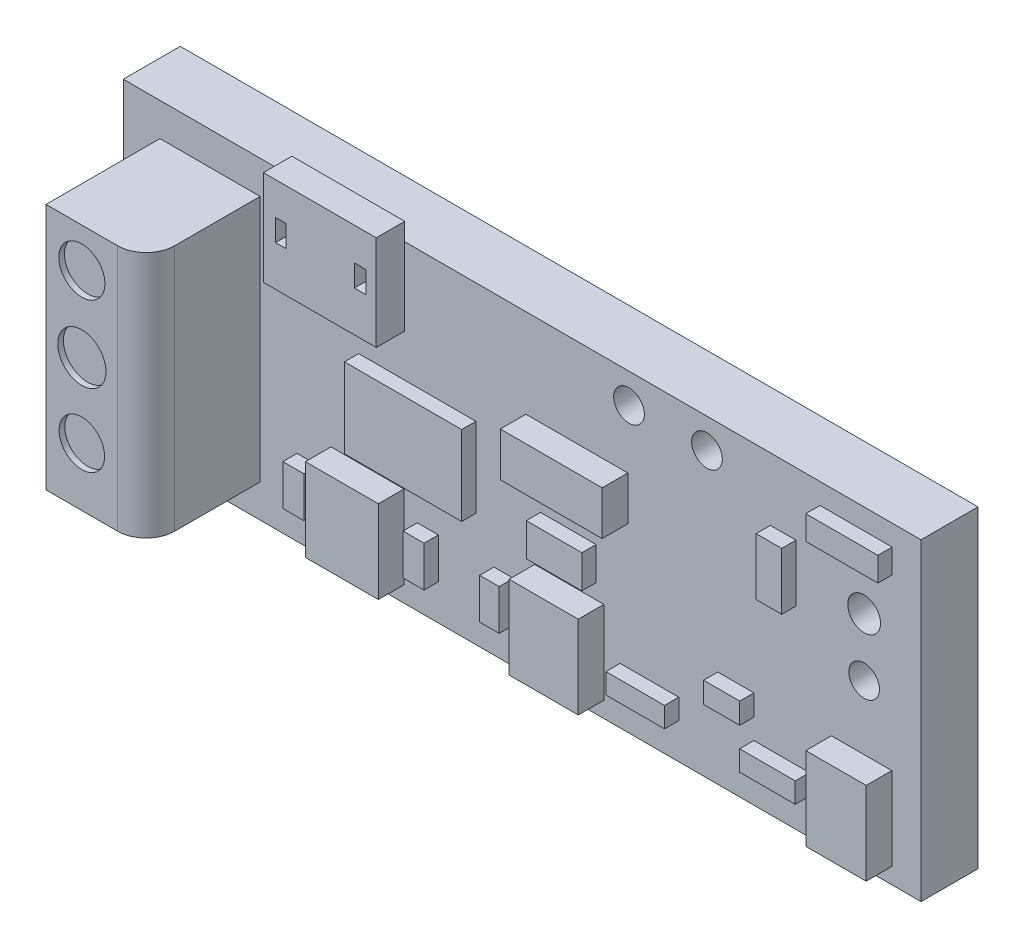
ISO-10303-21;
HEADER;
FILE_DESCRIPTION(('STEP AP214'),'2;1');
FILE_NAME('part.step','',(''),(''),'','','');
FILE_SCHEMA(('AUTOMOTIVE_DESIGN { 1 0 10303 214 1 1 1 1 }'));
ENDSEC;
DATA;
#1=APPLICATION_CONTEXT('core data for automotive mechanical design processes');
#2=APPLICATION_PROTOCOL_DEFINITION('international standard','automotive_design',2000,#1);
#3=PRODUCT_CONTEXT('',#1,'mechanical');
#4=PRODUCT('Part','Part','',(#3));
#5=PRODUCT_RELATED_PRODUCT_CATEGORY('part','',(#4));
#6=PRODUCT_DEFINITION_FORMATION('','',#4);
#7=PRODUCT_DEFINITION_CONTEXT('part definition',#1,'design');
#8=PRODUCT_DEFINITION('design','',#6,#7);
#9=PRODUCT_DEFINITION_SHAPE('','',#8);
#10=(LENGTH_UNIT() NAMED_UNIT(*) SI_UNIT(.MILLI.,.METRE.));
#11=(NAMED_UNIT(*) PLANE_ANGLE_UNIT() SI_UNIT($,.RADIAN.));
#12=(NAMED_UNIT(*) SI_UNIT($,.STERADIAN.) SOLID_ANGLE_UNIT());
#13=UNCERTAINTY_MEASURE_WITH_UNIT(LENGTH_MEASURE(1.E-05),#10,'distance_accuracy_value','');
#14=(GEOMETRIC_REPRESENTATION_CONTEXT(3) GLOBAL_UNCERTAINTY_ASSIGNED_CONTEXT((#13)) GLOBAL_UNIT_ASSIGNED_CONTEXT((#10,
#11,#12)) REPRESENTATION_CONTEXT('',''));
#15=CARTESIAN_POINT('',(0.,0.,0.));
#16=DIRECTION('',(0.,0.,1.));
#17=DIRECTION('',(1.,0.,0.));
#18=AXIS2_PLACEMENT_3D('',#15,#16,#17);
#19=CARTESIAN_POINT('',(0.,0.,0.2));
#20=DIRECTION('',(0.,0.,1.));
#21=DIRECTION('',(1.,0.,0.));
#22=AXIS2_PLACEMENT_3D('',#19,#20,#21);
#23=PLANE('',#22);
#24=CARTESIAN_POINT('',(-14.0512444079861,33.1380301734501,0.2));
#25=DIRECTION('',(0.,0.,1.));
#26=DIRECTION('',(1.,0.,0.));
#27=AXIS2_PLACEMENT_3D('',#24,#25,#26);
#28=CIRCLE('',#27,0.0538665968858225);
#29=CARTESIAN_POINT('',(-13.9973778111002,33.1380301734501,0.2));
#30=VERTEX_POINT('',#29);
#31=EDGE_CURVE('E1172',#30,#30,#28,.T.);
#32=ORIENTED_EDGE('',*,*,#31,.F.);
#33=EDGE_LOOP('',(#32));
#34=FACE_BOUND('',#33,.T.);
#35=CARTESIAN_POINT('',(-14.0512444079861,33.3410246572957,0.2));
#36=DIRECTION('',(0.,0.,1.));
#37=DIRECTION('',(1.,0.,0.));
#38=AXIS2_PLACEMENT_3D('',#35,#36,#37);
#39=CIRCLE('',#38,0.0575374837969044);
#40=CARTESIAN_POINT('',(-13.9937069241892,33.3410246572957,0.2));
#41=VERTEX_POINT('',#40);
#42=EDGE_CURVE('E1166',#41,#41,#39,.T.);
#43=ORIENTED_EDGE('',*,*,#42,.F.);
#44=EDGE_LOOP('',(#43));
#45=FACE_BOUND('',#44,.T.);
#46=CARTESIAN_POINT('',(-14.6028598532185,33.5616708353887,0.2));
#47=DIRECTION('',(0.,0.,1.));
#48=DIRECTION('',(1.,0.,0.));
#49=AXIS2_PLACEMENT_3D('',#46,#47,#48);
#50=CIRCLE('',#49,0.0538665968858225);
#51=CARTESIAN_POINT('',(-14.5489932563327,33.5616708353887,0.2));
#52=VERTEX_POINT('',#51);
#53=EDGE_CURVE('E1160',#52,#52,#50,.T.);
#54=ORIENTED_EDGE('',*,*,#53,.F.);
#55=EDGE_LOOP('',(#54));
#56=FACE_BOUND('',#55,.T.);
#57=CARTESIAN_POINT('',(-14.8764611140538,33.5616708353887,0.2));
#58=DIRECTION('',(0.,0.,1.));
#59=DIRECTION('',(1.,0.,0.));
#60=AXIS2_PLACEMENT_3D('',#57,#58,#59);
#61=CIRCLE('',#60,0.0538665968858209);
#62=CARTESIAN_POINT('',(-14.822594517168,33.5616708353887,0.2));
#63=VERTEX_POINT('',#62);
#64=EDGE_CURVE('E1154',#63,#63,#61,.T.);
#65=ORIENTED_EDGE('',*,*,#64,.F.);
#66=EDGE_LOOP('',(#65));
#67=FACE_BOUND('',#66,.T.);
#68=DIRECTION('',(1.,0.,0.));
#69=VECTOR('',#68,1.);
#70=CARTESIAN_POINT('',(-14.1659804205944,32.6217181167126,0.2));
#71=LINE('',#70,#69);
#72=CARTESIAN_POINT('',(-14.1659804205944,32.6217181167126,0.2));
#73=VERTEX_POINT('',#72);
#74=CARTESIAN_POINT('',(-13.9541600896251,32.6217181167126,0.2));
#75=VERTEX_POINT('',#74);
#76=EDGE_CURVE('E545',#73,#75,#71,.T.);
#77=ORIENTED_EDGE('',*,*,#76,.F.);
#78=DIRECTION('',(0.,-1.,0.));
#79=VECTOR('',#78,1.);
#80=CARTESIAN_POINT('',(-14.1659804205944,32.9129710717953,0.2));
#81=LINE('',#80,#79);
#82=CARTESIAN_POINT('',(-14.1659804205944,32.9129710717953,0.2));
#83=VERTEX_POINT('',#82);
#84=EDGE_CURVE('E542',#83,#73,#81,.T.);
#85=ORIENTED_EDGE('',*,*,#84,.F.);
#86=DIRECTION('',(-1.,0.,0.));
#87=VECTOR('',#86,1.);
#88=CARTESIAN_POINT('',(-14.1659804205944,32.9129710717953,0.2));
#89=LINE('',#88,#87);
#90=CARTESIAN_POINT('',(-13.9541600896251,32.9129710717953,0.2));
#91=VERTEX_POINT('',#90);
#92=EDGE_CURVE('E554',#91,#83,#89,.T.);
#93=ORIENTED_EDGE('',*,*,#92,.F.);
#94=DIRECTION('',(0.,1.,0.));
#95=VECTOR('',#94,1.);
#96=CARTESIAN_POINT('',(-13.9541600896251,32.9129710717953,0.2));
#97=LINE('',#96,#95);
#98=EDGE_CURVE('E562',#75,#91,#97,.T.);
#99=ORIENTED_EDGE('',*,*,#98,.F.);
#100=EDGE_LOOP('',(#77,#85,#93,#99));
#101=FACE_BOUND('',#100,.T.);
#102=DIRECTION('',(1.,0.,0.));
#103=VECTOR('',#102,1.);
#104=CARTESIAN_POINT('',(-15.9223239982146,32.6217181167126,0.2));
#105=LINE('',#104,#103);
#106=CARTESIAN_POINT('',(-15.9223239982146,32.6217181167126,0.2));
#107=VERTEX_POINT('',#106);
#108=CARTESIAN_POINT('',(-15.6663744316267,32.6217181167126,0.2));
#109=VERTEX_POINT('',#108);
#110=EDGE_CURVE('E616',#107,#109,#105,.T.);
#111=ORIENTED_EDGE('',*,*,#110,.F.);
#112=DIRECTION('',(0.,-1.,0.));
#113=VECTOR('',#112,1.);
#114=CARTESIAN_POINT('',(-15.9223239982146,32.9129710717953,0.2));
#115=LINE('',#114,#113);
#116=CARTESIAN_POINT('',(-15.9223239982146,32.9129710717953,0.2));
#117=VERTEX_POINT('',#116);
#118=EDGE_CURVE('E602',#117,#107,#115,.T.);
#119=ORIENTED_EDGE('',*,*,#118,.F.);
#120=DIRECTION('',(-1.,0.,0.));
#121=VECTOR('',#120,1.);
#122=CARTESIAN_POINT('',(-15.9223239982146,32.9129710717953,0.2));
#123=LINE('',#122,#121);
#124=CARTESIAN_POINT('',(-15.6663744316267,32.9129710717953,0.2));
#125=VERTEX_POINT('',#124);
#126=EDGE_CURVE('E607',#125,#117,#123,.T.);
#127=ORIENTED_EDGE('',*,*,#126,.F.);
#128=DIRECTION('',(0.,1.,0.));
#129=VECTOR('',#128,1.);
#130=CARTESIAN_POINT('',(-15.6663744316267,32.9129710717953,0.2));
#131=LINE('',#130,#129);
#132=EDGE_CURVE('E618',#109,#125,#131,.T.);
#133=ORIENTED_EDGE('',*,*,#132,.F.);
#134=EDGE_LOOP('',(#111,#119,#127,#133));
#135=FACE_BOUND('',#134,.T.);
#136=DIRECTION('',(1.,0.,0.));
#137=VECTOR('',#136,1.);
#138=CARTESIAN_POINT('',(-15.1871159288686,32.9653365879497,0.2));
#139=LINE('',#138,#137);
#140=CARTESIAN_POINT('',(-15.1871159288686,32.9653365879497,0.2));
#141=VERTEX_POINT('',#140);
#142=CARTESIAN_POINT('',(-14.9919658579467,32.9653365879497,0.2));
#143=VERTEX_POINT('',#142);
#144=EDGE_CURVE('E674',#141,#143,#139,.T.);
#145=ORIENTED_EDGE('',*,*,#144,.F.);
#146=DIRECTION('',(0.,-1.,0.));
#147=VECTOR('',#146,1.);
#148=CARTESIAN_POINT('',(-15.1871159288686,33.0813717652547,0.2));
#149=LINE('',#148,#147);
#150=CARTESIAN_POINT('',(-15.1871159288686,33.0813717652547,0.2));
#151=VERTEX_POINT('',#150);
#152=EDGE_CURVE('E660',#151,#141,#149,.T.);
#153=ORIENTED_EDGE('',*,*,#152,.F.);
#154=DIRECTION('',(-1.,0.,0.));
#155=VECTOR('',#154,1.);
#156=CARTESIAN_POINT('',(-15.1871159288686,33.0813717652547,0.2));
#157=LINE('',#156,#155);
#158=CARTESIAN_POINT('',(-14.9919658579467,33.0813717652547,0.2));
#159=VERTEX_POINT('',#158);
#160=EDGE_CURVE('E665',#159,#151,#157,.T.);
#161=ORIENTED_EDGE('',*,*,#160,.F.);
#162=DIRECTION('',(0.,1.,0.));
#163=VECTOR('',#162,1.);
#164=CARTESIAN_POINT('',(-14.9919658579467,33.0813717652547,0.2));
#165=LINE('',#164,#163);
#166=EDGE_CURVE('E676',#143,#159,#165,.T.);
#167=ORIENTED_EDGE('',*,*,#166,.F.);
#168=EDGE_LOOP('',(#145,#153,#161,#167));
#169=FACE_BOUND('',#168,.T.);
#170=DIRECTION('',(1.,0.,0.));
#171=VECTOR('',#170,1.);
#172=CARTESIAN_POINT('',(-14.380144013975,33.2448758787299,0.2));
#173=LINE('',#172,#171);
#174=CARTESIAN_POINT('',(-14.380144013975,33.2448758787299,0.2));
#175=VERTEX_POINT('',#174);
#176=CARTESIAN_POINT('',(-14.2904804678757,33.2448758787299,0.2));
#177=VERTEX_POINT('',#176);
#178=EDGE_CURVE('E732',#175,#177,#173,.T.);
#179=ORIENTED_EDGE('',*,*,#178,.F.);
#180=DIRECTION('',(0.,-1.,0.));
#181=VECTOR('',#180,1.);
#182=CARTESIAN_POINT('',(-14.380144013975,33.445300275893,0.2));
#183=LINE('',#182,#181);
#184=CARTESIAN_POINT('',(-14.380144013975,33.445300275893,0.2));
#185=VERTEX_POINT('',#184);
#186=EDGE_CURVE('E718',#185,#175,#183,.T.);
#187=ORIENTED_EDGE('',*,*,#186,.F.);
#188=DIRECTION('',(-1.,0.,0.));
#189=VECTOR('',#188,1.);
#190=CARTESIAN_POINT('',(-14.380144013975,33.445300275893,0.2));
#191=LINE('',#190,#189);
#192=CARTESIAN_POINT('',(-14.2904804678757,33.445300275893,0.2));
#193=VERTEX_POINT('',#192);
#194=EDGE_CURVE('E723',#193,#185,#191,.T.);
#195=ORIENTED_EDGE('',*,*,#194,.F.);
#196=DIRECTION('',(0.,1.,0.));
#197=VECTOR('',#196,1.);
#198=CARTESIAN_POINT('',(-14.2904804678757,33.445300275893,0.2));
#199=LINE('',#198,#197);
#200=EDGE_CURVE('E734',#177,#193,#199,.T.);
#201=ORIENTED_EDGE('',*,*,#200,.F.);
#202=EDGE_LOOP('',(#179,#187,#195,#201));
#203=FACE_BOUND('',#202,.T.);
#204=DIRECTION('',(1.,0.,0.));
#205=VECTOR('',#204,1.);
#206=CARTESIAN_POINT('',(-14.4381616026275,32.6910716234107,0.2));
#207=LINE('',#206,#205);
#208=CARTESIAN_POINT('',(-14.4381616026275,32.6910716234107,0.2));
#209=VERTEX_POINT('',#208);
#210=CARTESIAN_POINT('',(-14.2430115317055,32.6910716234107,0.2));
#211=VERTEX_POINT('',#210);
#212=EDGE_CURVE('E790',#209,#211,#207,.T.);
#213=ORIENTED_EDGE('',*,*,#212,.F.);
#214=DIRECTION('',(0.,-1.,0.));
#215=VECTOR('',#214,1.);
#216=CARTESIAN_POINT('',(-14.4381616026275,32.762275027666,0.2));
#217=LINE('',#216,#215);
#218=CARTESIAN_POINT('',(-14.4381616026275,32.762275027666,0.2));
#219=VERTEX_POINT('',#218);
#220=EDGE_CURVE('E776',#219,#209,#217,.T.);
#221=ORIENTED_EDGE('',*,*,#220,.F.);
#222=DIRECTION('',(-1.,0.,0.));
#223=VECTOR('',#222,1.);
#224=CARTESIAN_POINT('',(-14.4381616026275,32.762275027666,0.2));
#225=LINE('',#224,#223);
#226=CARTESIAN_POINT('',(-14.2430115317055,32.762275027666,0.2));
#227=VERTEX_POINT('',#226);
#228=EDGE_CURVE('E781',#227,#219,#225,.T.);
#229=ORIENTED_EDGE('',*,*,#228,.F.);
#230=DIRECTION('',(0.,1.,0.));
#231=VECTOR('',#230,1.);
#232=CARTESIAN_POINT('',(-14.2430115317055,32.762275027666,0.2));
#233=LINE('',#232,#231);
#234=EDGE_CURVE('E792',#211,#227,#233,.T.);
#235=ORIENTED_EDGE('',*,*,#234,.F.);
#236=EDGE_LOOP('',(#213,#221,#229,#235));
#237=FACE_BOUND('',#236,.T.);
#238=DIRECTION('',(1.,0.,0.));
#239=VECTOR('',#238,1.);
#240=CARTESIAN_POINT('',(-15.3506200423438,32.6910716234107,0.2));
#241=LINE('',#240,#239);
#242=CARTESIAN_POINT('',(-15.3506200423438,32.6910716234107,0.2));
#243=VERTEX_POINT('',#242);
#244=CARTESIAN_POINT('',(-15.2820538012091,32.6910716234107,0.2));
#245=VERTEX_POINT('',#244);
#246=EDGE_CURVE('E848',#243,#245,#241,.T.);
#247=ORIENTED_EDGE('',*,*,#246,.F.);
#248=DIRECTION('',(0.,-1.,0.));
#249=VECTOR('',#248,1.);
#250=CARTESIAN_POINT('',(-15.3506200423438,32.8334784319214,0.2));
#251=LINE('',#250,#249);
#252=CARTESIAN_POINT('',(-15.3506200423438,32.8334784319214,0.2));
#253=VERTEX_POINT('',#252);
#254=EDGE_CURVE('E834',#253,#243,#251,.T.);
#255=ORIENTED_EDGE('',*,*,#254,.F.);
#256=DIRECTION('',(-1.,0.,0.));
#257=VECTOR('',#256,1.);
#258=CARTESIAN_POINT('',(-15.3506200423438,32.8334784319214,0.2));
#259=LINE('',#258,#257);
#260=CARTESIAN_POINT('',(-15.2820538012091,32.8334784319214,0.2));
#261=VERTEX_POINT('',#260);
#262=EDGE_CURVE('E839',#261,#253,#259,.T.);
#263=ORIENTED_EDGE('',*,*,#262,.F.);
#264=DIRECTION('',(0.,1.,0.));
#265=VECTOR('',#264,1.);
#266=CARTESIAN_POINT('',(-15.2820538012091,32.8334784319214,0.2));
#267=LINE('',#266,#265);
#268=EDGE_CURVE('E850',#245,#261,#267,.T.);
#269=ORIENTED_EDGE('',*,*,#268,.F.);
#270=EDGE_LOOP('',(#247,#255,#263,#269));
#271=FACE_BOUND('',#270,.T.);
#272=DIRECTION('',(1.,0.,0.));
#273=VECTOR('',#272,1.);
#274=CARTESIAN_POINT('',(-16.0415567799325,32.6910716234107,0.2));
#275=LINE('',#274,#273);
#276=CARTESIAN_POINT('',(-16.0415567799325,32.6910716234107,0.2));
#277=VERTEX_POINT('',#276);
#278=CARTESIAN_POINT('',(-15.9677162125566,32.6910716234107,0.2));
#279=VERTEX_POINT('',#278);
#280=EDGE_CURVE('E906',#277,#279,#275,.T.);
#281=ORIENTED_EDGE('',*,*,#280,.F.);
#282=DIRECTION('',(0.,-1.,0.));
#283=VECTOR('',#282,1.);
#284=CARTESIAN_POINT('',(-16.0415567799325,32.8334784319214,0.2));
#285=LINE('',#284,#283);
#286=CARTESIAN_POINT('',(-16.0415567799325,32.8334784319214,0.2));
#287=VERTEX_POINT('',#286);
#288=EDGE_CURVE('E892',#287,#277,#285,.T.);
#289=ORIENTED_EDGE('',*,*,#288,.F.);
#290=DIRECTION('',(-1.,0.,0.));
#291=VECTOR('',#290,1.);
#292=CARTESIAN_POINT('',(-16.0415567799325,32.8334784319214,0.2));
#293=LINE('',#292,#291);
#294=CARTESIAN_POINT('',(-15.9677162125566,32.8334784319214,0.2));
#295=VERTEX_POINT('',#294);
#296=EDGE_CURVE('E897',#295,#287,#293,.T.);
#297=ORIENTED_EDGE('',*,*,#296,.F.);
#298=DIRECTION('',(0.,1.,0.));
#299=VECTOR('',#298,1.);
#300=CARTESIAN_POINT('',(-15.9677162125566,32.8334784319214,0.2));
#301=LINE('',#300,#299);
#302=EDGE_CURVE('E908',#279,#295,#301,.T.);
#303=ORIENTED_EDGE('',*,*,#302,.F.);
#304=EDGE_LOOP('',(#281,#289,#297,#303));
#305=FACE_BOUND('',#304,.T.);
#306=DIRECTION('',(-1.,0.,0.));
#307=VECTOR('',#306,1.);
#308=CARTESIAN_POINT('',(-16.5228142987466,33.5497721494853,0.2));
#309=LINE('',#308,#307);
#310=CARTESIAN_POINT('',(-16.1712760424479,33.5497721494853,0.2));
#311=VERTEX_POINT('',#310);
#312=CARTESIAN_POINT('',(-16.5228142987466,33.5497721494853,0.2));
#313=VERTEX_POINT('',#312);
#314=EDGE_CURVE('E1031',#311,#313,#309,.T.);
#315=ORIENTED_EDGE('',*,*,#314,.F.);
#316=DIRECTION('',(0.,1.,0.));
#317=VECTOR('',#316,1.);
#318=CARTESIAN_POINT('',(-16.1712760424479,33.5497721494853,0.2));
#319=LINE('',#318,#317);
#320=CARTESIAN_POINT('',(-16.1712760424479,32.6819406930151,0.2));
#321=VERTEX_POINT('',#320);
#322=EDGE_CURVE('E1019',#321,#311,#319,.T.);
#323=ORIENTED_EDGE('',*,*,#322,.F.);
#324=DIRECTION('',(1.,0.,0.));
#325=VECTOR('',#324,1.);
#326=CARTESIAN_POINT('',(-16.5228142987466,32.6819406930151,0.2));
#327=LINE('',#326,#325);
#328=CARTESIAN_POINT('',(-16.5228142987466,32.6819406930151,0.2));
#329=VERTEX_POINT('',#328);
#330=EDGE_CURVE('E1023',#329,#321,#327,.T.);
#331=ORIENTED_EDGE('',*,*,#330,.F.);
#332=DIRECTION('',(0.,-1.,0.));
#333=VECTOR('',#332,1.);
#334=CARTESIAN_POINT('',(-16.5228142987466,33.5497721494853,0.2));
#335=LINE('',#334,#333);
#336=EDGE_CURVE('E1033',#313,#329,#335,.T.);
#337=ORIENTED_EDGE('',*,*,#336,.F.);
#338=EDGE_LOOP('',(#315,#323,#331,#337));
#339=FACE_BOUND('',#338,.T.);
#340=DIRECTION('',(-1.,0.,0.));
#341=VECTOR('',#340,1.);
#342=CARTESIAN_POINT('',(-16.6515596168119,33.6658564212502,0.2));
#343=LINE('',#342,#341);
#344=CARTESIAN_POINT('',(-13.8515596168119,33.6658564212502,0.2));
#345=VERTEX_POINT('',#344);
#346=CARTESIAN_POINT('',(-15.66369307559,33.6658564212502,0.2));
#347=VERTEX_POINT('',#346);
#348=EDGE_CURVE('E1052',#345,#347,#343,.T.);
#349=ORIENTED_EDGE('',*,*,#348,.T.);
#350=DIRECTION('',(0.,1.,0.));
#351=VECTOR('',#350,1.);
#352=CARTESIAN_POINT('',(-15.66369307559,33.7278556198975,0.2));
#353=LINE('',#352,#351);
#354=CARTESIAN_POINT('',(-15.66369307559,33.3943332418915,0.2));
#355=VERTEX_POINT('',#354);
#356=EDGE_CURVE('E997',#355,#347,#353,.T.);
#357=ORIENTED_EDGE('',*,*,#356,.F.);
#358=DIRECTION('',(1.,0.,0.));
#359=VECTOR('',#358,1.);
#360=CARTESIAN_POINT('',(-16.0597508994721,33.3943332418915,0.2));
#361=LINE('',#360,#359);
#362=CARTESIAN_POINT('',(-16.0597508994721,33.3943332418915,0.2));
#363=VERTEX_POINT('',#362);
#364=EDGE_CURVE('E990',#363,#355,#361,.T.);
#365=ORIENTED_EDGE('',*,*,#364,.F.);
#366=DIRECTION('',(0.,-1.,0.));
#367=VECTOR('',#366,1.);
#368=CARTESIAN_POINT('',(-16.0597508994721,33.7278556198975,0.2));
#369=LINE('',#368,#367);
#370=CARTESIAN_POINT('',(-16.0597508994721,33.6658564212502,0.2));
#371=VERTEX_POINT('',#370);
#372=EDGE_CURVE('E1002',#371,#363,#369,.T.);
#373=ORIENTED_EDGE('',*,*,#372,.F.);
#374=CARTESIAN_POINT('',(-16.6515596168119,33.6658564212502,0.2));
#375=VERTEX_POINT('',#374);
#376=EDGE_CURVE('E1050',#371,#375,#343,.T.);
#377=ORIENTED_EDGE('',*,*,#376,.T.);
#378=DIRECTION('',(0.,-1.,0.));
#379=VECTOR('',#378,1.);
#380=CARTESIAN_POINT('',(-16.6515596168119,33.6658564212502,0.2));
#381=LINE('',#380,#379);
#382=CARTESIAN_POINT('',(-16.6515596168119,32.5658564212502,0.2));
#383=VERTEX_POINT('',#382);
#384=EDGE_CURVE('E1055',#375,#383,#381,.T.);
#385=ORIENTED_EDGE('',*,*,#384,.T.);
#386=DIRECTION('',(1.,0.,0.));
#387=VECTOR('',#386,1.);
#388=CARTESIAN_POINT('',(-16.6515596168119,32.5658564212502,0.2));
#389=LINE('',#388,#387);
#390=CARTESIAN_POINT('',(-13.8515596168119,32.5658564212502,0.2));
#391=VERTEX_POINT('',#390);
#392=EDGE_CURVE('E1058',#383,#391,#389,.T.);
#393=ORIENTED_EDGE('',*,*,#392,.T.);
#394=DIRECTION('',(0.,1.,0.));
#395=VECTOR('',#394,1.);
#396=CARTESIAN_POINT('',(-13.8515596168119,33.6658564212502,0.2));
#397=LINE('',#396,#395);
#398=EDGE_CURVE('E1047',#391,#345,#397,.T.);
#399=ORIENTED_EDGE('',*,*,#398,.T.);
#400=EDGE_LOOP('',(#349,#357,#365,#373,#377,#385,#393,#399));
#401=FACE_BOUND('',#400,.T.);
#402=DIRECTION('',(1.,0.,0.));
#403=VECTOR('',#402,1.);
#404=CARTESIAN_POINT('',(-15.6196106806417,32.6910716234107,0.2));
#405=LINE('',#404,#403);
#406=CARTESIAN_POINT('',(-15.6196106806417,32.6910716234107,0.2));
#407=VERTEX_POINT('',#406);
#408=CARTESIAN_POINT('',(-15.5457701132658,32.6910716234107,0.2));
#409=VERTEX_POINT('',#408);
#410=EDGE_CURVE('E877',#407,#409,#405,.T.);
#411=ORIENTED_EDGE('',*,*,#410,.F.);
#412=DIRECTION('',(0.,-1.,0.));
#413=VECTOR('',#412,1.);
#414=CARTESIAN_POINT('',(-15.6196106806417,32.8334784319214,0.2));
#415=LINE('',#414,#413);
#416=CARTESIAN_POINT('',(-15.6196106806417,32.8334784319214,0.2));
#417=VERTEX_POINT('',#416);
#418=EDGE_CURVE('E863',#417,#407,#415,.T.);
#419=ORIENTED_EDGE('',*,*,#418,.F.);
#420=DIRECTION('',(-1.,0.,0.));
#421=VECTOR('',#420,1.);
#422=CARTESIAN_POINT('',(-15.6196106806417,32.8334784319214,0.2));
#423=LINE('',#422,#421);
#424=CARTESIAN_POINT('',(-15.5457701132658,32.8334784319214,0.2));
#425=VERTEX_POINT('',#424);
#426=EDGE_CURVE('E868',#425,#417,#423,.T.);
#427=ORIENTED_EDGE('',*,*,#426,.F.);
#428=DIRECTION('',(0.,1.,0.));
#429=VECTOR('',#428,1.);
#430=CARTESIAN_POINT('',(-15.5457701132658,32.8334784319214,0.2));
#431=LINE('',#430,#429);
#432=EDGE_CURVE('E879',#409,#425,#431,.T.);
#433=ORIENTED_EDGE('',*,*,#432,.F.);
#434=EDGE_LOOP('',(#411,#419,#427,#433));
#435=FACE_BOUND('',#434,.T.);
#436=DIRECTION('',(1.,0.,0.));
#437=VECTOR('',#436,1.);
#438=CARTESIAN_POINT('',(-14.9075766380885,32.6910716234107,0.2));
#439=LINE('',#438,#437);
#440=CARTESIAN_POINT('',(-14.9075766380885,32.6910716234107,0.2));
#441=VERTEX_POINT('',#440);
#442=CARTESIAN_POINT('',(-14.7018779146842,32.6910716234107,0.2));
#443=VERTEX_POINT('',#442);
#444=EDGE_CURVE('E819',#441,#443,#439,.T.);
#445=ORIENTED_EDGE('',*,*,#444,.F.);
#446=DIRECTION('',(0.,-1.,0.));
#447=VECTOR('',#446,1.);
#448=CARTESIAN_POINT('',(-14.9075766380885,32.762275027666,0.2));
#449=LINE('',#448,#447);
#450=CARTESIAN_POINT('',(-14.9075766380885,32.762275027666,0.2));
#451=VERTEX_POINT('',#450);
#452=EDGE_CURVE('E805',#451,#441,#449,.T.);
#453=ORIENTED_EDGE('',*,*,#452,.F.);
#454=DIRECTION('',(-1.,0.,0.));
#455=VECTOR('',#454,1.);
#456=CARTESIAN_POINT('',(-14.9075766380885,32.762275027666,0.2));
#457=LINE('',#456,#455);
#458=CARTESIAN_POINT('',(-14.7018779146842,32.762275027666,0.2));
#459=VERTEX_POINT('',#458);
#460=EDGE_CURVE('E810',#459,#451,#457,.T.);
#461=ORIENTED_EDGE('',*,*,#460,.F.);
#462=DIRECTION('',(0.,1.,0.));
#463=VECTOR('',#462,1.);
#464=CARTESIAN_POINT('',(-14.7018779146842,32.762275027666,0.2));
#465=LINE('',#464,#463);
#466=EDGE_CURVE('E821',#443,#459,#465,.T.);
#467=ORIENTED_EDGE('',*,*,#466,.F.);
#468=EDGE_LOOP('',(#445,#453,#461,#467));
#469=FACE_BOUND('',#468,.T.);
#470=DIRECTION('',(1.,0.,0.));
#471=VECTOR('',#470,1.);
#472=CARTESIAN_POINT('',(-14.5647454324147,32.8334784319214,0.2));
#473=LINE('',#472,#471);
#474=CARTESIAN_POINT('',(-14.5647454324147,32.8334784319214,0.2));
#475=VERTEX_POINT('',#474);
#476=CARTESIAN_POINT('',(-14.4381616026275,32.8334784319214,0.2));
#477=VERTEX_POINT('',#476);
#478=EDGE_CURVE('E761',#475,#477,#473,.T.);
#479=ORIENTED_EDGE('',*,*,#478,.F.);
#480=DIRECTION('',(0.,-1.,0.));
#481=VECTOR('',#480,1.);
#482=CARTESIAN_POINT('',(-14.5647454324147,32.9073189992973,0.2));
#483=LINE('',#482,#481);
#484=CARTESIAN_POINT('',(-14.5647454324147,32.9073189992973,0.2));
#485=VERTEX_POINT('',#484);
#486=EDGE_CURVE('E747',#485,#475,#483,.T.);
#487=ORIENTED_EDGE('',*,*,#486,.F.);
#488=DIRECTION('',(-1.,0.,0.));
#489=VECTOR('',#488,1.);
#490=CARTESIAN_POINT('',(-14.5647454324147,32.9073189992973,0.2));
#491=LINE('',#490,#489);
#492=CARTESIAN_POINT('',(-14.4381616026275,32.9073189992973,0.2));
#493=VERTEX_POINT('',#492);
#494=EDGE_CURVE('E752',#493,#485,#491,.T.);
#495=ORIENTED_EDGE('',*,*,#494,.F.);
#496=DIRECTION('',(0.,1.,0.));
#497=VECTOR('',#496,1.);
#498=CARTESIAN_POINT('',(-14.4381616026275,32.9073189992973,0.2));
#499=LINE('',#498,#497);
#500=EDGE_CURVE('E763',#477,#493,#499,.T.);
#501=ORIENTED_EDGE('',*,*,#500,.F.);
#502=EDGE_LOOP('',(#479,#487,#495,#501));
#503=FACE_BOUND('',#502,.T.);
#504=DIRECTION('',(1.,0.,0.));
#505=VECTOR('',#504,1.);
#506=CARTESIAN_POINT('',(-14.2060912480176,33.5085921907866,0.2));
#507=LINE('',#506,#505);
#508=CARTESIAN_POINT('',(-14.2060912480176,33.5085921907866,0.2));
#509=VERTEX_POINT('',#508);
#510=CARTESIAN_POINT('',(-13.9529235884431,33.5085921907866,0.2));
#511=VERTEX_POINT('',#510);
#512=EDGE_CURVE('E703',#509,#511,#507,.T.);
#513=ORIENTED_EDGE('',*,*,#512,.F.);
#514=DIRECTION('',(0.,-1.,0.));
#515=VECTOR('',#514,1.);
#516=CARTESIAN_POINT('',(-14.2060912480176,33.5929814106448,0.2));
#517=LINE('',#516,#515);
#518=CARTESIAN_POINT('',(-14.2060912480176,33.5929814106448,0.2));
#519=VERTEX_POINT('',#518);
#520=EDGE_CURVE('E689',#519,#509,#517,.T.);
#521=ORIENTED_EDGE('',*,*,#520,.F.);
#522=DIRECTION('',(-1.,0.,0.));
#523=VECTOR('',#522,1.);
#524=CARTESIAN_POINT('',(-14.2060912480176,33.5929814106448,0.2));
#525=LINE('',#524,#523);
#526=CARTESIAN_POINT('',(-13.9529235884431,33.5929814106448,0.2));
#527=VERTEX_POINT('',#526);
#528=EDGE_CURVE('E694',#527,#519,#525,.T.);
#529=ORIENTED_EDGE('',*,*,#528,.F.);
#530=DIRECTION('',(0.,1.,0.));
#531=VECTOR('',#530,1.);
#532=CARTESIAN_POINT('',(-13.9529235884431,33.5929814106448,0.2));
#533=LINE('',#532,#531);
#534=EDGE_CURVE('E705',#511,#527,#533,.T.);
#535=ORIENTED_EDGE('',*,*,#534,.F.);
#536=EDGE_LOOP('',(#513,#521,#529,#535));
#537=FACE_BOUND('',#536,.T.);
#538=DIRECTION('',(1.,0.,0.));
#539=VECTOR('',#538,1.);
#540=CARTESIAN_POINT('',(-15.8253094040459,32.9653365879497,0.2));
#541=LINE('',#540,#539);
#542=CARTESIAN_POINT('',(-15.8253094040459,32.9653365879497,0.2));
#543=VERTEX_POINT('',#542);
#544=CARTESIAN_POINT('',(-15.4139119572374,32.9653365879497,0.2));
#545=VERTEX_POINT('',#544);
#546=EDGE_CURVE('E645',#543,#545,#541,.T.);
#547=ORIENTED_EDGE('',*,*,#546,.F.);
#548=DIRECTION('',(0.,-1.,0.));
#549=VECTOR('',#548,1.);
#550=CARTESIAN_POINT('',(-15.8253094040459,33.2448758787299,0.2));
#551=LINE('',#550,#549);
#552=CARTESIAN_POINT('',(-15.8253094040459,33.2448758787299,0.2));
#553=VERTEX_POINT('',#552);
#554=EDGE_CURVE('E631',#553,#543,#551,.T.);
#555=ORIENTED_EDGE('',*,*,#554,.F.);
#556=DIRECTION('',(-1.,0.,0.));
#557=VECTOR('',#556,1.);
#558=CARTESIAN_POINT('',(-15.8253094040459,33.2448758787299,0.2));
#559=LINE('',#558,#557);
#560=CARTESIAN_POINT('',(-15.4139119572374,33.2448758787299,0.2));
#561=VERTEX_POINT('',#560);
#562=EDGE_CURVE('E636',#561,#553,#559,.T.);
#563=ORIENTED_EDGE('',*,*,#562,.F.);
#564=DIRECTION('',(0.,1.,0.));
#565=VECTOR('',#564,1.);
#566=CARTESIAN_POINT('',(-15.4139119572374,33.2448758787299,0.2));
#567=LINE('',#566,#565);
#568=EDGE_CURVE('E647',#545,#561,#567,.T.);
#569=ORIENTED_EDGE('',*,*,#568,.F.);
#570=EDGE_LOOP('',(#547,#555,#563,#569));
#571=FACE_BOUND('',#570,.T.);
#572=DIRECTION('',(1.,0.,0.));
#573=VECTOR('',#572,1.);
#574=CARTESIAN_POINT('',(-15.2074303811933,32.6217181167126,0.2));
#575=LINE('',#574,#573);
#576=CARTESIAN_POINT('',(-15.2074303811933,32.6217181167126,0.2));
#577=VERTEX_POINT('',#576);
#578=CARTESIAN_POINT('',(-14.964719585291,32.6217181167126,0.2));
#579=VERTEX_POINT('',#578);
#580=EDGE_CURVE('E587',#577,#579,#575,.T.);
#581=ORIENTED_EDGE('',*,*,#580,.F.);
#582=DIRECTION('',(0.,-1.,0.));
#583=VECTOR('',#582,1.);
#584=CARTESIAN_POINT('',(-15.2074303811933,32.9129710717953,0.2));
#585=LINE('',#584,#583);
#586=CARTESIAN_POINT('',(-15.2074303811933,32.9129710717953,0.2));
#587=VERTEX_POINT('',#586);
#588=EDGE_CURVE('E573',#587,#577,#585,.T.);
#589=ORIENTED_EDGE('',*,*,#588,.F.);
#590=DIRECTION('',(-1.,0.,0.));
#591=VECTOR('',#590,1.);
#592=CARTESIAN_POINT('',(-15.2074303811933,32.9129710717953,0.2));
#593=LINE('',#592,#591);
#594=CARTESIAN_POINT('',(-14.964719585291,32.9129710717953,0.2));
#595=VERTEX_POINT('',#594);
#596=EDGE_CURVE('E578',#595,#587,#593,.T.);
#597=ORIENTED_EDGE('',*,*,#596,.F.);
#598=DIRECTION('',(0.,1.,0.));
#599=VECTOR('',#598,1.);
#600=CARTESIAN_POINT('',(-14.964719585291,32.9129710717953,0.2));
#601=LINE('',#600,#599);
#602=EDGE_CURVE('E589',#579,#595,#601,.T.);
#603=ORIENTED_EDGE('',*,*,#602,.F.);
#604=EDGE_LOOP('',(#581,#589,#597,#603));
#605=FACE_BOUND('',#604,.T.);
#606=DIRECTION('',(1.,0.,0.));
#607=VECTOR('',#606,1.);
#608=CARTESIAN_POINT('',(-15.2383208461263,33.1998111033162,0.2));
#609=LINE('',#608,#607);
#610=CARTESIAN_POINT('',(-15.2383208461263,33.1998111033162,0.2));
#611=VERTEX_POINT('',#610);
#612=CARTESIAN_POINT('',(-14.8808740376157,33.1998111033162,0.2));
#613=VERTEX_POINT('',#612);
#614=EDGE_CURVE('E1141',#611,#613,#609,.T.);
#615=ORIENTED_EDGE('',*,*,#614,.F.);
#616=DIRECTION('',(0.,-1.,0.));
#617=VECTOR('',#616,1.);
#618=CARTESIAN_POINT('',(-15.2383208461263,33.3542634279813,0.2));
#619=LINE('',#618,#617);
#620=CARTESIAN_POINT('',(-15.2383208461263,33.3542634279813,0.2));
#621=VERTEX_POINT('',#620);
#622=EDGE_CURVE('E540',#621,#611,#619,.T.);
#623=ORIENTED_EDGE('',*,*,#622,.F.);
#624=DIRECTION('',(-1.,0.,0.));
#625=VECTOR('',#624,1.);
#626=CARTESIAN_POINT('',(-15.2383208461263,33.3542634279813,0.2));
#627=LINE('',#626,#625);
#628=CARTESIAN_POINT('',(-14.8808740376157,33.3542634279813,0.2));
#629=VERTEX_POINT('',#628);
#630=EDGE_CURVE('E536',#629,#621,#627,.T.);
#631=ORIENTED_EDGE('',*,*,#630,.F.);
#632=DIRECTION('',(0.,1.,0.));
#633=VECTOR('',#632,1.);
#634=CARTESIAN_POINT('',(-14.8808740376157,33.3542634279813,0.2));
#635=LINE('',#634,#633);
#636=EDGE_CURVE('E1143',#613,#629,#635,.T.);
#637=ORIENTED_EDGE('',*,*,#636,.F.);
#638=EDGE_LOOP('',(#615,#623,#631,#637));
#639=FACE_BOUND('',#638,.T.);
#640=ADVANCED_FACE('F32',(#34,#45,#56,#67,#101,#135,#169,#203,#237,#271,#305,#339,#401,#435,
#469,#503,#537,#571,#605,#639),#23,.T.);
#641=CARTESIAN_POINT('',(-13.8515596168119,33.6658564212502,0.2));
#642=DIRECTION('',(-1.,0.,0.));
#643=DIRECTION('',(0.,0.,1.));
#644=AXIS2_PLACEMENT_3D('',#641,#642,#643);
#645=PLANE('',#644);
#646=DIRECTION('',(0.,1.,0.));
#647=VECTOR('',#646,1.);
#648=CARTESIAN_POINT('',(-13.8515596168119,33.6658564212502,0.));
#649=LINE('',#648,#647);
#650=CARTESIAN_POINT('',(-13.8515596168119,32.5658564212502,0.));
#651=VERTEX_POINT('',#650);
#652=CARTESIAN_POINT('',(-13.8515596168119,33.6658564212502,0.));
#653=VERTEX_POINT('',#652);
#654=EDGE_CURVE('E1046',#651,#653,#649,.T.);
#655=ORIENTED_EDGE('',*,*,#654,.T.);
#656=DIRECTION('',(0.,0.,-1.));
#657=VECTOR('',#656,1.);
#658=CARTESIAN_POINT('',(-13.8515596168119,33.6658564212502,0.2));
#659=LINE('',#658,#657);
#660=EDGE_CURVE('E1076',#345,#653,#659,.T.);
#661=ORIENTED_EDGE('',*,*,#660,.F.);
#662=ORIENTED_EDGE('',*,*,#398,.F.);
#663=DIRECTION('',(0.,0.,-1.));
#664=VECTOR('',#663,1.);
#665=CARTESIAN_POINT('',(-13.8515596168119,32.5658564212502,0.2));
#666=LINE('',#665,#664);
#667=EDGE_CURVE('E1060',#391,#651,#666,.T.);
#668=ORIENTED_EDGE('',*,*,#667,.T.);
#669=EDGE_LOOP('',(#655,#661,#662,#668));
#670=FACE_BOUND('',#669,.T.);
#671=ADVANCED_FACE('F1111',(#670),#645,.F.);
#672=CARTESIAN_POINT('',(-16.6515596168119,33.6658564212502,0.2));
#673=DIRECTION('',(0.,-1.,0.));
#674=DIRECTION('',(0.,0.,-1.));
#675=AXIS2_PLACEMENT_3D('',#672,#673,#674);
#676=PLANE('',#675);
#677=DIRECTION('',(-1.,0.,0.));
#678=VECTOR('',#677,1.);
#679=CARTESIAN_POINT('',(-16.6515596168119,33.6658564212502,0.));
#680=LINE('',#679,#678);
#681=CARTESIAN_POINT('',(-16.6515596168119,33.6658564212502,0.));
#682=VERTEX_POINT('',#681);
#683=EDGE_CURVE('E1063',#653,#682,#680,.T.);
#684=ORIENTED_EDGE('',*,*,#683,.T.);
#685=DIRECTION('',(0.,0.,-1.));
#686=VECTOR('',#685,1.);
#687=CARTESIAN_POINT('',(-16.6515596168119,33.6658564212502,0.2));
#688=LINE('',#687,#686);
#689=EDGE_CURVE('E1073',#375,#682,#688,.T.);
#690=ORIENTED_EDGE('',*,*,#689,.F.);
#691=ORIENTED_EDGE('',*,*,#376,.F.);
#692=EDGE_CURVE('E1056',#347,#371,#343,.T.);
#693=ORIENTED_EDGE('',*,*,#692,.F.);
#694=ORIENTED_EDGE('',*,*,#348,.F.);
#695=ORIENTED_EDGE('',*,*,#660,.T.);
#696=EDGE_LOOP('',(#684,#690,#691,#693,#694,#695));
#697=FACE_BOUND('',#696,.T.);
#698=ADVANCED_FACE('F1597',(#697),#676,.F.);
#699=CARTESIAN_POINT('',(-16.6515596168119,33.6658564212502,0.2));
#700=DIRECTION('',(1.,0.,0.));
#701=DIRECTION('',(0.,0.,-1.));
#702=AXIS2_PLACEMENT_3D('',#699,#700,#701);
#703=PLANE('',#702);
#704=DIRECTION('',(0.,-1.,0.));
#705=VECTOR('',#704,1.);
#706=CARTESIAN_POINT('',(-16.6515596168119,33.6658564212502,0.));
#707=LINE('',#706,#705);
#708=CARTESIAN_POINT('',(-16.6515596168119,32.5658564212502,0.));
#709=VERTEX_POINT('',#708);
#710=EDGE_CURVE('E1065',#682,#709,#707,.T.);
#711=ORIENTED_EDGE('',*,*,#710,.T.);
#712=DIRECTION('',(0.,0.,-1.));
#713=VECTOR('',#712,1.);
#714=CARTESIAN_POINT('',(-16.6515596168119,32.5658564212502,0.2));
#715=LINE('',#714,#713);
#716=EDGE_CURVE('E1070',#383,#709,#715,.T.);
#717=ORIENTED_EDGE('',*,*,#716,.F.);
#718=ORIENTED_EDGE('',*,*,#384,.F.);
#719=ORIENTED_EDGE('',*,*,#689,.T.);
#720=EDGE_LOOP('',(#711,#717,#718,#719));
#721=FACE_BOUND('',#720,.T.);
#722=ADVANCED_FACE('F1593',(#721),#703,.F.);
#723=CARTESIAN_POINT('',(-16.6515596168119,32.5658564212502,0.2));
#724=DIRECTION('',(0.,1.,0.));
#725=DIRECTION('',(0.,0.,1.));
#726=AXIS2_PLACEMENT_3D('',#723,#724,#725);
#727=PLANE('',#726);
#728=DIRECTION('',(1.,0.,0.));
#729=VECTOR('',#728,1.);
#730=CARTESIAN_POINT('',(-16.6515596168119,32.5658564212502,0.));
#731=LINE('',#730,#729);
#732=EDGE_CURVE('E1051',#709,#651,#731,.T.);
#733=ORIENTED_EDGE('',*,*,#732,.T.);
#734=ORIENTED_EDGE('',*,*,#667,.F.);
#735=ORIENTED_EDGE('',*,*,#392,.F.);
#736=ORIENTED_EDGE('',*,*,#716,.T.);
#737=EDGE_LOOP('',(#733,#734,#735,#736));
#738=FACE_BOUND('',#737,.T.);
#739=ADVANCED_FACE('F1589',(#738),#727,.F.);
#740=CARTESIAN_POINT('',(0.,0.,0.));
#741=DIRECTION('',(0.,0.,1.));
#742=DIRECTION('',(1.,0.,0.));
#743=AXIS2_PLACEMENT_3D('',#740,#741,#742);
#744=PLANE('',#743);
#745=CARTESIAN_POINT('',(-14.0512444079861,33.1380301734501,0.));
#746=DIRECTION('',(0.,0.,1.));
#747=DIRECTION('',(1.,0.,0.));
#748=AXIS2_PLACEMENT_3D('',#745,#746,#747);
#749=CIRCLE('',#748,0.0538665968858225);
#750=CARTESIAN_POINT('',(-13.9973778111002,33.1380301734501,0.));
#751=VERTEX_POINT('',#750);
#752=EDGE_CURVE('E1169',#751,#751,#749,.T.);
#753=ORIENTED_EDGE('',*,*,#752,.T.);
#754=EDGE_LOOP('',(#753));
#755=FACE_BOUND('',#754,.T.);
#756=CARTESIAN_POINT('',(-14.0512444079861,33.3410246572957,0.));
#757=DIRECTION('',(0.,0.,1.));
#758=DIRECTION('',(1.,0.,0.));
#759=AXIS2_PLACEMENT_3D('',#756,#757,#758);
#760=CIRCLE('',#759,0.0575374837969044);
#761=CARTESIAN_POINT('',(-13.9937069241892,33.3410246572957,0.));
#762=VERTEX_POINT('',#761);
#763=EDGE_CURVE('E1163',#762,#762,#760,.T.);
#764=ORIENTED_EDGE('',*,*,#763,.T.);
#765=EDGE_LOOP('',(#764));
#766=FACE_BOUND('',#765,.T.);
#767=CARTESIAN_POINT('',(-14.6028598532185,33.5616708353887,0.));
#768=DIRECTION('',(0.,0.,1.));
#769=DIRECTION('',(1.,0.,0.));
#770=AXIS2_PLACEMENT_3D('',#767,#768,#769);
#771=CIRCLE('',#770,0.0538665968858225);
#772=CARTESIAN_POINT('',(-14.5489932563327,33.5616708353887,0.));
#773=VERTEX_POINT('',#772);
#774=EDGE_CURVE('E1157',#773,#773,#771,.T.);
#775=ORIENTED_EDGE('',*,*,#774,.T.);
#776=EDGE_LOOP('',(#775));
#777=FACE_BOUND('',#776,.T.);
#778=CARTESIAN_POINT('',(-14.8764611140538,33.5616708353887,0.));
#779=DIRECTION('',(0.,0.,1.));
#780=DIRECTION('',(1.,0.,0.));
#781=AXIS2_PLACEMENT_3D('',#778,#779,#780);
#782=CIRCLE('',#781,0.0538665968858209);
#783=CARTESIAN_POINT('',(-14.822594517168,33.5616708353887,0.));
#784=VERTEX_POINT('',#783);
#785=EDGE_CURVE('E1146',#784,#784,#782,.T.);
#786=ORIENTED_EDGE('',*,*,#785,.T.);
#787=EDGE_LOOP('',(#786));
#788=FACE_BOUND('',#787,.T.);
#789=ORIENTED_EDGE('',*,*,#654,.F.);
#790=ORIENTED_EDGE('',*,*,#732,.F.);
#791=ORIENTED_EDGE('',*,*,#710,.F.);
#792=ORIENTED_EDGE('',*,*,#683,.F.);
#793=EDGE_LOOP('',(#789,#790,#791,#792));
#794=FACE_BOUND('',#793,.T.);
#795=ADVANCED_FACE('F1585',(#755,#766,#777,#788,#794),#744,.F.);
#796=CARTESIAN_POINT('',(-16.1712760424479,33.5497721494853,0.6));
#797=DIRECTION('',(-1.,0.,0.));
#798=DIRECTION('',(0.,0.,1.));
#799=AXIS2_PLACEMENT_3D('',#796,#797,#798);
#800=PLANE('',#799);
#801=DIRECTION('',(0.,0.,-1.));
#802=VECTOR('',#801,1.);
#803=CARTESIAN_POINT('',(-16.1712760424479,33.5497721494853,0.6));
#804=LINE('',#803,#802);
#805=CARTESIAN_POINT('',(-16.1712760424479,33.5497721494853,0.5));
#806=VERTEX_POINT('',#805);
#807=EDGE_CURVE('E1044',#806,#311,#804,.T.);
#808=ORIENTED_EDGE('',*,*,#807,.F.);
#809=DIRECTION('',(0.,1.,0.));
#810=VECTOR('',#809,1.);
#811=CARTESIAN_POINT('',(-16.1712760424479,32.6819406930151,0.5));
#812=LINE('',#811,#810);
#813=CARTESIAN_POINT('',(-16.1712760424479,32.6819406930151,0.5));
#814=VERTEX_POINT('',#813);
#815=EDGE_CURVE('E40',#806,#814,#812,.F.);
#816=ORIENTED_EDGE('',*,*,#815,.T.);
#817=DIRECTION('',(0.,0.,-1.));
#818=VECTOR('',#817,1.);
#819=CARTESIAN_POINT('',(-16.1712760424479,32.6819406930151,0.6));
#820=LINE('',#819,#818);
#821=EDGE_CURVE('E1028',#814,#321,#820,.T.);
#822=ORIENTED_EDGE('',*,*,#821,.T.);
#823=ORIENTED_EDGE('',*,*,#322,.T.);
#824=EDGE_LOOP('',(#808,#816,#822,#823));
#825=FACE_BOUND('',#824,.T.);
#826=ADVANCED_FACE('F1087',(#825),#800,.F.);
#827=CARTESIAN_POINT('',(-16.5228142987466,33.5497721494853,0.6));
#828=DIRECTION('',(0.,-1.,0.));
#829=DIRECTION('',(0.,0.,-1.));
#830=AXIS2_PLACEMENT_3D('',#827,#828,#829);
#831=PLANE('',#830);
#832=DIRECTION('',(-1.,0.,0.));
#833=VECTOR('',#832,1.);
#834=CARTESIAN_POINT('',(-16.5228142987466,33.5497721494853,0.6));
#835=LINE('',#834,#833);
#836=CARTESIAN_POINT('',(-16.2712760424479,33.5497721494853,0.6));
#837=VERTEX_POINT('',#836);
#838=CARTESIAN_POINT('',(-16.5228142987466,33.5497721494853,0.6));
#839=VERTEX_POINT('',#838);
#840=EDGE_CURVE('E1020',#837,#839,#835,.T.);
#841=ORIENTED_EDGE('',*,*,#840,.F.);
#842=CARTESIAN_POINT('',(-16.2712760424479,33.5497721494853,0.5));
#843=DIRECTION('',(0.,-1.,0.));
#844=DIRECTION('',(0.,0.,-1.));
#845=AXIS2_PLACEMENT_3D('',#842,#843,#844);
#846=CIRCLE('',#845,0.1);
#847=EDGE_CURVE('E1082',#837,#806,#846,.F.);
#848=ORIENTED_EDGE('',*,*,#847,.T.);
#849=ORIENTED_EDGE('',*,*,#807,.T.);
#850=ORIENTED_EDGE('',*,*,#314,.T.);
#851=DIRECTION('',(0.,0.,-1.));
#852=VECTOR('',#851,1.);
#853=CARTESIAN_POINT('',(-16.5228142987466,33.5497721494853,0.6));
#854=LINE('',#853,#852);
#855=EDGE_CURVE('E1041',#839,#313,#854,.T.);
#856=ORIENTED_EDGE('',*,*,#855,.F.);
#857=EDGE_LOOP('',(#841,#848,#849,#850,#856));
#858=FACE_BOUND('',#857,.T.);
#859=ADVANCED_FACE('F1101',(#858),#831,.F.);
#860=CARTESIAN_POINT('',(-16.5228142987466,33.5497721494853,0.6));
#861=DIRECTION('',(1.,0.,0.));
#862=DIRECTION('',(0.,0.,-1.));
#863=AXIS2_PLACEMENT_3D('',#860,#861,#862);
#864=PLANE('',#863);
#865=ORIENTED_EDGE('',*,*,#336,.T.);
#866=DIRECTION('',(0.,0.,-1.));
#867=VECTOR('',#866,1.);
#868=CARTESIAN_POINT('',(-16.5228142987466,32.6819406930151,0.6));
#869=LINE('',#868,#867);
#870=CARTESIAN_POINT('',(-16.5228142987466,32.6819406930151,0.6));
#871=VERTEX_POINT('',#870);
#872=EDGE_CURVE('E1039',#871,#329,#869,.T.);
#873=ORIENTED_EDGE('',*,*,#872,.F.);
#874=DIRECTION('',(0.,-1.,0.));
#875=VECTOR('',#874,1.);
#876=CARTESIAN_POINT('',(-16.5228142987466,33.5497721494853,0.6));
#877=LINE('',#876,#875);
#878=EDGE_CURVE('E1022',#839,#871,#877,.T.);
#879=ORIENTED_EDGE('',*,*,#878,.F.);
#880=ORIENTED_EDGE('',*,*,#855,.T.);
#881=EDGE_LOOP('',(#865,#873,#879,#880));
#882=FACE_BOUND('',#881,.T.);
#883=ADVANCED_FACE('F1107',(#882),#864,.F.);
#884=CARTESIAN_POINT('',(-16.5228142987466,32.6819406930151,0.6));
#885=DIRECTION('',(0.,1.,0.));
#886=DIRECTION('',(0.,0.,1.));
#887=AXIS2_PLACEMENT_3D('',#884,#885,#886);
#888=PLANE('',#887);
#889=ORIENTED_EDGE('',*,*,#821,.F.);
#890=CARTESIAN_POINT('',(-16.2712760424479,32.6819406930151,0.5));
#891=DIRECTION('',(0.,1.,0.));
#892=DIRECTION('',(0.,0.,1.));
#893=AXIS2_PLACEMENT_3D('',#890,#891,#892);
#894=CIRCLE('',#893,0.1);
#895=CARTESIAN_POINT('',(-16.2712760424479,32.6819406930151,0.6));
#896=VERTEX_POINT('',#895);
#897=EDGE_CURVE('E11',#814,#896,#894,.F.);
#898=ORIENTED_EDGE('',*,*,#897,.T.);
#899=DIRECTION('',(1.,0.,0.));
#900=VECTOR('',#899,1.);
#901=CARTESIAN_POINT('',(-16.5228142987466,32.6819406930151,0.6));
#902=LINE('',#901,#900);
#903=EDGE_CURVE('E1025',#871,#896,#902,.T.);
#904=ORIENTED_EDGE('',*,*,#903,.F.);
#905=ORIENTED_EDGE('',*,*,#872,.T.);
#906=ORIENTED_EDGE('',*,*,#330,.T.);
#907=EDGE_LOOP('',(#889,#898,#904,#905,#906));
#908=FACE_BOUND('',#907,.T.);
#909=ADVANCED_FACE('F1091',(#908),#888,.F.);
#910=CARTESIAN_POINT('',(0.,0.,0.6));
#911=DIRECTION('',(0.,0.,1.));
#912=DIRECTION('',(1.,0.,0.));
#913=AXIS2_PLACEMENT_3D('',#910,#911,#912);
#914=PLANE('',#913);
#915=CARTESIAN_POINT('',(-16.3970451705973,32.8864935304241,0.6));
#916=DIRECTION('',(0.,0.,1.));
#917=DIRECTION('',(1.,0.,0.));
#918=AXIS2_PLACEMENT_3D('',#915,#916,#917);
#919=CIRCLE('',#918,0.0799563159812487);
#920=CARTESIAN_POINT('',(-16.317088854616,32.8864935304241,0.6));
#921=VERTEX_POINT('',#920);
#922=EDGE_CURVE('E1190',#921,#921,#919,.T.);
#923=ORIENTED_EDGE('',*,*,#922,.F.);
#924=EDGE_LOOP('',(#923));
#925=FACE_BOUND('',#924,.T.);
#926=CARTESIAN_POINT('',(-16.3970451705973,33.1468560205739,0.6));
#927=DIRECTION('',(0.,0.,1.));
#928=DIRECTION('',(1.,0.,0.));
#929=AXIS2_PLACEMENT_3D('',#926,#927,#928);
#930=CIRCLE('',#929,0.0846355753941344);
#931=CARTESIAN_POINT('',(-16.3124095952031,33.1468560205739,0.6));
#932=VERTEX_POINT('',#931);
#933=EDGE_CURVE('E1184',#932,#932,#930,.T.);
#934=ORIENTED_EDGE('',*,*,#933,.F.);
#935=EDGE_LOOP('',(#934));
#936=FACE_BOUND('',#935,.T.);
#937=CARTESIAN_POINT('',(-16.3970451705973,33.4116314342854,0.6));
#938=DIRECTION('',(0.,0.,1.));
#939=DIRECTION('',(1.,0.,0.));
#940=AXIS2_PLACEMENT_3D('',#937,#938,#939);
#941=CIRCLE('',#940,0.0809906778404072);
#942=CARTESIAN_POINT('',(-16.3160544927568,33.4116314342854,0.6));
#943=VERTEX_POINT('',#942);
#944=EDGE_CURVE('E1178',#943,#943,#941,.T.);
#945=ORIENTED_EDGE('',*,*,#944,.F.);
#946=EDGE_LOOP('',(#945));
#947=FACE_BOUND('',#946,.T.);
#948=ORIENTED_EDGE('',*,*,#903,.T.);
#949=DIRECTION('',(0.,1.,0.));
#950=VECTOR('',#949,1.);
#951=CARTESIAN_POINT('',(-16.2712760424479,33.5497721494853,0.6));
#952=LINE('',#951,#950);
#953=EDGE_CURVE('E1079',#896,#837,#952,.T.);
#954=ORIENTED_EDGE('',*,*,#953,.T.);
#955=ORIENTED_EDGE('',*,*,#840,.T.);
#956=ORIENTED_EDGE('',*,*,#878,.T.);
#957=EDGE_LOOP('',(#948,#954,#955,#956));
#958=FACE_BOUND('',#957,.T.);
#959=ADVANCED_FACE('F1098',(#925,#936,#947,#958),#914,.T.);
#960=CARTESIAN_POINT('',(-16.2712760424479,0.,0.5));
#961=DIRECTION('',(0.,-1.,0.));
#962=DIRECTION('',(0.,0.,-1.));
#963=AXIS2_PLACEMENT_3D('',#960,#961,#962);
#964=CYLINDRICAL_SURFACE('',#963,0.1);
#965=ORIENTED_EDGE('',*,*,#897,.F.);
#966=ORIENTED_EDGE('',*,*,#815,.F.);
#967=ORIENTED_EDGE('',*,*,#847,.F.);
#968=ORIENTED_EDGE('',*,*,#953,.F.);
#969=EDGE_LOOP('',(#965,#966,#967,#968));
#970=FACE_BOUND('',#969,.T.);
#971=ADVANCED_FACE('F34',(#970),#964,.T.);
#972=CARTESIAN_POINT('',(0.,0.,0.2));
#973=DIRECTION('',(0.,0.,1.));
#974=DIRECTION('',(1.,0.,0.));
#975=AXIS2_PLACEMENT_3D('',#972,#973,#974);
#976=PLANE('',#975);
#977=CARTESIAN_POINT('',(-15.66369307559,33.7278556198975,0.2));
#978=VERTEX_POINT('',#977);
#979=EDGE_CURVE('E979',#347,#978,#353,.T.);
#980=ORIENTED_EDGE('',*,*,#979,.F.);
#981=ORIENTED_EDGE('',*,*,#692,.T.);
#982=CARTESIAN_POINT('',(-16.0597508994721,33.7278556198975,0.2));
#983=VERTEX_POINT('',#982);
#984=EDGE_CURVE('E1003',#983,#371,#369,.T.);
#985=ORIENTED_EDGE('',*,*,#984,.F.);
#986=DIRECTION('',(-1.,0.,0.));
#987=VECTOR('',#986,1.);
#988=CARTESIAN_POINT('',(-16.0597508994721,33.7278556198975,0.2));
#989=LINE('',#988,#987);
#990=EDGE_CURVE('E1000',#978,#983,#989,.T.);
#991=ORIENTED_EDGE('',*,*,#990,.F.);
#992=EDGE_LOOP('',(#980,#981,#985,#991));
#993=FACE_BOUND('',#992,.T.);
#994=ADVANCED_FACE('F1559',(#993),#976,.F.);
#995=CARTESIAN_POINT('',(-15.66369307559,33.7278556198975,0.3));
#996=DIRECTION('',(-1.,0.,0.));
#997=DIRECTION('',(0.,0.,1.));
#998=AXIS2_PLACEMENT_3D('',#995,#996,#997);
#999=PLANE('',#998);
#1000=ORIENTED_EDGE('',*,*,#356,.T.);
#1001=ORIENTED_EDGE('',*,*,#979,.T.);
#1002=DIRECTION('',(0.,0.,-1.));
#1003=VECTOR('',#1002,1.);
#1004=CARTESIAN_POINT('',(-15.66369307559,33.7278556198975,0.3));
#1005=LINE('',#1004,#1003);
#1006=CARTESIAN_POINT('',(-15.66369307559,33.7278556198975,0.3));
#1007=VERTEX_POINT('',#1006);
#1008=EDGE_CURVE('E1016',#1007,#978,#1005,.T.);
#1009=ORIENTED_EDGE('',*,*,#1008,.F.);
#1010=DIRECTION('',(0.,1.,0.));
#1011=VECTOR('',#1010,1.);
#1012=CARTESIAN_POINT('',(-15.66369307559,33.7278556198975,0.3));
#1013=LINE('',#1012,#1011);
#1014=CARTESIAN_POINT('',(-15.66369307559,33.3943332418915,0.3));
#1015=VERTEX_POINT('',#1014);
#1016=EDGE_CURVE('E986',#1015,#1007,#1013,.T.);
#1017=ORIENTED_EDGE('',*,*,#1016,.F.);
#1018=DIRECTION('',(0.,0.,-1.));
#1019=VECTOR('',#1018,1.);
#1020=CARTESIAN_POINT('',(-15.66369307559,33.3943332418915,0.3));
#1021=LINE('',#1020,#1019);
#1022=EDGE_CURVE('E996',#1015,#355,#1021,.T.);
#1023=ORIENTED_EDGE('',*,*,#1022,.T.);
#1024=EDGE_LOOP('',(#1000,#1001,#1009,#1017,#1023));
#1025=FACE_BOUND('',#1024,.T.);
#1026=ADVANCED_FACE('F1562',(#1025),#999,.F.);
#1027=CARTESIAN_POINT('',(-16.0597508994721,33.7278556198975,0.3));
#1028=DIRECTION('',(0.,-1.,0.));
#1029=DIRECTION('',(0.,0.,-1.));
#1030=AXIS2_PLACEMENT_3D('',#1027,#1028,#1029);
#1031=PLANE('',#1030);
#1032=ORIENTED_EDGE('',*,*,#990,.T.);
#1033=DIRECTION('',(0.,0.,-1.));
#1034=VECTOR('',#1033,1.);
#1035=CARTESIAN_POINT('',(-16.0597508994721,33.7278556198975,0.3));
#1036=LINE('',#1035,#1034);
#1037=CARTESIAN_POINT('',(-16.0597508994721,33.7278556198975,0.3));
#1038=VERTEX_POINT('',#1037);
#1039=EDGE_CURVE('E1013',#1038,#983,#1036,.T.);
#1040=ORIENTED_EDGE('',*,*,#1039,.F.);
#1041=DIRECTION('',(-1.,0.,0.));
#1042=VECTOR('',#1041,1.);
#1043=CARTESIAN_POINT('',(-16.0597508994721,33.7278556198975,0.3));
#1044=LINE('',#1043,#1042);
#1045=EDGE_CURVE('E989',#1007,#1038,#1044,.T.);
#1046=ORIENTED_EDGE('',*,*,#1045,.F.);
#1047=ORIENTED_EDGE('',*,*,#1008,.T.);
#1048=EDGE_LOOP('',(#1032,#1040,#1046,#1047));
#1049=FACE_BOUND('',#1048,.T.);
#1050=ADVANCED_FACE('F1570',(#1049),#1031,.F.);
#1051=CARTESIAN_POINT('',(-16.0597508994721,33.7278556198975,0.3));
#1052=DIRECTION('',(1.,0.,0.));
#1053=DIRECTION('',(0.,0.,-1.));
#1054=AXIS2_PLACEMENT_3D('',#1051,#1052,#1053);
#1055=PLANE('',#1054);
#1056=ORIENTED_EDGE('',*,*,#984,.T.);
#1057=ORIENTED_EDGE('',*,*,#372,.T.);
#1058=DIRECTION('',(0.,0.,-1.));
#1059=VECTOR('',#1058,1.);
#1060=CARTESIAN_POINT('',(-16.0597508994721,33.3943332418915,0.3));
#1061=LINE('',#1060,#1059);
#1062=CARTESIAN_POINT('',(-16.0597508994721,33.3943332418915,0.3));
#1063=VERTEX_POINT('',#1062);
#1064=EDGE_CURVE('E1010',#1063,#363,#1061,.T.);
#1065=ORIENTED_EDGE('',*,*,#1064,.F.);
#1066=DIRECTION('',(0.,-1.,0.));
#1067=VECTOR('',#1066,1.);
#1068=CARTESIAN_POINT('',(-16.0597508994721,33.7278556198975,0.3));
#1069=LINE('',#1068,#1067);
#1070=EDGE_CURVE('E992',#1038,#1063,#1069,.T.);
#1071=ORIENTED_EDGE('',*,*,#1070,.F.);
#1072=ORIENTED_EDGE('',*,*,#1039,.T.);
#1073=EDGE_LOOP('',(#1056,#1057,#1065,#1071,#1072));
#1074=FACE_BOUND('',#1073,.T.);
#1075=ADVANCED_FACE('F1566',(#1074),#1055,.F.);
#1076=CARTESIAN_POINT('',(-16.0597508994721,33.3943332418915,0.3));
#1077=DIRECTION('',(0.,1.,0.));
#1078=DIRECTION('',(0.,0.,1.));
#1079=AXIS2_PLACEMENT_3D('',#1076,#1077,#1078);
#1080=PLANE('',#1079);
#1081=ORIENTED_EDGE('',*,*,#364,.T.);
#1082=ORIENTED_EDGE('',*,*,#1022,.F.);
#1083=DIRECTION('',(1.,0.,0.));
#1084=VECTOR('',#1083,1.);
#1085=CARTESIAN_POINT('',(-16.0597508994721,33.3943332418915,0.3));
#1086=LINE('',#1085,#1084);
#1087=EDGE_CURVE('E994',#1063,#1015,#1086,.T.);
#1088=ORIENTED_EDGE('',*,*,#1087,.F.);
#1089=ORIENTED_EDGE('',*,*,#1064,.T.);
#1090=EDGE_LOOP('',(#1081,#1082,#1088,#1089));
#1091=FACE_BOUND('',#1090,.T.);
#1092=ADVANCED_FACE('F1557',(#1091),#1080,.F.);
#1093=CARTESIAN_POINT('',(0.,0.,0.3));
#1094=DIRECTION('',(0.,0.,1.));
#1095=DIRECTION('',(1.,0.,0.));
#1096=AXIS2_PLACEMENT_3D('',#1093,#1094,#1095);
#1097=PLANE('',#1096);
#1098=DIRECTION('',(0.,-1.,0.));
#1099=VECTOR('',#1098,1.);
#1100=CARTESIAN_POINT('',(-15.7405697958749,33.6130231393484,0.3));
#1101=LINE('',#1100,#1099);
#1102=CARTESIAN_POINT('',(-15.7405697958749,33.6130231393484,0.3));
#1103=VERTEX_POINT('',#1102);
#1104=CARTESIAN_POINT('',(-15.7405697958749,33.5365393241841,0.3));
#1105=VERTEX_POINT('',#1104);
#1106=EDGE_CURVE('E921',#1103,#1105,#1101,.T.);
#1107=ORIENTED_EDGE('',*,*,#1106,.F.);
#1108=DIRECTION('',(-1.,0.,0.));
#1109=VECTOR('',#1108,1.);
#1110=CARTESIAN_POINT('',(-15.7405697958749,33.6130231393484,0.3));
#1111=LINE('',#1110,#1109);
#1112=CARTESIAN_POINT('',(-15.6988513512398,33.6130231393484,0.3));
#1113=VERTEX_POINT('',#1112);
#1114=EDGE_CURVE('E926',#1113,#1103,#1111,.T.);
#1115=ORIENTED_EDGE('',*,*,#1114,.F.);
#1116=DIRECTION('',(0.,1.,0.));
#1117=VECTOR('',#1116,1.);
#1118=CARTESIAN_POINT('',(-15.6988513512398,33.6130231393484,0.3));
#1119=LINE('',#1118,#1117);
#1120=CARTESIAN_POINT('',(-15.6988513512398,33.5365393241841,0.3));
#1121=VERTEX_POINT('',#1120);
#1122=EDGE_CURVE('E940',#1121,#1113,#1119,.T.);
#1123=ORIENTED_EDGE('',*,*,#1122,.F.);
#1124=DIRECTION('',(1.,0.,0.));
#1125=VECTOR('',#1124,1.);
#1126=CARTESIAN_POINT('',(-15.7405697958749,33.5365393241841,0.3));
#1127=LINE('',#1126,#1125);
#1128=EDGE_CURVE('E937',#1105,#1121,#1127,.T.);
#1129=ORIENTED_EDGE('',*,*,#1128,.F.);
#1130=EDGE_LOOP('',(#1107,#1115,#1123,#1129));
#1131=FACE_BOUND('',#1130,.T.);
#1132=DIRECTION('',(0.,-1.,0.));
#1133=VECTOR('',#1132,1.);
#1134=CARTESIAN_POINT('',(-16.0169544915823,33.6130231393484,0.3));
#1135=LINE('',#1134,#1133);
#1136=CARTESIAN_POINT('',(-16.0169544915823,33.6130231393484,0.3));
#1137=VERTEX_POINT('',#1136);
#1138=CARTESIAN_POINT('',(-16.0169544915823,33.5365393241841,0.3));
#1139=VERTEX_POINT('',#1138);
#1140=EDGE_CURVE('E947',#1137,#1139,#1135,.T.);
#1141=ORIENTED_EDGE('',*,*,#1140,.F.);
#1142=DIRECTION('',(-1.,0.,0.));
#1143=VECTOR('',#1142,1.);
#1144=CARTESIAN_POINT('',(-16.0169544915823,33.6130231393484,0.3));
#1145=LINE('',#1144,#1143);
#1146=CARTESIAN_POINT('',(-15.9804508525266,33.6130231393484,0.3));
#1147=VERTEX_POINT('',#1146);
#1148=EDGE_CURVE('E958',#1147,#1137,#1145,.T.);
#1149=ORIENTED_EDGE('',*,*,#1148,.F.);
#1150=DIRECTION('',(0.,1.,0.));
#1151=VECTOR('',#1150,1.);
#1152=CARTESIAN_POINT('',(-15.9804508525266,33.6130231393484,0.3));
#1153=LINE('',#1152,#1151);
#1154=CARTESIAN_POINT('',(-15.9804508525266,33.5365393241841,0.3));
#1155=VERTEX_POINT('',#1154);
#1156=EDGE_CURVE('E972',#1155,#1147,#1153,.T.);
#1157=ORIENTED_EDGE('',*,*,#1156,.F.);
#1158=DIRECTION('',(1.,0.,0.));
#1159=VECTOR('',#1158,1.);
#1160=CARTESIAN_POINT('',(-16.0169544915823,33.5365393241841,0.3));
#1161=LINE('',#1160,#1159);
#1162=EDGE_CURVE('E969',#1139,#1155,#1161,.T.);
#1163=ORIENTED_EDGE('',*,*,#1162,.F.);
#1164=EDGE_LOOP('',(#1141,#1149,#1157,#1163));
#1165=FACE_BOUND('',#1164,.T.);
#1166=ORIENTED_EDGE('',*,*,#1016,.T.);
#1167=ORIENTED_EDGE('',*,*,#1045,.T.);
#1168=ORIENTED_EDGE('',*,*,#1070,.T.);
#1169=ORIENTED_EDGE('',*,*,#1087,.T.);
#1170=EDGE_LOOP('',(#1166,#1167,#1168,#1169));
#1171=FACE_BOUND('',#1170,.T.);
#1172=ADVANCED_FACE('F1553',(#1131,#1165,#1171),#1097,.T.);
#1173=CARTESIAN_POINT('',(-16.0169544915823,33.6130231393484,0.25));
#1174=DIRECTION('',(-1.,0.,0.));
#1175=DIRECTION('',(0.,0.,1.));
#1176=AXIS2_PLACEMENT_3D('',#1173,#1174,#1175);
#1177=PLANE('',#1176);
#1178=ORIENTED_EDGE('',*,*,#1140,.T.);
#1179=DIRECTION('',(0.,0.,1.));
#1180=VECTOR('',#1179,1.);
#1181=CARTESIAN_POINT('',(-16.0169544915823,33.5365393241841,0.25));
#1182=LINE('',#1181,#1180);
#1183=CARTESIAN_POINT('',(-16.0169544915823,33.5365393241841,0.25));
#1184=VERTEX_POINT('',#1183);
#1185=EDGE_CURVE('E967',#1184,#1139,#1182,.T.);
#1186=ORIENTED_EDGE('',*,*,#1185,.F.);
#1187=DIRECTION('',(0.,-1.,0.));
#1188=VECTOR('',#1187,1.);
#1189=CARTESIAN_POINT('',(-16.0169544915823,33.6130231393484,0.25));
#1190=LINE('',#1189,#1188);
#1191=CARTESIAN_POINT('',(-16.0169544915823,33.6130231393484,0.25));
#1192=VERTEX_POINT('',#1191);
#1193=EDGE_CURVE('E954',#1192,#1184,#1190,.T.);
#1194=ORIENTED_EDGE('',*,*,#1193,.F.);
#1195=DIRECTION('',(0.,0.,1.));
#1196=VECTOR('',#1195,1.);
#1197=CARTESIAN_POINT('',(-16.0169544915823,33.6130231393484,0.25));
#1198=LINE('',#1197,#1196);
#1199=EDGE_CURVE('E977',#1192,#1137,#1198,.T.);
#1200=ORIENTED_EDGE('',*,*,#1199,.T.);
#1201=EDGE_LOOP('',(#1178,#1186,#1194,#1200));
#1202=FACE_BOUND('',#1201,.T.);
#1203=ADVANCED_FACE('F1543',(#1202),#1177,.F.);
#1204=CARTESIAN_POINT('',(-16.0169544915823,33.6130231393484,0.25));
#1205=DIRECTION('',(0.,1.,0.));
#1206=DIRECTION('',(0.,0.,1.));
#1207=AXIS2_PLACEMENT_3D('',#1204,#1205,#1206);
#1208=PLANE('',#1207);
#1209=ORIENTED_EDGE('',*,*,#1148,.T.);
#1210=ORIENTED_EDGE('',*,*,#1199,.F.);
#1211=DIRECTION('',(-1.,0.,0.));
#1212=VECTOR('',#1211,1.);
#1213=CARTESIAN_POINT('',(-16.0169544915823,33.6130231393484,0.25));
#1214=LINE('',#1213,#1212);
#1215=CARTESIAN_POINT('',(-15.9804508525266,33.6130231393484,0.25));
#1216=VERTEX_POINT('',#1215);
#1217=EDGE_CURVE('E964',#1216,#1192,#1214,.T.);
#1218=ORIENTED_EDGE('',*,*,#1217,.F.);
#1219=DIRECTION('',(0.,0.,1.));
#1220=VECTOR('',#1219,1.);
#1221=CARTESIAN_POINT('',(-15.9804508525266,33.6130231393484,0.25));
#1222=LINE('',#1221,#1220);
#1223=EDGE_CURVE('E980',#1216,#1147,#1222,.T.);
#1224=ORIENTED_EDGE('',*,*,#1223,.T.);
#1225=EDGE_LOOP('',(#1209,#1210,#1218,#1224));
#1226=FACE_BOUND('',#1225,.T.);
#1227=ADVANCED_FACE('F1539',(#1226),#1208,.F.);
#1228=CARTESIAN_POINT('',(-15.9804508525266,33.6130231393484,0.25));
#1229=DIRECTION('',(1.,0.,0.));
#1230=DIRECTION('',(0.,0.,-1.));
#1231=AXIS2_PLACEMENT_3D('',#1228,#1229,#1230);
#1232=PLANE('',#1231);
#1233=ORIENTED_EDGE('',*,*,#1156,.T.);
#1234=ORIENTED_EDGE('',*,*,#1223,.F.);
#1235=DIRECTION('',(0.,1.,0.));
#1236=VECTOR('',#1235,1.);
#1237=CARTESIAN_POINT('',(-15.9804508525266,33.6130231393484,0.25));
#1238=LINE('',#1237,#1236);
#1239=CARTESIAN_POINT('',(-15.9804508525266,33.5365393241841,0.25));
#1240=VERTEX_POINT('',#1239);
#1241=EDGE_CURVE('E961',#1240,#1216,#1238,.T.);
#1242=ORIENTED_EDGE('',*,*,#1241,.F.);
#1243=DIRECTION('',(0.,0.,1.));
#1244=VECTOR('',#1243,1.);
#1245=CARTESIAN_POINT('',(-15.9804508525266,33.5365393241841,0.25));
#1246=LINE('',#1245,#1244);
#1247=EDGE_CURVE('E982',#1240,#1155,#1246,.T.);
#1248=ORIENTED_EDGE('',*,*,#1247,.T.);
#1249=EDGE_LOOP('',(#1233,#1234,#1242,#1248));
#1250=FACE_BOUND('',#1249,.T.);
#1251=ADVANCED_FACE('F1542',(#1250),#1232,.F.);
#1252=CARTESIAN_POINT('',(-16.0169544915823,33.5365393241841,0.25));
#1253=DIRECTION('',(0.,-1.,0.));
#1254=DIRECTION('',(0.,0.,-1.));
#1255=AXIS2_PLACEMENT_3D('',#1252,#1253,#1254);
#1256=PLANE('',#1255);
#1257=ORIENTED_EDGE('',*,*,#1162,.T.);
#1258=ORIENTED_EDGE('',*,*,#1247,.F.);
#1259=DIRECTION('',(1.,0.,0.));
#1260=VECTOR('',#1259,1.);
#1261=CARTESIAN_POINT('',(-16.0169544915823,33.5365393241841,0.25));
#1262=LINE('',#1261,#1260);
#1263=EDGE_CURVE('E957',#1184,#1240,#1262,.T.);
#1264=ORIENTED_EDGE('',*,*,#1263,.F.);
#1265=ORIENTED_EDGE('',*,*,#1185,.T.);
#1266=EDGE_LOOP('',(#1257,#1258,#1264,#1265));
#1267=FACE_BOUND('',#1266,.T.);
#1268=ADVANCED_FACE('F1537',(#1267),#1256,.F.);
#1269=CARTESIAN_POINT('',(0.,0.,0.25));
#1270=DIRECTION('',(0.,0.,1.));
#1271=DIRECTION('',(1.,0.,0.));
#1272=AXIS2_PLACEMENT_3D('',#1269,#1270,#1271);
#1273=PLANE('',#1272);
#1274=ORIENTED_EDGE('',*,*,#1193,.T.);
#1275=ORIENTED_EDGE('',*,*,#1263,.T.);
#1276=ORIENTED_EDGE('',*,*,#1241,.T.);
#1277=ORIENTED_EDGE('',*,*,#1217,.T.);
#1278=EDGE_LOOP('',(#1274,#1275,#1276,#1277));
#1279=FACE_BOUND('',#1278,.T.);
#1280=ADVANCED_FACE('F1533',(#1279),#1273,.T.);
#1281=CARTESIAN_POINT('',(-15.7405697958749,33.6130231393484,0.25));
#1282=DIRECTION('',(-1.,0.,0.));
#1283=DIRECTION('',(0.,0.,1.));
#1284=AXIS2_PLACEMENT_3D('',#1281,#1282,#1283);
#1285=PLANE('',#1284);
#1286=ORIENTED_EDGE('',*,*,#1106,.T.);
#1287=DIRECTION('',(0.,0.,1.));
#1288=VECTOR('',#1287,1.);
#1289=CARTESIAN_POINT('',(-15.7405697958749,33.5365393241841,0.25));
#1290=LINE('',#1289,#1288);
#1291=CARTESIAN_POINT('',(-15.7405697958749,33.5365393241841,0.25));
#1292=VERTEX_POINT('',#1291);
#1293=EDGE_CURVE('E935',#1292,#1105,#1290,.T.);
#1294=ORIENTED_EDGE('',*,*,#1293,.F.);
#1295=DIRECTION('',(0.,-1.,0.));
#1296=VECTOR('',#1295,1.);
#1297=CARTESIAN_POINT('',(-15.7405697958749,33.6130231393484,0.25));
#1298=LINE('',#1297,#1296);
#1299=CARTESIAN_POINT('',(-15.7405697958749,33.6130231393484,0.25));
#1300=VERTEX_POINT('',#1299);
#1301=EDGE_CURVE('E922',#1300,#1292,#1298,.T.);
#1302=ORIENTED_EDGE('',*,*,#1301,.F.);
#1303=DIRECTION('',(0.,0.,1.));
#1304=VECTOR('',#1303,1.);
#1305=CARTESIAN_POINT('',(-15.7405697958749,33.6130231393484,0.25));
#1306=LINE('',#1305,#1304);
#1307=EDGE_CURVE('E945',#1300,#1103,#1306,.T.);
#1308=ORIENTED_EDGE('',*,*,#1307,.T.);
#1309=EDGE_LOOP('',(#1286,#1294,#1302,#1308));
#1310=FACE_BOUND('',#1309,.T.);
#1311=ADVANCED_FACE('F1523',(#1310),#1285,.F.);
#1312=CARTESIAN_POINT('',(-15.7405697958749,33.6130231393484,0.25));
#1313=DIRECTION('',(0.,1.,0.));
#1314=DIRECTION('',(0.,0.,1.));
#1315=AXIS2_PLACEMENT_3D('',#1312,#1313,#1314);
#1316=PLANE('',#1315);
#1317=ORIENTED_EDGE('',*,*,#1114,.T.);
#1318=ORIENTED_EDGE('',*,*,#1307,.F.);
#1319=DIRECTION('',(-1.,0.,0.));
#1320=VECTOR('',#1319,1.);
#1321=CARTESIAN_POINT('',(-15.7405697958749,33.6130231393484,0.25));
#1322=LINE('',#1321,#1320);
#1323=CARTESIAN_POINT('',(-15.6988513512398,33.6130231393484,0.25));
#1324=VERTEX_POINT('',#1323);
#1325=EDGE_CURVE('E932',#1324,#1300,#1322,.T.);
#1326=ORIENTED_EDGE('',*,*,#1325,.F.);
#1327=DIRECTION('',(0.,0.,1.));
#1328=VECTOR('',#1327,1.);
#1329=CARTESIAN_POINT('',(-15.6988513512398,33.6130231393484,0.25));
#1330=LINE('',#1329,#1328);
#1331=EDGE_CURVE('E948',#1324,#1113,#1330,.T.);
#1332=ORIENTED_EDGE('',*,*,#1331,.T.);
#1333=EDGE_LOOP('',(#1317,#1318,#1326,#1332));
#1334=FACE_BOUND('',#1333,.T.);
#1335=ADVANCED_FACE('F1519',(#1334),#1316,.F.);
#1336=CARTESIAN_POINT('',(-15.6988513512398,33.6130231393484,0.25));
#1337=DIRECTION('',(1.,0.,0.));
#1338=DIRECTION('',(0.,0.,-1.));
#1339=AXIS2_PLACEMENT_3D('',#1336,#1337,#1338);
#1340=PLANE('',#1339);
#1341=ORIENTED_EDGE('',*,*,#1122,.T.);
#1342=ORIENTED_EDGE('',*,*,#1331,.F.);
#1343=DIRECTION('',(0.,1.,0.));
#1344=VECTOR('',#1343,1.);
#1345=CARTESIAN_POINT('',(-15.6988513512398,33.6130231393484,0.25));
#1346=LINE('',#1345,#1344);
#1347=CARTESIAN_POINT('',(-15.6988513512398,33.5365393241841,0.25));
#1348=VERTEX_POINT('',#1347);
#1349=EDGE_CURVE('E929',#1348,#1324,#1346,.T.);
#1350=ORIENTED_EDGE('',*,*,#1349,.F.);
#1351=DIRECTION('',(0.,0.,1.));
#1352=VECTOR('',#1351,1.);
#1353=CARTESIAN_POINT('',(-15.6988513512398,33.5365393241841,0.25));
#1354=LINE('',#1353,#1352);
#1355=EDGE_CURVE('E950',#1348,#1121,#1354,.T.);
#1356=ORIENTED_EDGE('',*,*,#1355,.T.);
#1357=EDGE_LOOP('',(#1341,#1342,#1350,#1356));
#1358=FACE_BOUND('',#1357,.T.);
#1359=ADVANCED_FACE('F1522',(#1358),#1340,.F.);
#1360=CARTESIAN_POINT('',(-15.7405697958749,33.5365393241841,0.25));
#1361=DIRECTION('',(0.,-1.,0.));
#1362=DIRECTION('',(0.,0.,-1.));
#1363=AXIS2_PLACEMENT_3D('',#1360,#1361,#1362);
#1364=PLANE('',#1363);
#1365=ORIENTED_EDGE('',*,*,#1128,.T.);
#1366=ORIENTED_EDGE('',*,*,#1355,.F.);
#1367=DIRECTION('',(1.,0.,0.));
#1368=VECTOR('',#1367,1.);
#1369=CARTESIAN_POINT('',(-15.7405697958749,33.5365393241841,0.25));
#1370=LINE('',#1369,#1368);
#1371=EDGE_CURVE('E925',#1292,#1348,#1370,.T.);
#1372=ORIENTED_EDGE('',*,*,#1371,.F.);
#1373=ORIENTED_EDGE('',*,*,#1293,.T.);
#1374=EDGE_LOOP('',(#1365,#1366,#1372,#1373));
#1375=FACE_BOUND('',#1374,.T.);
#1376=ADVANCED_FACE('F1517',(#1375),#1364,.F.);
#1377=CARTESIAN_POINT('',(0.,0.,0.25));
#1378=DIRECTION('',(0.,0.,1.));
#1379=DIRECTION('',(1.,0.,0.));
#1380=AXIS2_PLACEMENT_3D('',#1377,#1378,#1379);
#1381=PLANE('',#1380);
#1382=ORIENTED_EDGE('',*,*,#1301,.T.);
#1383=ORIENTED_EDGE('',*,*,#1371,.T.);
#1384=ORIENTED_EDGE('',*,*,#1349,.T.);
#1385=ORIENTED_EDGE('',*,*,#1325,.T.);
#1386=EDGE_LOOP('',(#1382,#1383,#1384,#1385));
#1387=FACE_BOUND('',#1386,.T.);
#1388=ADVANCED_FACE('F1513',(#1387),#1381,.T.);
#1389=CARTESIAN_POINT('',(-16.0415567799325,32.8334784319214,0.25));
#1390=DIRECTION('',(1.,0.,0.));
#1391=DIRECTION('',(0.,0.,-1.));
#1392=AXIS2_PLACEMENT_3D('',#1389,#1390,#1391);
#1393=PLANE('',#1392);
#1394=ORIENTED_EDGE('',*,*,#288,.T.);
#1395=DIRECTION('',(0.,0.,-1.));
#1396=VECTOR('',#1395,1.);
#1397=CARTESIAN_POINT('',(-16.0415567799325,32.6910716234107,0.25));
#1398=LINE('',#1397,#1396);
#1399=CARTESIAN_POINT('',(-16.0415567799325,32.6910716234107,0.25));
#1400=VERTEX_POINT('',#1399);
#1401=EDGE_CURVE('E919',#1400,#277,#1398,.T.);
#1402=ORIENTED_EDGE('',*,*,#1401,.F.);
#1403=DIRECTION('',(0.,-1.,0.));
#1404=VECTOR('',#1403,1.);
#1405=CARTESIAN_POINT('',(-16.0415567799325,32.8334784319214,0.25));
#1406=LINE('',#1405,#1404);
#1407=CARTESIAN_POINT('',(-16.0415567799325,32.8334784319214,0.25));
#1408=VERTEX_POINT('',#1407);
#1409=EDGE_CURVE('E893',#1408,#1400,#1406,.T.);
#1410=ORIENTED_EDGE('',*,*,#1409,.F.);
#1411=DIRECTION('',(0.,0.,-1.));
#1412=VECTOR('',#1411,1.);
#1413=CARTESIAN_POINT('',(-16.0415567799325,32.8334784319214,0.25));
#1414=LINE('',#1413,#1412);
#1415=EDGE_CURVE('E903',#1408,#287,#1414,.T.);
#1416=ORIENTED_EDGE('',*,*,#1415,.T.);
#1417=EDGE_LOOP('',(#1394,#1402,#1410,#1416));
#1418=FACE_BOUND('',#1417,.T.);
#1419=ADVANCED_FACE('F1509',(#1418),#1393,.F.);
#1420=CARTESIAN_POINT('',(-16.0415567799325,32.6910716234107,0.25));
#1421=DIRECTION('',(0.,1.,0.));
#1422=DIRECTION('',(0.,0.,1.));
#1423=AXIS2_PLACEMENT_3D('',#1420,#1421,#1422);
#1424=PLANE('',#1423);
#1425=ORIENTED_EDGE('',*,*,#280,.T.);
#1426=DIRECTION('',(0.,0.,-1.));
#1427=VECTOR('',#1426,1.);
#1428=CARTESIAN_POINT('',(-15.9677162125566,32.6910716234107,0.25));
#1429=LINE('',#1428,#1427);
#1430=CARTESIAN_POINT('',(-15.9677162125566,32.6910716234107,0.25));
#1431=VERTEX_POINT('',#1430);
#1432=EDGE_CURVE('E916',#1431,#279,#1429,.T.);
#1433=ORIENTED_EDGE('',*,*,#1432,.F.);
#1434=DIRECTION('',(1.,0.,0.));
#1435=VECTOR('',#1434,1.);
#1436=CARTESIAN_POINT('',(-16.0415567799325,32.6910716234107,0.25));
#1437=LINE('',#1436,#1435);
#1438=EDGE_CURVE('E896',#1400,#1431,#1437,.T.);
#1439=ORIENTED_EDGE('',*,*,#1438,.F.);
#1440=ORIENTED_EDGE('',*,*,#1401,.T.);
#1441=EDGE_LOOP('',(#1425,#1433,#1439,#1440));
#1442=FACE_BOUND('',#1441,.T.);
#1443=ADVANCED_FACE('F1505',(#1442),#1424,.F.);
#1444=CARTESIAN_POINT('',(-15.9677162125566,32.8334784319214,0.25));
#1445=DIRECTION('',(-1.,0.,0.));
#1446=DIRECTION('',(0.,0.,1.));
#1447=AXIS2_PLACEMENT_3D('',#1444,#1445,#1446);
#1448=PLANE('',#1447);
#1449=ORIENTED_EDGE('',*,*,#302,.T.);
#1450=DIRECTION('',(0.,0.,-1.));
#1451=VECTOR('',#1450,1.);
#1452=CARTESIAN_POINT('',(-15.9677162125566,32.8334784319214,0.25));
#1453=LINE('',#1452,#1451);
#1454=CARTESIAN_POINT('',(-15.9677162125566,32.8334784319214,0.25));
#1455=VERTEX_POINT('',#1454);
#1456=EDGE_CURVE('E914',#1455,#295,#1453,.T.);
#1457=ORIENTED_EDGE('',*,*,#1456,.F.);
#1458=DIRECTION('',(0.,1.,0.));
#1459=VECTOR('',#1458,1.);
#1460=CARTESIAN_POINT('',(-15.9677162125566,32.8334784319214,0.25));
#1461=LINE('',#1460,#1459);
#1462=EDGE_CURVE('E899',#1431,#1455,#1461,.T.);
#1463=ORIENTED_EDGE('',*,*,#1462,.F.);
#1464=ORIENTED_EDGE('',*,*,#1432,.T.);
#1465=EDGE_LOOP('',(#1449,#1457,#1463,#1464));
#1466=FACE_BOUND('',#1465,.T.);
#1467=ADVANCED_FACE('F1501',(#1466),#1448,.F.);
#1468=CARTESIAN_POINT('',(-16.0415567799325,32.8334784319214,0.25));
#1469=DIRECTION('',(0.,-1.,0.));
#1470=DIRECTION('',(0.,0.,-1.));
#1471=AXIS2_PLACEMENT_3D('',#1468,#1469,#1470);
#1472=PLANE('',#1471);
#1473=ORIENTED_EDGE('',*,*,#296,.T.);
#1474=ORIENTED_EDGE('',*,*,#1415,.F.);
#1475=DIRECTION('',(-1.,0.,0.));
#1476=VECTOR('',#1475,1.);
#1477=CARTESIAN_POINT('',(-16.0415567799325,32.8334784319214,0.25));
#1478=LINE('',#1477,#1476);
#1479=EDGE_CURVE('E901',#1455,#1408,#1478,.T.);
#1480=ORIENTED_EDGE('',*,*,#1479,.F.);
#1481=ORIENTED_EDGE('',*,*,#1456,.T.);
#1482=EDGE_LOOP('',(#1473,#1474,#1480,#1481));
#1483=FACE_BOUND('',#1482,.T.);
#1484=ADVANCED_FACE('F1497',(#1483),#1472,.F.);
#1485=CARTESIAN_POINT('',(0.,0.,0.25));
#1486=DIRECTION('',(0.,0.,1.));
#1487=DIRECTION('',(1.,0.,0.));
#1488=AXIS2_PLACEMENT_3D('',#1485,#1486,#1487);
#1489=PLANE('',#1488);
#1490=ORIENTED_EDGE('',*,*,#1409,.T.);
#1491=ORIENTED_EDGE('',*,*,#1438,.T.);
#1492=ORIENTED_EDGE('',*,*,#1462,.T.);
#1493=ORIENTED_EDGE('',*,*,#1479,.T.);
#1494=EDGE_LOOP('',(#1490,#1491,#1492,#1493));
#1495=FACE_BOUND('',#1494,.T.);
#1496=ADVANCED_FACE('F1493',(#1495),#1489,.T.);
#1497=CARTESIAN_POINT('',(-15.6196106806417,32.8334784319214,0.25));
#1498=DIRECTION('',(1.,0.,0.));
#1499=DIRECTION('',(0.,0.,-1.));
#1500=AXIS2_PLACEMENT_3D('',#1497,#1498,#1499);
#1501=PLANE('',#1500);
#1502=ORIENTED_EDGE('',*,*,#418,.T.);
#1503=DIRECTION('',(0.,0.,-1.));
#1504=VECTOR('',#1503,1.);
#1505=CARTESIAN_POINT('',(-15.6196106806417,32.6910716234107,0.25));
#1506=LINE('',#1505,#1504);
#1507=CARTESIAN_POINT('',(-15.6196106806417,32.6910716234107,0.25));
#1508=VERTEX_POINT('',#1507);
#1509=EDGE_CURVE('E890',#1508,#407,#1506,.T.);
#1510=ORIENTED_EDGE('',*,*,#1509,.F.);
#1511=DIRECTION('',(0.,-1.,0.));
#1512=VECTOR('',#1511,1.);
#1513=CARTESIAN_POINT('',(-15.6196106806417,32.8334784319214,0.25));
#1514=LINE('',#1513,#1512);
#1515=CARTESIAN_POINT('',(-15.6196106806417,32.8334784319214,0.25));
#1516=VERTEX_POINT('',#1515);
#1517=EDGE_CURVE('E864',#1516,#1508,#1514,.T.);
#1518=ORIENTED_EDGE('',*,*,#1517,.F.);
#1519=DIRECTION('',(0.,0.,-1.));
#1520=VECTOR('',#1519,1.);
#1521=CARTESIAN_POINT('',(-15.6196106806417,32.8334784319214,0.25));
#1522=LINE('',#1521,#1520);
#1523=EDGE_CURVE('E874',#1516,#417,#1522,.T.);
#1524=ORIENTED_EDGE('',*,*,#1523,.T.);
#1525=EDGE_LOOP('',(#1502,#1510,#1518,#1524));
#1526=FACE_BOUND('',#1525,.T.);
#1527=ADVANCED_FACE('F1489',(#1526),#1501,.F.);
#1528=CARTESIAN_POINT('',(-15.6196106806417,32.6910716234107,0.25));
#1529=DIRECTION('',(0.,1.,0.));
#1530=DIRECTION('',(0.,0.,1.));
#1531=AXIS2_PLACEMENT_3D('',#1528,#1529,#1530);
#1532=PLANE('',#1531);
#1533=ORIENTED_EDGE('',*,*,#410,.T.);
#1534=DIRECTION('',(0.,0.,-1.));
#1535=VECTOR('',#1534,1.);
#1536=CARTESIAN_POINT('',(-15.5457701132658,32.6910716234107,0.25));
#1537=LINE('',#1536,#1535);
#1538=CARTESIAN_POINT('',(-15.5457701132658,32.6910716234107,0.25));
#1539=VERTEX_POINT('',#1538);
#1540=EDGE_CURVE('E887',#1539,#409,#1537,.T.);
#1541=ORIENTED_EDGE('',*,*,#1540,.F.);
#1542=DIRECTION('',(1.,0.,0.));
#1543=VECTOR('',#1542,1.);
#1544=CARTESIAN_POINT('',(-15.6196106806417,32.6910716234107,0.25));
#1545=LINE('',#1544,#1543);
#1546=EDGE_CURVE('E867',#1508,#1539,#1545,.T.);
#1547=ORIENTED_EDGE('',*,*,#1546,.F.);
#1548=ORIENTED_EDGE('',*,*,#1509,.T.);
#1549=EDGE_LOOP('',(#1533,#1541,#1547,#1548));
#1550=FACE_BOUND('',#1549,.T.);
#1551=ADVANCED_FACE('F1485',(#1550),#1532,.F.);
#1552=CARTESIAN_POINT('',(-15.5457701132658,32.8334784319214,0.25));
#1553=DIRECTION('',(-1.,0.,0.));
#1554=DIRECTION('',(0.,0.,1.));
#1555=AXIS2_PLACEMENT_3D('',#1552,#1553,#1554);
#1556=PLANE('',#1555);
#1557=ORIENTED_EDGE('',*,*,#432,.T.);
#1558=DIRECTION('',(0.,0.,-1.));
#1559=VECTOR('',#1558,1.);
#1560=CARTESIAN_POINT('',(-15.5457701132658,32.8334784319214,0.25));
#1561=LINE('',#1560,#1559);
#1562=CARTESIAN_POINT('',(-15.5457701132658,32.8334784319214,0.25));
#1563=VERTEX_POINT('',#1562);
#1564=EDGE_CURVE('E885',#1563,#425,#1561,.T.);
#1565=ORIENTED_EDGE('',*,*,#1564,.F.);
#1566=DIRECTION('',(0.,1.,0.));
#1567=VECTOR('',#1566,1.);
#1568=CARTESIAN_POINT('',(-15.5457701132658,32.8334784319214,0.25));
#1569=LINE('',#1568,#1567);
#1570=EDGE_CURVE('E870',#1539,#1563,#1569,.T.);
#1571=ORIENTED_EDGE('',*,*,#1570,.F.);
#1572=ORIENTED_EDGE('',*,*,#1540,.T.);
#1573=EDGE_LOOP('',(#1557,#1565,#1571,#1572));
#1574=FACE_BOUND('',#1573,.T.);
#1575=ADVANCED_FACE('F1481',(#1574),#1556,.F.);
#1576=CARTESIAN_POINT('',(-15.6196106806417,32.8334784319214,0.25));
#1577=DIRECTION('',(0.,-1.,0.));
#1578=DIRECTION('',(0.,0.,-1.));
#1579=AXIS2_PLACEMENT_3D('',#1576,#1577,#1578);
#1580=PLANE('',#1579);
#1581=ORIENTED_EDGE('',*,*,#426,.T.);
#1582=ORIENTED_EDGE('',*,*,#1523,.F.);
#1583=DIRECTION('',(-1.,0.,0.));
#1584=VECTOR('',#1583,1.);
#1585=CARTESIAN_POINT('',(-15.6196106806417,32.8334784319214,0.25));
#1586=LINE('',#1585,#1584);
#1587=EDGE_CURVE('E872',#1563,#1516,#1586,.T.);
#1588=ORIENTED_EDGE('',*,*,#1587,.F.);
#1589=ORIENTED_EDGE('',*,*,#1564,.T.);
#1590=EDGE_LOOP('',(#1581,#1582,#1588,#1589));
#1591=FACE_BOUND('',#1590,.T.);
#1592=ADVANCED_FACE('F1477',(#1591),#1580,.F.);
#1593=CARTESIAN_POINT('',(0.,0.,0.25));
#1594=DIRECTION('',(0.,0.,1.));
#1595=DIRECTION('',(1.,0.,0.));
#1596=AXIS2_PLACEMENT_3D('',#1593,#1594,#1595);
#1597=PLANE('',#1596);
#1598=ORIENTED_EDGE('',*,*,#1517,.T.);
#1599=ORIENTED_EDGE('',*,*,#1546,.T.);
#1600=ORIENTED_EDGE('',*,*,#1570,.T.);
#1601=ORIENTED_EDGE('',*,*,#1587,.T.);
#1602=EDGE_LOOP('',(#1598,#1599,#1600,#1601));
#1603=FACE_BOUND('',#1602,.T.);
#1604=ADVANCED_FACE('F1473',(#1603),#1597,.T.);
#1605=CARTESIAN_POINT('',(-15.3506200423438,32.8334784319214,0.25));
#1606=DIRECTION('',(1.,0.,0.));
#1607=DIRECTION('',(0.,0.,-1.));
#1608=AXIS2_PLACEMENT_3D('',#1605,#1606,#1607);
#1609=PLANE('',#1608);
#1610=ORIENTED_EDGE('',*,*,#254,.T.);
#1611=DIRECTION('',(0.,0.,-1.));
#1612=VECTOR('',#1611,1.);
#1613=CARTESIAN_POINT('',(-15.3506200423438,32.6910716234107,0.25));
#1614=LINE('',#1613,#1612);
#1615=CARTESIAN_POINT('',(-15.3506200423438,32.6910716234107,0.25));
#1616=VERTEX_POINT('',#1615);
#1617=EDGE_CURVE('E861',#1616,#243,#1614,.T.);
#1618=ORIENTED_EDGE('',*,*,#1617,.F.);
#1619=DIRECTION('',(0.,-1.,0.));
#1620=VECTOR('',#1619,1.);
#1621=CARTESIAN_POINT('',(-15.3506200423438,32.8334784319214,0.25));
#1622=LINE('',#1621,#1620);
#1623=CARTESIAN_POINT('',(-15.3506200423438,32.8334784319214,0.25));
#1624=VERTEX_POINT('',#1623);
#1625=EDGE_CURVE('E835',#1624,#1616,#1622,.T.);
#1626=ORIENTED_EDGE('',*,*,#1625,.F.);
#1627=DIRECTION('',(0.,0.,-1.));
#1628=VECTOR('',#1627,1.);
#1629=CARTESIAN_POINT('',(-15.3506200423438,32.8334784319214,0.25));
#1630=LINE('',#1629,#1628);
#1631=EDGE_CURVE('E845',#1624,#253,#1630,.T.);
#1632=ORIENTED_EDGE('',*,*,#1631,.T.);
#1633=EDGE_LOOP('',(#1610,#1618,#1626,#1632));
#1634=FACE_BOUND('',#1633,.T.);
#1635=ADVANCED_FACE('F1469',(#1634),#1609,.F.);
#1636=CARTESIAN_POINT('',(-15.3506200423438,32.6910716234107,0.25));
#1637=DIRECTION('',(0.,1.,0.));
#1638=DIRECTION('',(0.,0.,1.));
#1639=AXIS2_PLACEMENT_3D('',#1636,#1637,#1638);
#1640=PLANE('',#1639);
#1641=ORIENTED_EDGE('',*,*,#246,.T.);
#1642=DIRECTION('',(0.,0.,-1.));
#1643=VECTOR('',#1642,1.);
#1644=CARTESIAN_POINT('',(-15.2820538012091,32.6910716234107,0.25));
#1645=LINE('',#1644,#1643);
#1646=CARTESIAN_POINT('',(-15.2820538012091,32.6910716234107,0.25));
#1647=VERTEX_POINT('',#1646);
#1648=EDGE_CURVE('E858',#1647,#245,#1645,.T.);
#1649=ORIENTED_EDGE('',*,*,#1648,.F.);
#1650=DIRECTION('',(1.,0.,0.));
#1651=VECTOR('',#1650,1.);
#1652=CARTESIAN_POINT('',(-15.3506200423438,32.6910716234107,0.25));
#1653=LINE('',#1652,#1651);
#1654=EDGE_CURVE('E838',#1616,#1647,#1653,.T.);
#1655=ORIENTED_EDGE('',*,*,#1654,.F.);
#1656=ORIENTED_EDGE('',*,*,#1617,.T.);
#1657=EDGE_LOOP('',(#1641,#1649,#1655,#1656));
#1658=FACE_BOUND('',#1657,.T.);
#1659=ADVANCED_FACE('F1465',(#1658),#1640,.F.);
#1660=CARTESIAN_POINT('',(-15.2820538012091,32.8334784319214,0.25));
#1661=DIRECTION('',(-1.,0.,0.));
#1662=DIRECTION('',(0.,0.,1.));
#1663=AXIS2_PLACEMENT_3D('',#1660,#1661,#1662);
#1664=PLANE('',#1663);
#1665=ORIENTED_EDGE('',*,*,#268,.T.);
#1666=DIRECTION('',(0.,0.,-1.));
#1667=VECTOR('',#1666,1.);
#1668=CARTESIAN_POINT('',(-15.2820538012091,32.8334784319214,0.25));
#1669=LINE('',#1668,#1667);
#1670=CARTESIAN_POINT('',(-15.2820538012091,32.8334784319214,0.25));
#1671=VERTEX_POINT('',#1670);
#1672=EDGE_CURVE('E856',#1671,#261,#1669,.T.);
#1673=ORIENTED_EDGE('',*,*,#1672,.F.);
#1674=DIRECTION('',(0.,1.,0.));
#1675=VECTOR('',#1674,1.);
#1676=CARTESIAN_POINT('',(-15.2820538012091,32.8334784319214,0.25));
#1677=LINE('',#1676,#1675);
#1678=EDGE_CURVE('E841',#1647,#1671,#1677,.T.);
#1679=ORIENTED_EDGE('',*,*,#1678,.F.);
#1680=ORIENTED_EDGE('',*,*,#1648,.T.);
#1681=EDGE_LOOP('',(#1665,#1673,#1679,#1680));
#1682=FACE_BOUND('',#1681,.T.);
#1683=ADVANCED_FACE('F1461',(#1682),#1664,.F.);
#1684=CARTESIAN_POINT('',(-15.3506200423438,32.8334784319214,0.25));
#1685=DIRECTION('',(0.,-1.,0.));
#1686=DIRECTION('',(0.,0.,-1.));
#1687=AXIS2_PLACEMENT_3D('',#1684,#1685,#1686);
#1688=PLANE('',#1687);
#1689=ORIENTED_EDGE('',*,*,#262,.T.);
#1690=ORIENTED_EDGE('',*,*,#1631,.F.);
#1691=DIRECTION('',(-1.,0.,0.));
#1692=VECTOR('',#1691,1.);
#1693=CARTESIAN_POINT('',(-15.3506200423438,32.8334784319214,0.25));
#1694=LINE('',#1693,#1692);
#1695=EDGE_CURVE('E843',#1671,#1624,#1694,.T.);
#1696=ORIENTED_EDGE('',*,*,#1695,.F.);
#1697=ORIENTED_EDGE('',*,*,#1672,.T.);
#1698=EDGE_LOOP('',(#1689,#1690,#1696,#1697));
#1699=FACE_BOUND('',#1698,.T.);
#1700=ADVANCED_FACE('F1457',(#1699),#1688,.F.);
#1701=CARTESIAN_POINT('',(0.,0.,0.25));
#1702=DIRECTION('',(0.,0.,1.));
#1703=DIRECTION('',(1.,0.,0.));
#1704=AXIS2_PLACEMENT_3D('',#1701,#1702,#1703);
#1705=PLANE('',#1704);
#1706=ORIENTED_EDGE('',*,*,#1625,.T.);
#1707=ORIENTED_EDGE('',*,*,#1654,.T.);
#1708=ORIENTED_EDGE('',*,*,#1678,.T.);
#1709=ORIENTED_EDGE('',*,*,#1695,.T.);
#1710=EDGE_LOOP('',(#1706,#1707,#1708,#1709));
#1711=FACE_BOUND('',#1710,.T.);
#1712=ADVANCED_FACE('F1453',(#1711),#1705,.T.);
#1713=CARTESIAN_POINT('',(-14.9075766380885,32.762275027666,0.25));
#1714=DIRECTION('',(1.,0.,0.));
#1715=DIRECTION('',(0.,0.,-1.));
#1716=AXIS2_PLACEMENT_3D('',#1713,#1714,#1715);
#1717=PLANE('',#1716);
#1718=ORIENTED_EDGE('',*,*,#452,.T.);
#1719=DIRECTION('',(0.,0.,-1.));
#1720=VECTOR('',#1719,1.);
#1721=CARTESIAN_POINT('',(-14.9075766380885,32.6910716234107,0.25));
#1722=LINE('',#1721,#1720);
#1723=CARTESIAN_POINT('',(-14.9075766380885,32.6910716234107,0.25));
#1724=VERTEX_POINT('',#1723);
#1725=EDGE_CURVE('E832',#1724,#441,#1722,.T.);
#1726=ORIENTED_EDGE('',*,*,#1725,.F.);
#1727=DIRECTION('',(0.,-1.,0.));
#1728=VECTOR('',#1727,1.);
#1729=CARTESIAN_POINT('',(-14.9075766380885,32.762275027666,0.25));
#1730=LINE('',#1729,#1728);
#1731=CARTESIAN_POINT('',(-14.9075766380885,32.762275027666,0.25));
#1732=VERTEX_POINT('',#1731);
#1733=EDGE_CURVE('E806',#1732,#1724,#1730,.T.);
#1734=ORIENTED_EDGE('',*,*,#1733,.F.);
#1735=DIRECTION('',(0.,0.,-1.));
#1736=VECTOR('',#1735,1.);
#1737=CARTESIAN_POINT('',(-14.9075766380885,32.762275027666,0.25));
#1738=LINE('',#1737,#1736);
#1739=EDGE_CURVE('E816',#1732,#451,#1738,.T.);
#1740=ORIENTED_EDGE('',*,*,#1739,.T.);
#1741=EDGE_LOOP('',(#1718,#1726,#1734,#1740));
#1742=FACE_BOUND('',#1741,.T.);
#1743=ADVANCED_FACE('F1449',(#1742),#1717,.F.);
#1744=CARTESIAN_POINT('',(-14.9075766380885,32.6910716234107,0.25));
#1745=DIRECTION('',(0.,1.,0.));
#1746=DIRECTION('',(0.,0.,1.));
#1747=AXIS2_PLACEMENT_3D('',#1744,#1745,#1746);
#1748=PLANE('',#1747);
#1749=ORIENTED_EDGE('',*,*,#444,.T.);
#1750=DIRECTION('',(0.,0.,-1.));
#1751=VECTOR('',#1750,1.);
#1752=CARTESIAN_POINT('',(-14.7018779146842,32.6910716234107,0.25));
#1753=LINE('',#1752,#1751);
#1754=CARTESIAN_POINT('',(-14.7018779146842,32.6910716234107,0.25));
#1755=VERTEX_POINT('',#1754);
#1756=EDGE_CURVE('E829',#1755,#443,#1753,.T.);
#1757=ORIENTED_EDGE('',*,*,#1756,.F.);
#1758=DIRECTION('',(1.,0.,0.));
#1759=VECTOR('',#1758,1.);
#1760=CARTESIAN_POINT('',(-14.9075766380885,32.6910716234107,0.25));
#1761=LINE('',#1760,#1759);
#1762=EDGE_CURVE('E809',#1724,#1755,#1761,.T.);
#1763=ORIENTED_EDGE('',*,*,#1762,.F.);
#1764=ORIENTED_EDGE('',*,*,#1725,.T.);
#1765=EDGE_LOOP('',(#1749,#1757,#1763,#1764));
#1766=FACE_BOUND('',#1765,.T.);
#1767=ADVANCED_FACE('F1445',(#1766),#1748,.F.);
#1768=CARTESIAN_POINT('',(-14.7018779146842,32.762275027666,0.25));
#1769=DIRECTION('',(-1.,0.,0.));
#1770=DIRECTION('',(0.,0.,1.));
#1771=AXIS2_PLACEMENT_3D('',#1768,#1769,#1770);
#1772=PLANE('',#1771);
#1773=ORIENTED_EDGE('',*,*,#466,.T.);
#1774=DIRECTION('',(0.,0.,-1.));
#1775=VECTOR('',#1774,1.);
#1776=CARTESIAN_POINT('',(-14.7018779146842,32.762275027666,0.25));
#1777=LINE('',#1776,#1775);
#1778=CARTESIAN_POINT('',(-14.7018779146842,32.762275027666,0.25));
#1779=VERTEX_POINT('',#1778);
#1780=EDGE_CURVE('E827',#1779,#459,#1777,.T.);
#1781=ORIENTED_EDGE('',*,*,#1780,.F.);
#1782=DIRECTION('',(0.,1.,0.));
#1783=VECTOR('',#1782,1.);
#1784=CARTESIAN_POINT('',(-14.7018779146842,32.762275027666,0.25));
#1785=LINE('',#1784,#1783);
#1786=EDGE_CURVE('E812',#1755,#1779,#1785,.T.);
#1787=ORIENTED_EDGE('',*,*,#1786,.F.);
#1788=ORIENTED_EDGE('',*,*,#1756,.T.);
#1789=EDGE_LOOP('',(#1773,#1781,#1787,#1788));
#1790=FACE_BOUND('',#1789,.T.);
#1791=ADVANCED_FACE('F1441',(#1790),#1772,.F.);
#1792=CARTESIAN_POINT('',(-14.9075766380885,32.762275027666,0.25));
#1793=DIRECTION('',(0.,-1.,0.));
#1794=DIRECTION('',(0.,0.,-1.));
#1795=AXIS2_PLACEMENT_3D('',#1792,#1793,#1794);
#1796=PLANE('',#1795);
#1797=ORIENTED_EDGE('',*,*,#460,.T.);
#1798=ORIENTED_EDGE('',*,*,#1739,.F.);
#1799=DIRECTION('',(-1.,0.,0.));
#1800=VECTOR('',#1799,1.);
#1801=CARTESIAN_POINT('',(-14.9075766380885,32.762275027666,0.25));
#1802=LINE('',#1801,#1800);
#1803=EDGE_CURVE('E814',#1779,#1732,#1802,.T.);
#1804=ORIENTED_EDGE('',*,*,#1803,.F.);
#1805=ORIENTED_EDGE('',*,*,#1780,.T.);
#1806=EDGE_LOOP('',(#1797,#1798,#1804,#1805));
#1807=FACE_BOUND('',#1806,.T.);
#1808=ADVANCED_FACE('F1437',(#1807),#1796,.F.);
#1809=CARTESIAN_POINT('',(0.,0.,0.25));
#1810=DIRECTION('',(0.,0.,1.));
#1811=DIRECTION('',(1.,0.,0.));
#1812=AXIS2_PLACEMENT_3D('',#1809,#1810,#1811);
#1813=PLANE('',#1812);
#1814=ORIENTED_EDGE('',*,*,#1733,.T.);
#1815=ORIENTED_EDGE('',*,*,#1762,.T.);
#1816=ORIENTED_EDGE('',*,*,#1786,.T.);
#1817=ORIENTED_EDGE('',*,*,#1803,.T.);
#1818=EDGE_LOOP('',(#1814,#1815,#1816,#1817));
#1819=FACE_BOUND('',#1818,.T.);
#1820=ADVANCED_FACE('F1433',(#1819),#1813,.T.);
#1821=CARTESIAN_POINT('',(-14.4381616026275,32.762275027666,0.25));
#1822=DIRECTION('',(1.,0.,0.));
#1823=DIRECTION('',(0.,0.,-1.));
#1824=AXIS2_PLACEMENT_3D('',#1821,#1822,#1823);
#1825=PLANE('',#1824);
#1826=ORIENTED_EDGE('',*,*,#220,.T.);
#1827=DIRECTION('',(0.,0.,-1.));
#1828=VECTOR('',#1827,1.);
#1829=CARTESIAN_POINT('',(-14.4381616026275,32.6910716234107,0.25));
#1830=LINE('',#1829,#1828);
#1831=CARTESIAN_POINT('',(-14.4381616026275,32.6910716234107,0.25));
#1832=VERTEX_POINT('',#1831);
#1833=EDGE_CURVE('E803',#1832,#209,#1830,.T.);
#1834=ORIENTED_EDGE('',*,*,#1833,.F.);
#1835=DIRECTION('',(0.,-1.,0.));
#1836=VECTOR('',#1835,1.);
#1837=CARTESIAN_POINT('',(-14.4381616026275,32.762275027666,0.25));
#1838=LINE('',#1837,#1836);
#1839=CARTESIAN_POINT('',(-14.4381616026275,32.762275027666,0.25));
#1840=VERTEX_POINT('',#1839);
#1841=EDGE_CURVE('E777',#1840,#1832,#1838,.T.);
#1842=ORIENTED_EDGE('',*,*,#1841,.F.);
#1843=DIRECTION('',(0.,0.,-1.));
#1844=VECTOR('',#1843,1.);
#1845=CARTESIAN_POINT('',(-14.4381616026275,32.762275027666,0.25));
#1846=LINE('',#1845,#1844);
#1847=EDGE_CURVE('E787',#1840,#219,#1846,.T.);
#1848=ORIENTED_EDGE('',*,*,#1847,.T.);
#1849=EDGE_LOOP('',(#1826,#1834,#1842,#1848));
#1850=FACE_BOUND('',#1849,.T.);
#1851=ADVANCED_FACE('F1429',(#1850),#1825,.F.);
#1852=CARTESIAN_POINT('',(-14.4381616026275,32.6910716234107,0.25));
#1853=DIRECTION('',(0.,1.,0.));
#1854=DIRECTION('',(0.,0.,1.));
#1855=AXIS2_PLACEMENT_3D('',#1852,#1853,#1854);
#1856=PLANE('',#1855);
#1857=ORIENTED_EDGE('',*,*,#212,.T.);
#1858=DIRECTION('',(0.,0.,-1.));
#1859=VECTOR('',#1858,1.);
#1860=CARTESIAN_POINT('',(-14.2430115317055,32.6910716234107,0.25));
#1861=LINE('',#1860,#1859);
#1862=CARTESIAN_POINT('',(-14.2430115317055,32.6910716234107,0.25));
#1863=VERTEX_POINT('',#1862);
#1864=EDGE_CURVE('E800',#1863,#211,#1861,.T.);
#1865=ORIENTED_EDGE('',*,*,#1864,.F.);
#1866=DIRECTION('',(1.,0.,0.));
#1867=VECTOR('',#1866,1.);
#1868=CARTESIAN_POINT('',(-14.4381616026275,32.6910716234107,0.25));
#1869=LINE('',#1868,#1867);
#1870=EDGE_CURVE('E780',#1832,#1863,#1869,.T.);
#1871=ORIENTED_EDGE('',*,*,#1870,.F.);
#1872=ORIENTED_EDGE('',*,*,#1833,.T.);
#1873=EDGE_LOOP('',(#1857,#1865,#1871,#1872));
#1874=FACE_BOUND('',#1873,.T.);
#1875=ADVANCED_FACE('F1425',(#1874),#1856,.F.);
#1876=CARTESIAN_POINT('',(-14.2430115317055,32.762275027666,0.25));
#1877=DIRECTION('',(-1.,0.,0.));
#1878=DIRECTION('',(0.,0.,1.));
#1879=AXIS2_PLACEMENT_3D('',#1876,#1877,#1878);
#1880=PLANE('',#1879);
#1881=ORIENTED_EDGE('',*,*,#234,.T.);
#1882=DIRECTION('',(0.,0.,-1.));
#1883=VECTOR('',#1882,1.);
#1884=CARTESIAN_POINT('',(-14.2430115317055,32.762275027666,0.25));
#1885=LINE('',#1884,#1883);
#1886=CARTESIAN_POINT('',(-14.2430115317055,32.762275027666,0.25));
#1887=VERTEX_POINT('',#1886);
#1888=EDGE_CURVE('E798',#1887,#227,#1885,.T.);
#1889=ORIENTED_EDGE('',*,*,#1888,.F.);
#1890=DIRECTION('',(0.,1.,0.));
#1891=VECTOR('',#1890,1.);
#1892=CARTESIAN_POINT('',(-14.2430115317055,32.762275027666,0.25));
#1893=LINE('',#1892,#1891);
#1894=EDGE_CURVE('E783',#1863,#1887,#1893,.T.);
#1895=ORIENTED_EDGE('',*,*,#1894,.F.);
#1896=ORIENTED_EDGE('',*,*,#1864,.T.);
#1897=EDGE_LOOP('',(#1881,#1889,#1895,#1896));
#1898=FACE_BOUND('',#1897,.T.);
#1899=ADVANCED_FACE('F1421',(#1898),#1880,.F.);
#1900=CARTESIAN_POINT('',(-14.4381616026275,32.762275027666,0.25));
#1901=DIRECTION('',(0.,-1.,0.));
#1902=DIRECTION('',(0.,0.,-1.));
#1903=AXIS2_PLACEMENT_3D('',#1900,#1901,#1902);
#1904=PLANE('',#1903);
#1905=ORIENTED_EDGE('',*,*,#228,.T.);
#1906=ORIENTED_EDGE('',*,*,#1847,.F.);
#1907=DIRECTION('',(-1.,0.,0.));
#1908=VECTOR('',#1907,1.);
#1909=CARTESIAN_POINT('',(-14.4381616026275,32.762275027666,0.25));
#1910=LINE('',#1909,#1908);
#1911=EDGE_CURVE('E785',#1887,#1840,#1910,.T.);
#1912=ORIENTED_EDGE('',*,*,#1911,.F.);
#1913=ORIENTED_EDGE('',*,*,#1888,.T.);
#1914=EDGE_LOOP('',(#1905,#1906,#1912,#1913));
#1915=FACE_BOUND('',#1914,.T.);
#1916=ADVANCED_FACE('F1417',(#1915),#1904,.F.);
#1917=CARTESIAN_POINT('',(0.,0.,0.25));
#1918=DIRECTION('',(0.,0.,1.));
#1919=DIRECTION('',(1.,0.,0.));
#1920=AXIS2_PLACEMENT_3D('',#1917,#1918,#1919);
#1921=PLANE('',#1920);
#1922=ORIENTED_EDGE('',*,*,#1841,.T.);
#1923=ORIENTED_EDGE('',*,*,#1870,.T.);
#1924=ORIENTED_EDGE('',*,*,#1894,.T.);
#1925=ORIENTED_EDGE('',*,*,#1911,.T.);
#1926=EDGE_LOOP('',(#1922,#1923,#1924,#1925));
#1927=FACE_BOUND('',#1926,.T.);
#1928=ADVANCED_FACE('F1413',(#1927),#1921,.T.);
#1929=CARTESIAN_POINT('',(-14.5647454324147,32.9073189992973,0.25));
#1930=DIRECTION('',(1.,0.,0.));
#1931=DIRECTION('',(0.,0.,-1.));
#1932=AXIS2_PLACEMENT_3D('',#1929,#1930,#1931);
#1933=PLANE('',#1932);
#1934=ORIENTED_EDGE('',*,*,#486,.T.);
#1935=DIRECTION('',(0.,0.,-1.));
#1936=VECTOR('',#1935,1.);
#1937=CARTESIAN_POINT('',(-14.5647454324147,32.8334784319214,0.25));
#1938=LINE('',#1937,#1936);
#1939=CARTESIAN_POINT('',(-14.5647454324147,32.8334784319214,0.25));
#1940=VERTEX_POINT('',#1939);
#1941=EDGE_CURVE('E774',#1940,#475,#1938,.T.);
#1942=ORIENTED_EDGE('',*,*,#1941,.F.);
#1943=DIRECTION('',(0.,-1.,0.));
#1944=VECTOR('',#1943,1.);
#1945=CARTESIAN_POINT('',(-14.5647454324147,32.9073189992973,0.25));
#1946=LINE('',#1945,#1944);
#1947=CARTESIAN_POINT('',(-14.5647454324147,32.9073189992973,0.25));
#1948=VERTEX_POINT('',#1947);
#1949=EDGE_CURVE('E748',#1948,#1940,#1946,.T.);
#1950=ORIENTED_EDGE('',*,*,#1949,.F.);
#1951=DIRECTION('',(0.,0.,-1.));
#1952=VECTOR('',#1951,1.);
#1953=CARTESIAN_POINT('',(-14.5647454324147,32.9073189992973,0.25));
#1954=LINE('',#1953,#1952);
#1955=EDGE_CURVE('E758',#1948,#485,#1954,.T.);
#1956=ORIENTED_EDGE('',*,*,#1955,.T.);
#1957=EDGE_LOOP('',(#1934,#1942,#1950,#1956));
#1958=FACE_BOUND('',#1957,.T.);
#1959=ADVANCED_FACE('F1409',(#1958),#1933,.F.);
#1960=CARTESIAN_POINT('',(-14.5647454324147,32.8334784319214,0.25));
#1961=DIRECTION('',(0.,1.,0.));
#1962=DIRECTION('',(0.,0.,1.));
#1963=AXIS2_PLACEMENT_3D('',#1960,#1961,#1962);
#1964=PLANE('',#1963);
#1965=ORIENTED_EDGE('',*,*,#478,.T.);
#1966=DIRECTION('',(0.,0.,-1.));
#1967=VECTOR('',#1966,1.);
#1968=CARTESIAN_POINT('',(-14.4381616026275,32.8334784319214,0.25));
#1969=LINE('',#1968,#1967);
#1970=CARTESIAN_POINT('',(-14.4381616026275,32.8334784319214,0.25));
#1971=VERTEX_POINT('',#1970);
#1972=EDGE_CURVE('E771',#1971,#477,#1969,.T.);
#1973=ORIENTED_EDGE('',*,*,#1972,.F.);
#1974=DIRECTION('',(1.,0.,0.));
#1975=VECTOR('',#1974,1.);
#1976=CARTESIAN_POINT('',(-14.5647454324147,32.8334784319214,0.25));
#1977=LINE('',#1976,#1975);
#1978=EDGE_CURVE('E751',#1940,#1971,#1977,.T.);
#1979=ORIENTED_EDGE('',*,*,#1978,.F.);
#1980=ORIENTED_EDGE('',*,*,#1941,.T.);
#1981=EDGE_LOOP('',(#1965,#1973,#1979,#1980));
#1982=FACE_BOUND('',#1981,.T.);
#1983=ADVANCED_FACE('F1405',(#1982),#1964,.F.);
#1984=CARTESIAN_POINT('',(-14.4381616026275,32.9073189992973,0.25));
#1985=DIRECTION('',(-1.,0.,0.));
#1986=DIRECTION('',(0.,0.,1.));
#1987=AXIS2_PLACEMENT_3D('',#1984,#1985,#1986);
#1988=PLANE('',#1987);
#1989=ORIENTED_EDGE('',*,*,#500,.T.);
#1990=DIRECTION('',(0.,0.,-1.));
#1991=VECTOR('',#1990,1.);
#1992=CARTESIAN_POINT('',(-14.4381616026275,32.9073189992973,0.25));
#1993=LINE('',#1992,#1991);
#1994=CARTESIAN_POINT('',(-14.4381616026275,32.9073189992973,0.25));
#1995=VERTEX_POINT('',#1994);
#1996=EDGE_CURVE('E769',#1995,#493,#1993,.T.);
#1997=ORIENTED_EDGE('',*,*,#1996,.F.);
#1998=DIRECTION('',(0.,1.,0.));
#1999=VECTOR('',#1998,1.);
#2000=CARTESIAN_POINT('',(-14.4381616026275,32.9073189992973,0.25));
#2001=LINE('',#2000,#1999);
#2002=EDGE_CURVE('E754',#1971,#1995,#2001,.T.);
#2003=ORIENTED_EDGE('',*,*,#2002,.F.);
#2004=ORIENTED_EDGE('',*,*,#1972,.T.);
#2005=EDGE_LOOP('',(#1989,#1997,#2003,#2004));
#2006=FACE_BOUND('',#2005,.T.);
#2007=ADVANCED_FACE('F1401',(#2006),#1988,.F.);
#2008=CARTESIAN_POINT('',(-14.5647454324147,32.9073189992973,0.25));
#2009=DIRECTION('',(0.,-1.,0.));
#2010=DIRECTION('',(0.,0.,-1.));
#2011=AXIS2_PLACEMENT_3D('',#2008,#2009,#2010);
#2012=PLANE('',#2011);
#2013=ORIENTED_EDGE('',*,*,#494,.T.);
#2014=ORIENTED_EDGE('',*,*,#1955,.F.);
#2015=DIRECTION('',(-1.,0.,0.));
#2016=VECTOR('',#2015,1.);
#2017=CARTESIAN_POINT('',(-14.5647454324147,32.9073189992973,0.25));
#2018=LINE('',#2017,#2016);
#2019=EDGE_CURVE('E756',#1995,#1948,#2018,.T.);
#2020=ORIENTED_EDGE('',*,*,#2019,.F.);
#2021=ORIENTED_EDGE('',*,*,#1996,.T.);
#2022=EDGE_LOOP('',(#2013,#2014,#2020,#2021));
#2023=FACE_BOUND('',#2022,.T.);
#2024=ADVANCED_FACE('F1397',(#2023),#2012,.F.);
#2025=CARTESIAN_POINT('',(0.,0.,0.25));
#2026=DIRECTION('',(0.,0.,1.));
#2027=DIRECTION('',(1.,0.,0.));
#2028=AXIS2_PLACEMENT_3D('',#2025,#2026,#2027);
#2029=PLANE('',#2028);
#2030=ORIENTED_EDGE('',*,*,#1949,.T.);
#2031=ORIENTED_EDGE('',*,*,#1978,.T.);
#2032=ORIENTED_EDGE('',*,*,#2002,.T.);
#2033=ORIENTED_EDGE('',*,*,#2019,.T.);
#2034=EDGE_LOOP('',(#2030,#2031,#2032,#2033));
#2035=FACE_BOUND('',#2034,.T.);
#2036=ADVANCED_FACE('F1393',(#2035),#2029,.T.);
#2037=CARTESIAN_POINT('',(-14.380144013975,33.445300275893,0.25));
#2038=DIRECTION('',(1.,0.,0.));
#2039=DIRECTION('',(0.,0.,-1.));
#2040=AXIS2_PLACEMENT_3D('',#2037,#2038,#2039);
#2041=PLANE('',#2040);
#2042=ORIENTED_EDGE('',*,*,#186,.T.);
#2043=DIRECTION('',(0.,0.,-1.));
#2044=VECTOR('',#2043,1.);
#2045=CARTESIAN_POINT('',(-14.380144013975,33.2448758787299,0.25));
#2046=LINE('',#2045,#2044);
#2047=CARTESIAN_POINT('',(-14.380144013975,33.2448758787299,0.25));
#2048=VERTEX_POINT('',#2047);
#2049=EDGE_CURVE('E745',#2048,#175,#2046,.T.);
#2050=ORIENTED_EDGE('',*,*,#2049,.F.);
#2051=DIRECTION('',(0.,-1.,0.));
#2052=VECTOR('',#2051,1.);
#2053=CARTESIAN_POINT('',(-14.380144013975,33.445300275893,0.25));
#2054=LINE('',#2053,#2052);
#2055=CARTESIAN_POINT('',(-14.380144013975,33.445300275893,0.25));
#2056=VERTEX_POINT('',#2055);
#2057=EDGE_CURVE('E719',#2056,#2048,#2054,.T.);
#2058=ORIENTED_EDGE('',*,*,#2057,.F.);
#2059=DIRECTION('',(0.,0.,-1.));
#2060=VECTOR('',#2059,1.);
#2061=CARTESIAN_POINT('',(-14.380144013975,33.445300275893,0.25));
#2062=LINE('',#2061,#2060);
#2063=EDGE_CURVE('E729',#2056,#185,#2062,.T.);
#2064=ORIENTED_EDGE('',*,*,#2063,.T.);
#2065=EDGE_LOOP('',(#2042,#2050,#2058,#2064));
#2066=FACE_BOUND('',#2065,.T.);
#2067=ADVANCED_FACE('F1389',(#2066),#2041,.F.);
#2068=CARTESIAN_POINT('',(-14.380144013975,33.2448758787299,0.25));
#2069=DIRECTION('',(0.,1.,0.));
#2070=DIRECTION('',(0.,0.,1.));
#2071=AXIS2_PLACEMENT_3D('',#2068,#2069,#2070);
#2072=PLANE('',#2071);
#2073=ORIENTED_EDGE('',*,*,#178,.T.);
#2074=DIRECTION('',(0.,0.,-1.));
#2075=VECTOR('',#2074,1.);
#2076=CARTESIAN_POINT('',(-14.2904804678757,33.2448758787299,0.25));
#2077=LINE('',#2076,#2075);
#2078=CARTESIAN_POINT('',(-14.2904804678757,33.2448758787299,0.25));
#2079=VERTEX_POINT('',#2078);
#2080=EDGE_CURVE('E742',#2079,#177,#2077,.T.);
#2081=ORIENTED_EDGE('',*,*,#2080,.F.);
#2082=DIRECTION('',(1.,0.,0.));
#2083=VECTOR('',#2082,1.);
#2084=CARTESIAN_POINT('',(-14.380144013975,33.2448758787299,0.25));
#2085=LINE('',#2084,#2083);
#2086=EDGE_CURVE('E722',#2048,#2079,#2085,.T.);
#2087=ORIENTED_EDGE('',*,*,#2086,.F.);
#2088=ORIENTED_EDGE('',*,*,#2049,.T.);
#2089=EDGE_LOOP('',(#2073,#2081,#2087,#2088));
#2090=FACE_BOUND('',#2089,.T.);
#2091=ADVANCED_FACE('F1385',(#2090),#2072,.F.);
#2092=CARTESIAN_POINT('',(-14.2904804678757,33.445300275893,0.25));
#2093=DIRECTION('',(-1.,0.,0.));
#2094=DIRECTION('',(0.,0.,1.));
#2095=AXIS2_PLACEMENT_3D('',#2092,#2093,#2094);
#2096=PLANE('',#2095);
#2097=ORIENTED_EDGE('',*,*,#200,.T.);
#2098=DIRECTION('',(0.,0.,-1.));
#2099=VECTOR('',#2098,1.);
#2100=CARTESIAN_POINT('',(-14.2904804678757,33.445300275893,0.25));
#2101=LINE('',#2100,#2099);
#2102=CARTESIAN_POINT('',(-14.2904804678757,33.445300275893,0.25));
#2103=VERTEX_POINT('',#2102);
#2104=EDGE_CURVE('E740',#2103,#193,#2101,.T.);
#2105=ORIENTED_EDGE('',*,*,#2104,.F.);
#2106=DIRECTION('',(0.,1.,0.));
#2107=VECTOR('',#2106,1.);
#2108=CARTESIAN_POINT('',(-14.2904804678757,33.445300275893,0.25));
#2109=LINE('',#2108,#2107);
#2110=EDGE_CURVE('E725',#2079,#2103,#2109,.T.);
#2111=ORIENTED_EDGE('',*,*,#2110,.F.);
#2112=ORIENTED_EDGE('',*,*,#2080,.T.);
#2113=EDGE_LOOP('',(#2097,#2105,#2111,#2112));
#2114=FACE_BOUND('',#2113,.T.);
#2115=ADVANCED_FACE('F1381',(#2114),#2096,.F.);
#2116=CARTESIAN_POINT('',(-14.380144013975,33.445300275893,0.25));
#2117=DIRECTION('',(0.,-1.,0.));
#2118=DIRECTION('',(0.,0.,-1.));
#2119=AXIS2_PLACEMENT_3D('',#2116,#2117,#2118);
#2120=PLANE('',#2119);
#2121=ORIENTED_EDGE('',*,*,#194,.T.);
#2122=ORIENTED_EDGE('',*,*,#2063,.F.);
#2123=DIRECTION('',(-1.,0.,0.));
#2124=VECTOR('',#2123,1.);
#2125=CARTESIAN_POINT('',(-14.380144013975,33.445300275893,0.25));
#2126=LINE('',#2125,#2124);
#2127=EDGE_CURVE('E727',#2103,#2056,#2126,.T.);
#2128=ORIENTED_EDGE('',*,*,#2127,.F.);
#2129=ORIENTED_EDGE('',*,*,#2104,.T.);
#2130=EDGE_LOOP('',(#2121,#2122,#2128,#2129));
#2131=FACE_BOUND('',#2130,.T.);
#2132=ADVANCED_FACE('F1377',(#2131),#2120,.F.);
#2133=CARTESIAN_POINT('',(0.,0.,0.25));
#2134=DIRECTION('',(0.,0.,1.));
#2135=DIRECTION('',(1.,0.,0.));
#2136=AXIS2_PLACEMENT_3D('',#2133,#2134,#2135);
#2137=PLANE('',#2136);
#2138=ORIENTED_EDGE('',*,*,#2057,.T.);
#2139=ORIENTED_EDGE('',*,*,#2086,.T.);
#2140=ORIENTED_EDGE('',*,*,#2110,.T.);
#2141=ORIENTED_EDGE('',*,*,#2127,.T.);
#2142=EDGE_LOOP('',(#2138,#2139,#2140,#2141));
#2143=FACE_BOUND('',#2142,.T.);
#2144=ADVANCED_FACE('F1373',(#2143),#2137,.T.);
#2145=CARTESIAN_POINT('',(-14.2060912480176,33.5929814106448,0.25));
#2146=DIRECTION('',(1.,0.,0.));
#2147=DIRECTION('',(0.,0.,-1.));
#2148=AXIS2_PLACEMENT_3D('',#2145,#2146,#2147);
#2149=PLANE('',#2148);
#2150=ORIENTED_EDGE('',*,*,#520,.T.);
#2151=DIRECTION('',(0.,0.,-1.));
#2152=VECTOR('',#2151,1.);
#2153=CARTESIAN_POINT('',(-14.2060912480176,33.5085921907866,0.25));
#2154=LINE('',#2153,#2152);
#2155=CARTESIAN_POINT('',(-14.2060912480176,33.5085921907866,0.25));
#2156=VERTEX_POINT('',#2155);
#2157=EDGE_CURVE('E716',#2156,#509,#2154,.T.);
#2158=ORIENTED_EDGE('',*,*,#2157,.F.);
#2159=DIRECTION('',(0.,-1.,0.));
#2160=VECTOR('',#2159,1.);
#2161=CARTESIAN_POINT('',(-14.2060912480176,33.5929814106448,0.25));
#2162=LINE('',#2161,#2160);
#2163=CARTESIAN_POINT('',(-14.2060912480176,33.5929814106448,0.25));
#2164=VERTEX_POINT('',#2163);
#2165=EDGE_CURVE('E690',#2164,#2156,#2162,.T.);
#2166=ORIENTED_EDGE('',*,*,#2165,.F.);
#2167=DIRECTION('',(0.,0.,-1.));
#2168=VECTOR('',#2167,1.);
#2169=CARTESIAN_POINT('',(-14.2060912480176,33.5929814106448,0.25));
#2170=LINE('',#2169,#2168);
#2171=EDGE_CURVE('E700',#2164,#519,#2170,.T.);
#2172=ORIENTED_EDGE('',*,*,#2171,.T.);
#2173=EDGE_LOOP('',(#2150,#2158,#2166,#2172));
#2174=FACE_BOUND('',#2173,.T.);
#2175=ADVANCED_FACE('F1369',(#2174),#2149,.F.);
#2176=CARTESIAN_POINT('',(-14.2060912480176,33.5085921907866,0.25));
#2177=DIRECTION('',(0.,1.,0.));
#2178=DIRECTION('',(0.,0.,1.));
#2179=AXIS2_PLACEMENT_3D('',#2176,#2177,#2178);
#2180=PLANE('',#2179);
#2181=ORIENTED_EDGE('',*,*,#512,.T.);
#2182=DIRECTION('',(0.,0.,-1.));
#2183=VECTOR('',#2182,1.);
#2184=CARTESIAN_POINT('',(-13.9529235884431,33.5085921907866,0.25));
#2185=LINE('',#2184,#2183);
#2186=CARTESIAN_POINT('',(-13.9529235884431,33.5085921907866,0.25));
#2187=VERTEX_POINT('',#2186);
#2188=EDGE_CURVE('E713',#2187,#511,#2185,.T.);
#2189=ORIENTED_EDGE('',*,*,#2188,.F.);
#2190=DIRECTION('',(1.,0.,0.));
#2191=VECTOR('',#2190,1.);
#2192=CARTESIAN_POINT('',(-14.2060912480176,33.5085921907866,0.25));
#2193=LINE('',#2192,#2191);
#2194=EDGE_CURVE('E693',#2156,#2187,#2193,.T.);
#2195=ORIENTED_EDGE('',*,*,#2194,.F.);
#2196=ORIENTED_EDGE('',*,*,#2157,.T.);
#2197=EDGE_LOOP('',(#2181,#2189,#2195,#2196));
#2198=FACE_BOUND('',#2197,.T.);
#2199=ADVANCED_FACE('F1365',(#2198),#2180,.F.);
#2200=CARTESIAN_POINT('',(-13.9529235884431,33.5929814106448,0.25));
#2201=DIRECTION('',(-1.,0.,0.));
#2202=DIRECTION('',(0.,0.,1.));
#2203=AXIS2_PLACEMENT_3D('',#2200,#2201,#2202);
#2204=PLANE('',#2203);
#2205=ORIENTED_EDGE('',*,*,#534,.T.);
#2206=DIRECTION('',(0.,0.,-1.));
#2207=VECTOR('',#2206,1.);
#2208=CARTESIAN_POINT('',(-13.9529235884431,33.5929814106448,0.25));
#2209=LINE('',#2208,#2207);
#2210=CARTESIAN_POINT('',(-13.9529235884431,33.5929814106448,0.25));
#2211=VERTEX_POINT('',#2210);
#2212=EDGE_CURVE('E711',#2211,#527,#2209,.T.);
#2213=ORIENTED_EDGE('',*,*,#2212,.F.);
#2214=DIRECTION('',(0.,1.,0.));
#2215=VECTOR('',#2214,1.);
#2216=CARTESIAN_POINT('',(-13.9529235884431,33.5929814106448,0.25));
#2217=LINE('',#2216,#2215);
#2218=EDGE_CURVE('E696',#2187,#2211,#2217,.T.);
#2219=ORIENTED_EDGE('',*,*,#2218,.F.);
#2220=ORIENTED_EDGE('',*,*,#2188,.T.);
#2221=EDGE_LOOP('',(#2205,#2213,#2219,#2220));
#2222=FACE_BOUND('',#2221,.T.);
#2223=ADVANCED_FACE('F1361',(#2222),#2204,.F.);
#2224=CARTESIAN_POINT('',(-14.2060912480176,33.5929814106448,0.25));
#2225=DIRECTION('',(0.,-1.,0.));
#2226=DIRECTION('',(0.,0.,-1.));
#2227=AXIS2_PLACEMENT_3D('',#2224,#2225,#2226);
#2228=PLANE('',#2227);
#2229=ORIENTED_EDGE('',*,*,#528,.T.);
#2230=ORIENTED_EDGE('',*,*,#2171,.F.);
#2231=DIRECTION('',(-1.,0.,0.));
#2232=VECTOR('',#2231,1.);
#2233=CARTESIAN_POINT('',(-14.2060912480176,33.5929814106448,0.25));
#2234=LINE('',#2233,#2232);
#2235=EDGE_CURVE('E698',#2211,#2164,#2234,.T.);
#2236=ORIENTED_EDGE('',*,*,#2235,.F.);
#2237=ORIENTED_EDGE('',*,*,#2212,.T.);
#2238=EDGE_LOOP('',(#2229,#2230,#2236,#2237));
#2239=FACE_BOUND('',#2238,.T.);
#2240=ADVANCED_FACE('F1357',(#2239),#2228,.F.);
#2241=CARTESIAN_POINT('',(0.,0.,0.25));
#2242=DIRECTION('',(0.,0.,1.));
#2243=DIRECTION('',(1.,0.,0.));
#2244=AXIS2_PLACEMENT_3D('',#2241,#2242,#2243);
#2245=PLANE('',#2244);
#2246=ORIENTED_EDGE('',*,*,#2165,.T.);
#2247=ORIENTED_EDGE('',*,*,#2194,.T.);
#2248=ORIENTED_EDGE('',*,*,#2218,.T.);
#2249=ORIENTED_EDGE('',*,*,#2235,.T.);
#2250=EDGE_LOOP('',(#2246,#2247,#2248,#2249));
#2251=FACE_BOUND('',#2250,.T.);
#2252=ADVANCED_FACE('F1353',(#2251),#2245,.T.);
#2253=CARTESIAN_POINT('',(-15.1871159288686,33.0813717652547,0.25));
#2254=DIRECTION('',(1.,0.,0.));
#2255=DIRECTION('',(0.,0.,-1.));
#2256=AXIS2_PLACEMENT_3D('',#2253,#2254,#2255);
#2257=PLANE('',#2256);
#2258=ORIENTED_EDGE('',*,*,#152,.T.);
#2259=DIRECTION('',(0.,0.,-1.));
#2260=VECTOR('',#2259,1.);
#2261=CARTESIAN_POINT('',(-15.1871159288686,32.9653365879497,0.25));
#2262=LINE('',#2261,#2260);
#2263=CARTESIAN_POINT('',(-15.1871159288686,32.9653365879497,0.25));
#2264=VERTEX_POINT('',#2263);
#2265=EDGE_CURVE('E687',#2264,#141,#2262,.T.);
#2266=ORIENTED_EDGE('',*,*,#2265,.F.);
#2267=DIRECTION('',(0.,-1.,0.));
#2268=VECTOR('',#2267,1.);
#2269=CARTESIAN_POINT('',(-15.1871159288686,33.0813717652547,0.25));
#2270=LINE('',#2269,#2268);
#2271=CARTESIAN_POINT('',(-15.1871159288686,33.0813717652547,0.25));
#2272=VERTEX_POINT('',#2271);
#2273=EDGE_CURVE('E661',#2272,#2264,#2270,.T.);
#2274=ORIENTED_EDGE('',*,*,#2273,.F.);
#2275=DIRECTION('',(0.,0.,-1.));
#2276=VECTOR('',#2275,1.);
#2277=CARTESIAN_POINT('',(-15.1871159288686,33.0813717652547,0.25));
#2278=LINE('',#2277,#2276);
#2279=EDGE_CURVE('E671',#2272,#151,#2278,.T.);
#2280=ORIENTED_EDGE('',*,*,#2279,.T.);
#2281=EDGE_LOOP('',(#2258,#2266,#2274,#2280));
#2282=FACE_BOUND('',#2281,.T.);
#2283=ADVANCED_FACE('F1349',(#2282),#2257,.F.);
#2284=CARTESIAN_POINT('',(-15.1871159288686,32.9653365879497,0.25));
#2285=DIRECTION('',(0.,1.,0.));
#2286=DIRECTION('',(0.,0.,1.));
#2287=AXIS2_PLACEMENT_3D('',#2284,#2285,#2286);
#2288=PLANE('',#2287);
#2289=ORIENTED_EDGE('',*,*,#144,.T.);
#2290=DIRECTION('',(0.,0.,-1.));
#2291=VECTOR('',#2290,1.);
#2292=CARTESIAN_POINT('',(-14.9919658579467,32.9653365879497,0.25));
#2293=LINE('',#2292,#2291);
#2294=CARTESIAN_POINT('',(-14.9919658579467,32.9653365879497,0.25));
#2295=VERTEX_POINT('',#2294);
#2296=EDGE_CURVE('E684',#2295,#143,#2293,.T.);
#2297=ORIENTED_EDGE('',*,*,#2296,.F.);
#2298=DIRECTION('',(1.,0.,0.));
#2299=VECTOR('',#2298,1.);
#2300=CARTESIAN_POINT('',(-15.1871159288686,32.9653365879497,0.25));
#2301=LINE('',#2300,#2299);
#2302=EDGE_CURVE('E664',#2264,#2295,#2301,.T.);
#2303=ORIENTED_EDGE('',*,*,#2302,.F.);
#2304=ORIENTED_EDGE('',*,*,#2265,.T.);
#2305=EDGE_LOOP('',(#2289,#2297,#2303,#2304));
#2306=FACE_BOUND('',#2305,.T.);
#2307=ADVANCED_FACE('F1345',(#2306),#2288,.F.);
#2308=CARTESIAN_POINT('',(-14.9919658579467,33.0813717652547,0.25));
#2309=DIRECTION('',(-1.,0.,0.));
#2310=DIRECTION('',(0.,0.,1.));
#2311=AXIS2_PLACEMENT_3D('',#2308,#2309,#2310);
#2312=PLANE('',#2311);
#2313=ORIENTED_EDGE('',*,*,#166,.T.);
#2314=DIRECTION('',(0.,0.,-1.));
#2315=VECTOR('',#2314,1.);
#2316=CARTESIAN_POINT('',(-14.9919658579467,33.0813717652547,0.25));
#2317=LINE('',#2316,#2315);
#2318=CARTESIAN_POINT('',(-14.9919658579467,33.0813717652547,0.25));
#2319=VERTEX_POINT('',#2318);
#2320=EDGE_CURVE('E682',#2319,#159,#2317,.T.);
#2321=ORIENTED_EDGE('',*,*,#2320,.F.);
#2322=DIRECTION('',(0.,1.,0.));
#2323=VECTOR('',#2322,1.);
#2324=CARTESIAN_POINT('',(-14.9919658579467,33.0813717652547,0.25));
#2325=LINE('',#2324,#2323);
#2326=EDGE_CURVE('E667',#2295,#2319,#2325,.T.);
#2327=ORIENTED_EDGE('',*,*,#2326,.F.);
#2328=ORIENTED_EDGE('',*,*,#2296,.T.);
#2329=EDGE_LOOP('',(#2313,#2321,#2327,#2328));
#2330=FACE_BOUND('',#2329,.T.);
#2331=ADVANCED_FACE('F1341',(#2330),#2312,.F.);
#2332=CARTESIAN_POINT('',(-15.1871159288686,33.0813717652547,0.25));
#2333=DIRECTION('',(0.,-1.,0.));
#2334=DIRECTION('',(0.,0.,-1.));
#2335=AXIS2_PLACEMENT_3D('',#2332,#2333,#2334);
#2336=PLANE('',#2335);
#2337=ORIENTED_EDGE('',*,*,#160,.T.);
#2338=ORIENTED_EDGE('',*,*,#2279,.F.);
#2339=DIRECTION('',(-1.,0.,0.));
#2340=VECTOR('',#2339,1.);
#2341=CARTESIAN_POINT('',(-15.1871159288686,33.0813717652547,0.25));
#2342=LINE('',#2341,#2340);
#2343=EDGE_CURVE('E669',#2319,#2272,#2342,.T.);
#2344=ORIENTED_EDGE('',*,*,#2343,.F.);
#2345=ORIENTED_EDGE('',*,*,#2320,.T.);
#2346=EDGE_LOOP('',(#2337,#2338,#2344,#2345));
#2347=FACE_BOUND('',#2346,.T.);
#2348=ADVANCED_FACE('F1337',(#2347),#2336,.F.);
#2349=CARTESIAN_POINT('',(0.,0.,0.25));
#2350=DIRECTION('',(0.,0.,1.));
#2351=DIRECTION('',(1.,0.,0.));
#2352=AXIS2_PLACEMENT_3D('',#2349,#2350,#2351);
#2353=PLANE('',#2352);
#2354=ORIENTED_EDGE('',*,*,#2273,.T.);
#2355=ORIENTED_EDGE('',*,*,#2302,.T.);
#2356=ORIENTED_EDGE('',*,*,#2326,.T.);
#2357=ORIENTED_EDGE('',*,*,#2343,.T.);
#2358=EDGE_LOOP('',(#2354,#2355,#2356,#2357));
#2359=FACE_BOUND('',#2358,.T.);
#2360=ADVANCED_FACE('F1333',(#2359),#2353,.T.);
#2361=CARTESIAN_POINT('',(-15.8253094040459,33.2448758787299,0.25));
#2362=DIRECTION('',(1.,0.,0.));
#2363=DIRECTION('',(0.,0.,-1.));
#2364=AXIS2_PLACEMENT_3D('',#2361,#2362,#2363);
#2365=PLANE('',#2364);
#2366=ORIENTED_EDGE('',*,*,#554,.T.);
#2367=DIRECTION('',(0.,0.,-1.));
#2368=VECTOR('',#2367,1.);
#2369=CARTESIAN_POINT('',(-15.8253094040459,32.9653365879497,0.25));
#2370=LINE('',#2369,#2368);
#2371=CARTESIAN_POINT('',(-15.8253094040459,32.9653365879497,0.25));
#2372=VERTEX_POINT('',#2371);
#2373=EDGE_CURVE('E658',#2372,#543,#2370,.T.);
#2374=ORIENTED_EDGE('',*,*,#2373,.F.);
#2375=DIRECTION('',(0.,-1.,0.));
#2376=VECTOR('',#2375,1.);
#2377=CARTESIAN_POINT('',(-15.8253094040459,33.2448758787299,0.25));
#2378=LINE('',#2377,#2376);
#2379=CARTESIAN_POINT('',(-15.8253094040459,33.2448758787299,0.25));
#2380=VERTEX_POINT('',#2379);
#2381=EDGE_CURVE('E632',#2380,#2372,#2378,.T.);
#2382=ORIENTED_EDGE('',*,*,#2381,.F.);
#2383=DIRECTION('',(0.,0.,-1.));
#2384=VECTOR('',#2383,1.);
#2385=CARTESIAN_POINT('',(-15.8253094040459,33.2448758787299,0.25));
#2386=LINE('',#2385,#2384);
#2387=EDGE_CURVE('E642',#2380,#553,#2386,.T.);
#2388=ORIENTED_EDGE('',*,*,#2387,.T.);
#2389=EDGE_LOOP('',(#2366,#2374,#2382,#2388));
#2390=FACE_BOUND('',#2389,.T.);
#2391=ADVANCED_FACE('F1329',(#2390),#2365,.F.);
#2392=CARTESIAN_POINT('',(-15.8253094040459,32.9653365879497,0.25));
#2393=DIRECTION('',(0.,1.,0.));
#2394=DIRECTION('',(0.,0.,1.));
#2395=AXIS2_PLACEMENT_3D('',#2392,#2393,#2394);
#2396=PLANE('',#2395);
#2397=ORIENTED_EDGE('',*,*,#546,.T.);
#2398=DIRECTION('',(0.,0.,-1.));
#2399=VECTOR('',#2398,1.);
#2400=CARTESIAN_POINT('',(-15.4139119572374,32.9653365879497,0.25));
#2401=LINE('',#2400,#2399);
#2402=CARTESIAN_POINT('',(-15.4139119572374,32.9653365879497,0.25));
#2403=VERTEX_POINT('',#2402);
#2404=EDGE_CURVE('E655',#2403,#545,#2401,.T.);
#2405=ORIENTED_EDGE('',*,*,#2404,.F.);
#2406=DIRECTION('',(1.,0.,0.));
#2407=VECTOR('',#2406,1.);
#2408=CARTESIAN_POINT('',(-15.8253094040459,32.9653365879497,0.25));
#2409=LINE('',#2408,#2407);
#2410=EDGE_CURVE('E635',#2372,#2403,#2409,.T.);
#2411=ORIENTED_EDGE('',*,*,#2410,.F.);
#2412=ORIENTED_EDGE('',*,*,#2373,.T.);
#2413=EDGE_LOOP('',(#2397,#2405,#2411,#2412));
#2414=FACE_BOUND('',#2413,.T.);
#2415=ADVANCED_FACE('F1325',(#2414),#2396,.F.);
#2416=CARTESIAN_POINT('',(-15.4139119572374,33.2448758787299,0.25));
#2417=DIRECTION('',(-1.,0.,0.));
#2418=DIRECTION('',(0.,0.,1.));
#2419=AXIS2_PLACEMENT_3D('',#2416,#2417,#2418);
#2420=PLANE('',#2419);
#2421=ORIENTED_EDGE('',*,*,#568,.T.);
#2422=DIRECTION('',(0.,0.,-1.));
#2423=VECTOR('',#2422,1.);
#2424=CARTESIAN_POINT('',(-15.4139119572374,33.2448758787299,0.25));
#2425=LINE('',#2424,#2423);
#2426=CARTESIAN_POINT('',(-15.4139119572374,33.2448758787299,0.25));
#2427=VERTEX_POINT('',#2426);
#2428=EDGE_CURVE('E653',#2427,#561,#2425,.T.);
#2429=ORIENTED_EDGE('',*,*,#2428,.F.);
#2430=DIRECTION('',(0.,1.,0.));
#2431=VECTOR('',#2430,1.);
#2432=CARTESIAN_POINT('',(-15.4139119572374,33.2448758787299,0.25));
#2433=LINE('',#2432,#2431);
#2434=EDGE_CURVE('E638',#2403,#2427,#2433,.T.);
#2435=ORIENTED_EDGE('',*,*,#2434,.F.);
#2436=ORIENTED_EDGE('',*,*,#2404,.T.);
#2437=EDGE_LOOP('',(#2421,#2429,#2435,#2436));
#2438=FACE_BOUND('',#2437,.T.);
#2439=ADVANCED_FACE('F1321',(#2438),#2420,.F.);
#2440=CARTESIAN_POINT('',(-15.8253094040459,33.2448758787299,0.25));
#2441=DIRECTION('',(0.,-1.,0.));
#2442=DIRECTION('',(0.,0.,-1.));
#2443=AXIS2_PLACEMENT_3D('',#2440,#2441,#2442);
#2444=PLANE('',#2443);
#2445=ORIENTED_EDGE('',*,*,#562,.T.);
#2446=ORIENTED_EDGE('',*,*,#2387,.F.);
#2447=DIRECTION('',(-1.,0.,0.));
#2448=VECTOR('',#2447,1.);
#2449=CARTESIAN_POINT('',(-15.8253094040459,33.2448758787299,0.25));
#2450=LINE('',#2449,#2448);
#2451=EDGE_CURVE('E640',#2427,#2380,#2450,.T.);
#2452=ORIENTED_EDGE('',*,*,#2451,.F.);
#2453=ORIENTED_EDGE('',*,*,#2428,.T.);
#2454=EDGE_LOOP('',(#2445,#2446,#2452,#2453));
#2455=FACE_BOUND('',#2454,.T.);
#2456=ADVANCED_FACE('F1317',(#2455),#2444,.F.);
#2457=CARTESIAN_POINT('',(0.,0.,0.25));
#2458=DIRECTION('',(0.,0.,1.));
#2459=DIRECTION('',(1.,0.,0.));
#2460=AXIS2_PLACEMENT_3D('',#2457,#2458,#2459);
#2461=PLANE('',#2460);
#2462=ORIENTED_EDGE('',*,*,#2381,.T.);
#2463=ORIENTED_EDGE('',*,*,#2410,.T.);
#2464=ORIENTED_EDGE('',*,*,#2434,.T.);
#2465=ORIENTED_EDGE('',*,*,#2451,.T.);
#2466=EDGE_LOOP('',(#2462,#2463,#2464,#2465));
#2467=FACE_BOUND('',#2466,.T.);
#2468=ADVANCED_FACE('F1313',(#2467),#2461,.T.);
#2469=CARTESIAN_POINT('',(-15.9223239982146,32.9129710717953,0.29));
#2470=DIRECTION('',(1.,0.,0.));
#2471=DIRECTION('',(0.,0.,-1.));
#2472=AXIS2_PLACEMENT_3D('',#2469,#2470,#2471);
#2473=PLANE('',#2472);
#2474=ORIENTED_EDGE('',*,*,#118,.T.);
#2475=DIRECTION('',(0.,0.,-1.));
#2476=VECTOR('',#2475,1.);
#2477=CARTESIAN_POINT('',(-15.9223239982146,32.6217181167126,0.29));
#2478=LINE('',#2477,#2476);
#2479=CARTESIAN_POINT('',(-15.9223239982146,32.6217181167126,0.29));
#2480=VERTEX_POINT('',#2479);
#2481=EDGE_CURVE('E629',#2480,#107,#2478,.T.);
#2482=ORIENTED_EDGE('',*,*,#2481,.F.);
#2483=DIRECTION('',(0.,-1.,0.));
#2484=VECTOR('',#2483,1.);
#2485=CARTESIAN_POINT('',(-15.9223239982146,32.9129710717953,0.29));
#2486=LINE('',#2485,#2484);
#2487=CARTESIAN_POINT('',(-15.9223239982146,32.9129710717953,0.29));
#2488=VERTEX_POINT('',#2487);
#2489=EDGE_CURVE('E603',#2488,#2480,#2486,.T.);
#2490=ORIENTED_EDGE('',*,*,#2489,.F.);
#2491=DIRECTION('',(0.,0.,-1.));
#2492=VECTOR('',#2491,1.);
#2493=CARTESIAN_POINT('',(-15.9223239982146,32.9129710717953,0.29));
#2494=LINE('',#2493,#2492);
#2495=EDGE_CURVE('E613',#2488,#117,#2494,.T.);
#2496=ORIENTED_EDGE('',*,*,#2495,.T.);
#2497=EDGE_LOOP('',(#2474,#2482,#2490,#2496));
#2498=FACE_BOUND('',#2497,.T.);
#2499=ADVANCED_FACE('F1309',(#2498),#2473,.F.);
#2500=CARTESIAN_POINT('',(-15.9223239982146,32.6217181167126,0.29));
#2501=DIRECTION('',(0.,1.,0.));
#2502=DIRECTION('',(0.,0.,1.));
#2503=AXIS2_PLACEMENT_3D('',#2500,#2501,#2502);
#2504=PLANE('',#2503);
#2505=ORIENTED_EDGE('',*,*,#110,.T.);
#2506=DIRECTION('',(0.,0.,-1.));
#2507=VECTOR('',#2506,1.);
#2508=CARTESIAN_POINT('',(-15.6663744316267,32.6217181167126,0.29));
#2509=LINE('',#2508,#2507);
#2510=CARTESIAN_POINT('',(-15.6663744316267,32.6217181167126,0.29));
#2511=VERTEX_POINT('',#2510);
#2512=EDGE_CURVE('E626',#2511,#109,#2509,.T.);
#2513=ORIENTED_EDGE('',*,*,#2512,.F.);
#2514=DIRECTION('',(1.,0.,0.));
#2515=VECTOR('',#2514,1.);
#2516=CARTESIAN_POINT('',(-15.9223239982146,32.6217181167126,0.29));
#2517=LINE('',#2516,#2515);
#2518=EDGE_CURVE('E606',#2480,#2511,#2517,.T.);
#2519=ORIENTED_EDGE('',*,*,#2518,.F.);
#2520=ORIENTED_EDGE('',*,*,#2481,.T.);
#2521=EDGE_LOOP('',(#2505,#2513,#2519,#2520));
#2522=FACE_BOUND('',#2521,.T.);
#2523=ADVANCED_FACE('F1305',(#2522),#2504,.F.);
#2524=CARTESIAN_POINT('',(-15.6663744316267,32.9129710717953,0.29));
#2525=DIRECTION('',(-1.,0.,0.));
#2526=DIRECTION('',(0.,0.,1.));
#2527=AXIS2_PLACEMENT_3D('',#2524,#2525,#2526);
#2528=PLANE('',#2527);
#2529=ORIENTED_EDGE('',*,*,#132,.T.);
#2530=DIRECTION('',(0.,0.,-1.));
#2531=VECTOR('',#2530,1.);
#2532=CARTESIAN_POINT('',(-15.6663744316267,32.9129710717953,0.29));
#2533=LINE('',#2532,#2531);
#2534=CARTESIAN_POINT('',(-15.6663744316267,32.9129710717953,0.29));
#2535=VERTEX_POINT('',#2534);
#2536=EDGE_CURVE('E624',#2535,#125,#2533,.T.);
#2537=ORIENTED_EDGE('',*,*,#2536,.F.);
#2538=DIRECTION('',(0.,1.,0.));
#2539=VECTOR('',#2538,1.);
#2540=CARTESIAN_POINT('',(-15.6663744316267,32.9129710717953,0.29));
#2541=LINE('',#2540,#2539);
#2542=EDGE_CURVE('E609',#2511,#2535,#2541,.T.);
#2543=ORIENTED_EDGE('',*,*,#2542,.F.);
#2544=ORIENTED_EDGE('',*,*,#2512,.T.);
#2545=EDGE_LOOP('',(#2529,#2537,#2543,#2544));
#2546=FACE_BOUND('',#2545,.T.);
#2547=ADVANCED_FACE('F1301',(#2546),#2528,.F.);
#2548=CARTESIAN_POINT('',(-15.9223239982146,32.9129710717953,0.29));
#2549=DIRECTION('',(0.,-1.,0.));
#2550=DIRECTION('',(0.,0.,-1.));
#2551=AXIS2_PLACEMENT_3D('',#2548,#2549,#2550);
#2552=PLANE('',#2551);
#2553=ORIENTED_EDGE('',*,*,#126,.T.);
#2554=ORIENTED_EDGE('',*,*,#2495,.F.);
#2555=DIRECTION('',(-1.,0.,0.));
#2556=VECTOR('',#2555,1.);
#2557=CARTESIAN_POINT('',(-15.9223239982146,32.9129710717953,0.29));
#2558=LINE('',#2557,#2556);
#2559=EDGE_CURVE('E611',#2535,#2488,#2558,.T.);
#2560=ORIENTED_EDGE('',*,*,#2559,.F.);
#2561=ORIENTED_EDGE('',*,*,#2536,.T.);
#2562=EDGE_LOOP('',(#2553,#2554,#2560,#2561));
#2563=FACE_BOUND('',#2562,.T.);
#2564=ADVANCED_FACE('F1297',(#2563),#2552,.F.);
#2565=CARTESIAN_POINT('',(0.,0.,0.29));
#2566=DIRECTION('',(0.,0.,1.));
#2567=DIRECTION('',(1.,0.,0.));
#2568=AXIS2_PLACEMENT_3D('',#2565,#2566,#2567);
#2569=PLANE('',#2568);
#2570=ORIENTED_EDGE('',*,*,#2489,.T.);
#2571=ORIENTED_EDGE('',*,*,#2518,.T.);
#2572=ORIENTED_EDGE('',*,*,#2542,.T.);
#2573=ORIENTED_EDGE('',*,*,#2559,.T.);
#2574=EDGE_LOOP('',(#2570,#2571,#2572,#2573));
#2575=FACE_BOUND('',#2574,.T.);
#2576=ADVANCED_FACE('F1293',(#2575),#2569,.T.);
#2577=CARTESIAN_POINT('',(-15.2074303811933,32.9129710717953,0.29));
#2578=DIRECTION('',(1.,0.,0.));
#2579=DIRECTION('',(0.,0.,-1.));
#2580=AXIS2_PLACEMENT_3D('',#2577,#2578,#2579);
#2581=PLANE('',#2580);
#2582=ORIENTED_EDGE('',*,*,#588,.T.);
#2583=DIRECTION('',(0.,0.,-1.));
#2584=VECTOR('',#2583,1.);
#2585=CARTESIAN_POINT('',(-15.2074303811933,32.6217181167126,0.29));
#2586=LINE('',#2585,#2584);
#2587=CARTESIAN_POINT('',(-15.2074303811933,32.6217181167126,0.29));
#2588=VERTEX_POINT('',#2587);
#2589=EDGE_CURVE('E600',#2588,#577,#2586,.T.);
#2590=ORIENTED_EDGE('',*,*,#2589,.F.);
#2591=DIRECTION('',(0.,-1.,0.));
#2592=VECTOR('',#2591,1.);
#2593=CARTESIAN_POINT('',(-15.2074303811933,32.9129710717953,0.29));
#2594=LINE('',#2593,#2592);
#2595=CARTESIAN_POINT('',(-15.2074303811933,32.9129710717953,0.29));
#2596=VERTEX_POINT('',#2595);
#2597=EDGE_CURVE('E574',#2596,#2588,#2594,.T.);
#2598=ORIENTED_EDGE('',*,*,#2597,.F.);
#2599=DIRECTION('',(0.,0.,-1.));
#2600=VECTOR('',#2599,1.);
#2601=CARTESIAN_POINT('',(-15.2074303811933,32.9129710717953,0.29));
#2602=LINE('',#2601,#2600);
#2603=EDGE_CURVE('E584',#2596,#587,#2602,.T.);
#2604=ORIENTED_EDGE('',*,*,#2603,.T.);
#2605=EDGE_LOOP('',(#2582,#2590,#2598,#2604));
#2606=FACE_BOUND('',#2605,.T.);
#2607=ADVANCED_FACE('F1289',(#2606),#2581,.F.);
#2608=CARTESIAN_POINT('',(-15.2074303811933,32.6217181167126,0.29));
#2609=DIRECTION('',(0.,1.,0.));
#2610=DIRECTION('',(0.,0.,1.));
#2611=AXIS2_PLACEMENT_3D('',#2608,#2609,#2610);
#2612=PLANE('',#2611);
#2613=ORIENTED_EDGE('',*,*,#580,.T.);
#2614=DIRECTION('',(0.,0.,-1.));
#2615=VECTOR('',#2614,1.);
#2616=CARTESIAN_POINT('',(-14.964719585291,32.6217181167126,0.29));
#2617=LINE('',#2616,#2615);
#2618=CARTESIAN_POINT('',(-14.964719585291,32.6217181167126,0.29));
#2619=VERTEX_POINT('',#2618);
#2620=EDGE_CURVE('E597',#2619,#579,#2617,.T.);
#2621=ORIENTED_EDGE('',*,*,#2620,.F.);
#2622=DIRECTION('',(1.,0.,0.));
#2623=VECTOR('',#2622,1.);
#2624=CARTESIAN_POINT('',(-15.2074303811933,32.6217181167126,0.29));
#2625=LINE('',#2624,#2623);
#2626=EDGE_CURVE('E577',#2588,#2619,#2625,.T.);
#2627=ORIENTED_EDGE('',*,*,#2626,.F.);
#2628=ORIENTED_EDGE('',*,*,#2589,.T.);
#2629=EDGE_LOOP('',(#2613,#2621,#2627,#2628));
#2630=FACE_BOUND('',#2629,.T.);
#2631=ADVANCED_FACE('F1285',(#2630),#2612,.F.);
#2632=CARTESIAN_POINT('',(-14.964719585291,32.9129710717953,0.29));
#2633=DIRECTION('',(-1.,0.,0.));
#2634=DIRECTION('',(0.,0.,1.));
#2635=AXIS2_PLACEMENT_3D('',#2632,#2633,#2634);
#2636=PLANE('',#2635);
#2637=ORIENTED_EDGE('',*,*,#602,.T.);
#2638=DIRECTION('',(0.,0.,-1.));
#2639=VECTOR('',#2638,1.);
#2640=CARTESIAN_POINT('',(-14.964719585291,32.9129710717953,0.29));
#2641=LINE('',#2640,#2639);
#2642=CARTESIAN_POINT('',(-14.964719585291,32.9129710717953,0.29));
#2643=VERTEX_POINT('',#2642);
#2644=EDGE_CURVE('E595',#2643,#595,#2641,.T.);
#2645=ORIENTED_EDGE('',*,*,#2644,.F.);
#2646=DIRECTION('',(0.,1.,0.));
#2647=VECTOR('',#2646,1.);
#2648=CARTESIAN_POINT('',(-14.964719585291,32.9129710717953,0.29));
#2649=LINE('',#2648,#2647);
#2650=EDGE_CURVE('E580',#2619,#2643,#2649,.T.);
#2651=ORIENTED_EDGE('',*,*,#2650,.F.);
#2652=ORIENTED_EDGE('',*,*,#2620,.T.);
#2653=EDGE_LOOP('',(#2637,#2645,#2651,#2652));
#2654=FACE_BOUND('',#2653,.T.);
#2655=ADVANCED_FACE('F1281',(#2654),#2636,.F.);
#2656=CARTESIAN_POINT('',(-15.2074303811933,32.9129710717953,0.29));
#2657=DIRECTION('',(0.,-1.,0.));
#2658=DIRECTION('',(0.,0.,-1.));
#2659=AXIS2_PLACEMENT_3D('',#2656,#2657,#2658);
#2660=PLANE('',#2659);
#2661=ORIENTED_EDGE('',*,*,#596,.T.);
#2662=ORIENTED_EDGE('',*,*,#2603,.F.);
#2663=DIRECTION('',(-1.,0.,0.));
#2664=VECTOR('',#2663,1.);
#2665=CARTESIAN_POINT('',(-15.2074303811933,32.9129710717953,0.29));
#2666=LINE('',#2665,#2664);
#2667=EDGE_CURVE('E582',#2643,#2596,#2666,.T.);
#2668=ORIENTED_EDGE('',*,*,#2667,.F.);
#2669=ORIENTED_EDGE('',*,*,#2644,.T.);
#2670=EDGE_LOOP('',(#2661,#2662,#2668,#2669));
#2671=FACE_BOUND('',#2670,.T.);
#2672=ADVANCED_FACE('F1277',(#2671),#2660,.F.);
#2673=CARTESIAN_POINT('',(0.,0.,0.29));
#2674=DIRECTION('',(0.,0.,1.));
#2675=DIRECTION('',(1.,0.,0.));
#2676=AXIS2_PLACEMENT_3D('',#2673,#2674,#2675);
#2677=PLANE('',#2676);
#2678=ORIENTED_EDGE('',*,*,#2597,.T.);
#2679=ORIENTED_EDGE('',*,*,#2626,.T.);
#2680=ORIENTED_EDGE('',*,*,#2650,.T.);
#2681=ORIENTED_EDGE('',*,*,#2667,.T.);
#2682=EDGE_LOOP('',(#2678,#2679,#2680,#2681));
#2683=FACE_BOUND('',#2682,.T.);
#2684=ADVANCED_FACE('F1273',(#2683),#2677,.T.);
#2685=CARTESIAN_POINT('',(-14.1659804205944,32.9129710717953,0.29));
#2686=DIRECTION('',(1.,0.,0.));
#2687=DIRECTION('',(0.,0.,-1.));
#2688=AXIS2_PLACEMENT_3D('',#2685,#2686,#2687);
#2689=PLANE('',#2688);
#2690=ORIENTED_EDGE('',*,*,#84,.T.);
#2691=DIRECTION('',(0.,0.,-1.));
#2692=VECTOR('',#2691,1.);
#2693=CARTESIAN_POINT('',(-14.1659804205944,32.6217181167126,0.29));
#2694=LINE('',#2693,#2692);
#2695=CARTESIAN_POINT('',(-14.1659804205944,32.6217181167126,0.29));
#2696=VERTEX_POINT('',#2695);
#2697=EDGE_CURVE('E571',#2696,#73,#2694,.T.);
#2698=ORIENTED_EDGE('',*,*,#2697,.F.);
#2699=DIRECTION('',(0.,-1.,0.));
#2700=VECTOR('',#2699,1.);
#2701=CARTESIAN_POINT('',(-14.1659804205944,32.9129710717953,0.29));
#2702=LINE('',#2701,#2700);
#2703=CARTESIAN_POINT('',(-14.1659804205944,32.9129710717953,0.29));
#2704=VERTEX_POINT('',#2703);
#2705=EDGE_CURVE('E550',#2704,#2696,#2702,.T.);
#2706=ORIENTED_EDGE('',*,*,#2705,.F.);
#2707=DIRECTION('',(0.,0.,-1.));
#2708=VECTOR('',#2707,1.);
#2709=CARTESIAN_POINT('',(-14.1659804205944,32.9129710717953,0.29));
#2710=LINE('',#2709,#2708);
#2711=EDGE_CURVE('E559',#2704,#83,#2710,.T.);
#2712=ORIENTED_EDGE('',*,*,#2711,.T.);
#2713=EDGE_LOOP('',(#2690,#2698,#2706,#2712));
#2714=FACE_BOUND('',#2713,.T.);
#2715=ADVANCED_FACE('F1269',(#2714),#2689,.F.);
#2716=CARTESIAN_POINT('',(-14.1659804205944,32.6217181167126,0.29));
#2717=DIRECTION('',(0.,1.,0.));
#2718=DIRECTION('',(0.,0.,1.));
#2719=AXIS2_PLACEMENT_3D('',#2716,#2717,#2718);
#2720=PLANE('',#2719);
#2721=ORIENTED_EDGE('',*,*,#76,.T.);
#2722=DIRECTION('',(0.,0.,-1.));
#2723=VECTOR('',#2722,1.);
#2724=CARTESIAN_POINT('',(-13.9541600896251,32.6217181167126,0.29));
#2725=LINE('',#2724,#2723);
#2726=CARTESIAN_POINT('',(-13.9541600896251,32.6217181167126,0.29));
#2727=VERTEX_POINT('',#2726);
#2728=EDGE_CURVE('E568',#2727,#75,#2725,.T.);
#2729=ORIENTED_EDGE('',*,*,#2728,.F.);
#2730=DIRECTION('',(1.,0.,0.));
#2731=VECTOR('',#2730,1.);
#2732=CARTESIAN_POINT('',(-14.1659804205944,32.6217181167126,0.29));
#2733=LINE('',#2732,#2731);
#2734=EDGE_CURVE('E553',#2696,#2727,#2733,.T.);
#2735=ORIENTED_EDGE('',*,*,#2734,.F.);
#2736=ORIENTED_EDGE('',*,*,#2697,.T.);
#2737=EDGE_LOOP('',(#2721,#2729,#2735,#2736));
#2738=FACE_BOUND('',#2737,.T.);
#2739=ADVANCED_FACE('F1265',(#2738),#2720,.F.);
#2740=CARTESIAN_POINT('',(-13.9541600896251,32.9129710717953,0.29));
#2741=DIRECTION('',(-1.,0.,0.));
#2742=DIRECTION('',(0.,0.,1.));
#2743=AXIS2_PLACEMENT_3D('',#2740,#2741,#2742);
#2744=PLANE('',#2743);
#2745=ORIENTED_EDGE('',*,*,#98,.T.);
#2746=DIRECTION('',(0.,0.,-1.));
#2747=VECTOR('',#2746,1.);
#2748=CARTESIAN_POINT('',(-13.9541600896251,32.9129710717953,0.29));
#2749=LINE('',#2748,#2747);
#2750=CARTESIAN_POINT('',(-13.9541600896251,32.9129710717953,0.29));
#2751=VERTEX_POINT('',#2750);
#2752=EDGE_CURVE('E55',#2751,#91,#2749,.T.);
#2753=ORIENTED_EDGE('',*,*,#2752,.F.);
#2754=DIRECTION('',(0.,1.,0.));
#2755=VECTOR('',#2754,1.);
#2756=CARTESIAN_POINT('',(-13.9541600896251,32.9129710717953,0.29));
#2757=LINE('',#2756,#2755);
#2758=EDGE_CURVE('E556',#2727,#2751,#2757,.T.);
#2759=ORIENTED_EDGE('',*,*,#2758,.F.);
#2760=ORIENTED_EDGE('',*,*,#2728,.T.);
#2761=EDGE_LOOP('',(#2745,#2753,#2759,#2760));
#2762=FACE_BOUND('',#2761,.T.);
#2763=ADVANCED_FACE('F1262',(#2762),#2744,.F.);
#2764=CARTESIAN_POINT('',(-14.1659804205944,32.9129710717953,0.29));
#2765=DIRECTION('',(0.,-1.,0.));
#2766=DIRECTION('',(0.,0.,-1.));
#2767=AXIS2_PLACEMENT_3D('',#2764,#2765,#2766);
#2768=PLANE('',#2767);
#2769=ORIENTED_EDGE('',*,*,#92,.T.);
#2770=ORIENTED_EDGE('',*,*,#2711,.F.);
#2771=DIRECTION('',(-1.,0.,0.));
#2772=VECTOR('',#2771,1.);
#2773=CARTESIAN_POINT('',(-14.1659804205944,32.9129710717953,0.29));
#2774=LINE('',#2773,#2772);
#2775=EDGE_CURVE('E558',#2751,#2704,#2774,.T.);
#2776=ORIENTED_EDGE('',*,*,#2775,.F.);
#2777=ORIENTED_EDGE('',*,*,#2752,.T.);
#2778=EDGE_LOOP('',(#2769,#2770,#2776,#2777));
#2779=FACE_BOUND('',#2778,.T.);
#2780=ADVANCED_FACE('F1258',(#2779),#2768,.F.);
#2781=CARTESIAN_POINT('',(0.,0.,0.29));
#2782=DIRECTION('',(0.,0.,1.));
#2783=DIRECTION('',(1.,0.,0.));
#2784=AXIS2_PLACEMENT_3D('',#2781,#2782,#2783);
#2785=PLANE('',#2784);
#2786=ORIENTED_EDGE('',*,*,#2705,.T.);
#2787=ORIENTED_EDGE('',*,*,#2734,.T.);
#2788=ORIENTED_EDGE('',*,*,#2758,.T.);
#2789=ORIENTED_EDGE('',*,*,#2775,.T.);
#2790=EDGE_LOOP('',(#2786,#2787,#2788,#2789));
#2791=FACE_BOUND('',#2790,.T.);
#2792=ADVANCED_FACE('F1255',(#2791),#2785,.T.);
#2793=CARTESIAN_POINT('',(-15.2383208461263,33.3542634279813,0.29));
#2794=DIRECTION('',(1.,0.,0.));
#2795=DIRECTION('',(0.,0.,-1.));
#2796=AXIS2_PLACEMENT_3D('',#2793,#2794,#2795);
#2797=PLANE('',#2796);
#2798=ORIENTED_EDGE('',*,*,#622,.T.);
#2799=DIRECTION('',(0.,0.,-1.));
#2800=VECTOR('',#2799,1.);
#2801=CARTESIAN_POINT('',(-15.2383208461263,33.1998111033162,0.29));
#2802=LINE('',#2801,#2800);
#2803=CARTESIAN_POINT('',(-15.2383208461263,33.1998111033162,0.29));
#2804=VERTEX_POINT('',#2803);
#2805=EDGE_CURVE('E521',#2804,#611,#2802,.T.);
#2806=ORIENTED_EDGE('',*,*,#2805,.F.);
#2807=DIRECTION('',(0.,-1.,0.));
#2808=VECTOR('',#2807,1.);
#2809=CARTESIAN_POINT('',(-15.2383208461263,33.3542634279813,0.29));
#2810=LINE('',#2809,#2808);
#2811=CARTESIAN_POINT('',(-15.2383208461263,33.3542634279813,0.29));
#2812=VERTEX_POINT('',#2811);
#2813=EDGE_CURVE('E528',#2812,#2804,#2810,.T.);
#2814=ORIENTED_EDGE('',*,*,#2813,.F.);
#2815=DIRECTION('',(0.,0.,-1.));
#2816=VECTOR('',#2815,1.);
#2817=CARTESIAN_POINT('',(-15.2383208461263,33.3542634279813,0.29));
#2818=LINE('',#2817,#2816);
#2819=EDGE_CURVE('E1151',#2812,#621,#2818,.T.);
#2820=ORIENTED_EDGE('',*,*,#2819,.T.);
#2821=EDGE_LOOP('',(#2798,#2806,#2814,#2820));
#2822=FACE_BOUND('',#2821,.T.);
#2823=ADVANCED_FACE('F538',(#2822),#2797,.F.);
#2824=CARTESIAN_POINT('',(-15.2383208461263,33.1998111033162,0.29));
#2825=DIRECTION('',(0.,1.,0.));
#2826=DIRECTION('',(0.,0.,1.));
#2827=AXIS2_PLACEMENT_3D('',#2824,#2825,#2826);
#2828=PLANE('',#2827);
#2829=ORIENTED_EDGE('',*,*,#614,.T.);
#2830=DIRECTION('',(0.,0.,-1.));
#2831=VECTOR('',#2830,1.);
#2832=CARTESIAN_POINT('',(-14.8808740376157,33.1998111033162,0.29));
#2833=LINE('',#2832,#2831);
#2834=CARTESIAN_POINT('',(-14.8808740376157,33.1998111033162,0.29));
#2835=VERTEX_POINT('',#2834);
#2836=EDGE_CURVE('E524',#2835,#613,#2833,.T.);
#2837=ORIENTED_EDGE('',*,*,#2836,.F.);
#2838=DIRECTION('',(1.,0.,0.));
#2839=VECTOR('',#2838,1.);
#2840=CARTESIAN_POINT('',(-15.2383208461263,33.1998111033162,0.29));
#2841=LINE('',#2840,#2839);
#2842=EDGE_CURVE('E517',#2804,#2835,#2841,.T.);
#2843=ORIENTED_EDGE('',*,*,#2842,.F.);
#2844=ORIENTED_EDGE('',*,*,#2805,.T.);
#2845=EDGE_LOOP('',(#2829,#2837,#2843,#2844));
#2846=FACE_BOUND('',#2845,.T.);
#2847=ADVANCED_FACE('F519',(#2846),#2828,.F.);
#2848=CARTESIAN_POINT('',(-14.8808740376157,33.3542634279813,0.29));
#2849=DIRECTION('',(-1.,0.,0.));
#2850=DIRECTION('',(0.,0.,1.));
#2851=AXIS2_PLACEMENT_3D('',#2848,#2849,#2850);
#2852=PLANE('',#2851);
#2853=ORIENTED_EDGE('',*,*,#636,.T.);
#2854=DIRECTION('',(0.,0.,-1.));
#2855=VECTOR('',#2854,1.);
#2856=CARTESIAN_POINT('',(-14.8808740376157,33.3542634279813,0.29));
#2857=LINE('',#2856,#2855);
#2858=CARTESIAN_POINT('',(-14.8808740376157,33.3542634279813,0.29));
#2859=VERTEX_POINT('',#2858);
#2860=EDGE_CURVE('E47',#2859,#629,#2857,.T.);
#2861=ORIENTED_EDGE('',*,*,#2860,.F.);
#2862=DIRECTION('',(0.,1.,0.));
#2863=VECTOR('',#2862,1.);
#2864=CARTESIAN_POINT('',(-14.8808740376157,33.3542634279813,0.29));
#2865=LINE('',#2864,#2863);
#2866=EDGE_CURVE('E527',#2835,#2859,#2865,.T.);
#2867=ORIENTED_EDGE('',*,*,#2866,.F.);
#2868=ORIENTED_EDGE('',*,*,#2836,.T.);
#2869=EDGE_LOOP('',(#2853,#2861,#2867,#2868));
#2870=FACE_BOUND('',#2869,.T.);
#2871=ADVANCED_FACE('F1247',(#2870),#2852,.F.);
#2872=CARTESIAN_POINT('',(-15.2383208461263,33.3542634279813,0.29));
#2873=DIRECTION('',(0.,-1.,0.));
#2874=DIRECTION('',(0.,0.,-1.));
#2875=AXIS2_PLACEMENT_3D('',#2872,#2873,#2874);
#2876=PLANE('',#2875);
#2877=ORIENTED_EDGE('',*,*,#630,.T.);
#2878=ORIENTED_EDGE('',*,*,#2819,.F.);
#2879=DIRECTION('',(-1.,0.,0.));
#2880=VECTOR('',#2879,1.);
#2881=CARTESIAN_POINT('',(-15.2383208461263,33.3542634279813,0.29));
#2882=LINE('',#2881,#2880);
#2883=EDGE_CURVE('E532',#2859,#2812,#2882,.T.);
#2884=ORIENTED_EDGE('',*,*,#2883,.F.);
#2885=ORIENTED_EDGE('',*,*,#2860,.T.);
#2886=EDGE_LOOP('',(#2877,#2878,#2884,#2885));
#2887=FACE_BOUND('',#2886,.T.);
#2888=ADVANCED_FACE('F1244',(#2887),#2876,.F.);
#2889=CARTESIAN_POINT('',(0.,0.,0.29));
#2890=DIRECTION('',(0.,0.,1.));
#2891=DIRECTION('',(1.,0.,0.));
#2892=AXIS2_PLACEMENT_3D('',#2889,#2890,#2891);
#2893=PLANE('',#2892);
#2894=ORIENTED_EDGE('',*,*,#2813,.T.);
#2895=ORIENTED_EDGE('',*,*,#2842,.T.);
#2896=ORIENTED_EDGE('',*,*,#2866,.T.);
#2897=ORIENTED_EDGE('',*,*,#2883,.T.);
#2898=EDGE_LOOP('',(#2894,#2895,#2896,#2897));
#2899=FACE_BOUND('',#2898,.T.);
#2900=ADVANCED_FACE('F531',(#2899),#2893,.T.);
#2901=CARTESIAN_POINT('',(-14.8764611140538,33.5616708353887,0.));
#2902=DIRECTION('',(0.,0.,1.));
#2903=DIRECTION('',(1.,0.,0.));
#2904=AXIS2_PLACEMENT_3D('',#2901,#2902,#2903);
#2905=CYLINDRICAL_SURFACE('',#2904,0.0538665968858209);
#2906=ORIENTED_EDGE('',*,*,#785,.F.);
#2907=EDGE_LOOP('',(#2906));
#2908=FACE_BOUND('',#2907,.T.);
#2909=ORIENTED_EDGE('',*,*,#64,.T.);
#2910=EDGE_LOOP('',(#2909));
#2911=FACE_BOUND('',#2910,.T.);
#2912=ADVANCED_FACE('F1237',(#2908,#2911),#2905,.F.);
#2913=CARTESIAN_POINT('',(-14.6028598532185,33.5616708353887,0.));
#2914=DIRECTION('',(0.,0.,1.));
#2915=DIRECTION('',(1.,0.,0.));
#2916=AXIS2_PLACEMENT_3D('',#2913,#2914,#2915);
#2917=CYLINDRICAL_SURFACE('',#2916,0.0538665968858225);
#2918=ORIENTED_EDGE('',*,*,#774,.F.);
#2919=EDGE_LOOP('',(#2918));
#2920=FACE_BOUND('',#2919,.T.);
#2921=ORIENTED_EDGE('',*,*,#53,.T.);
#2922=EDGE_LOOP('',(#2921));
#2923=FACE_BOUND('',#2922,.T.);
#2924=ADVANCED_FACE('F1233',(#2920,#2923),#2917,.F.);
#2925=CARTESIAN_POINT('',(-14.0512444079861,33.3410246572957,0.));
#2926=DIRECTION('',(0.,0.,1.));
#2927=DIRECTION('',(1.,0.,0.));
#2928=AXIS2_PLACEMENT_3D('',#2925,#2926,#2927);
#2929=CYLINDRICAL_SURFACE('',#2928,0.0575374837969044);
#2930=ORIENTED_EDGE('',*,*,#763,.F.);
#2931=EDGE_LOOP('',(#2930));
#2932=FACE_BOUND('',#2931,.T.);
#2933=ORIENTED_EDGE('',*,*,#42,.T.);
#2934=EDGE_LOOP('',(#2933));
#2935=FACE_BOUND('',#2934,.T.);
#2936=ADVANCED_FACE('F1225',(#2932,#2935),#2929,.F.);
#2937=CARTESIAN_POINT('',(-14.0512444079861,33.1380301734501,0.));
#2938=DIRECTION('',(0.,0.,1.));
#2939=DIRECTION('',(1.,0.,0.));
#2940=AXIS2_PLACEMENT_3D('',#2937,#2938,#2939);
#2941=CYLINDRICAL_SURFACE('',#2940,0.0538665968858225);
#2942=ORIENTED_EDGE('',*,*,#752,.F.);
#2943=EDGE_LOOP('',(#2942));
#2944=FACE_BOUND('',#2943,.T.);
#2945=ORIENTED_EDGE('',*,*,#31,.T.);
#2946=EDGE_LOOP('',(#2945));
#2947=FACE_BOUND('',#2946,.T.);
#2948=ADVANCED_FACE('F1215',(#2944,#2947),#2941,.F.);
#2949=CARTESIAN_POINT('',(-16.3970451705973,33.4116314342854,0.58));
#2950=DIRECTION('',(0.,0.,1.));
#2951=DIRECTION('',(1.,0.,0.));
#2952=AXIS2_PLACEMENT_3D('',#2949,#2950,#2951);
#2953=CYLINDRICAL_SURFACE('',#2952,0.0809906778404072);
#2954=CARTESIAN_POINT('',(-16.3970451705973,33.4116314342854,0.58));
#2955=DIRECTION('',(0.,0.,1.));
#2956=DIRECTION('',(1.,0.,0.));
#2957=AXIS2_PLACEMENT_3D('',#2954,#2955,#2956);
#2958=CIRCLE('',#2957,0.0809906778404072);
#2959=CARTESIAN_POINT('',(-16.3160544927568,33.4116314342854,0.58));
#2960=VERTEX_POINT('',#2959);
#2961=EDGE_CURVE('E1175',#2960,#2960,#2958,.T.);
#2962=ORIENTED_EDGE('',*,*,#2961,.F.);
#2963=EDGE_LOOP('',(#2962));
#2964=FACE_BOUND('',#2963,.T.);
#2965=ORIENTED_EDGE('',*,*,#944,.T.);
#2966=EDGE_LOOP('',(#2965));
#2967=FACE_BOUND('',#2966,.T.);
#2968=ADVANCED_FACE('F1212',(#2964,#2967),#2953,.F.);
#2969=CARTESIAN_POINT('',(-16.3970451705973,33.4116314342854,0.58));
#2970=DIRECTION('',(0.,0.,1.));
#2971=DIRECTION('',(1.,0.,0.));
#2972=AXIS2_PLACEMENT_3D('',#2969,#2970,#2971);
#2973=PLANE('',#2972);
#2974=ORIENTED_EDGE('',*,*,#2961,.T.);
#2975=EDGE_LOOP('',(#2974));
#2976=FACE_BOUND('',#2975,.T.);
#2977=ADVANCED_FACE('F1214',(#2976),#2973,.T.);
#2978=CARTESIAN_POINT('',(-16.3970451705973,33.1468560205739,0.58));
#2979=DIRECTION('',(0.,0.,1.));
#2980=DIRECTION('',(1.,0.,0.));
#2981=AXIS2_PLACEMENT_3D('',#2978,#2979,#2980);
#2982=CYLINDRICAL_SURFACE('',#2981,0.0846355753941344);
#2983=CARTESIAN_POINT('',(-16.3970451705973,33.1468560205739,0.58));
#2984=DIRECTION('',(0.,0.,1.));
#2985=DIRECTION('',(1.,0.,0.));
#2986=AXIS2_PLACEMENT_3D('',#2983,#2984,#2985);
#2987=CIRCLE('',#2986,0.0846355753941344);
#2988=CARTESIAN_POINT('',(-16.3124095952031,33.1468560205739,0.58));
#2989=VERTEX_POINT('',#2988);
#2990=EDGE_CURVE('E1181',#2989,#2989,#2987,.T.);
#2991=ORIENTED_EDGE('',*,*,#2990,.F.);
#2992=EDGE_LOOP('',(#2991));
#2993=FACE_BOUND('',#2992,.T.);
#2994=ORIENTED_EDGE('',*,*,#933,.T.);
#2995=EDGE_LOOP('',(#2994));
#2996=FACE_BOUND('',#2995,.T.);
#2997=ADVANCED_FACE('F1222',(#2993,#2996),#2982,.F.);
#2998=CARTESIAN_POINT('',(-16.3970451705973,33.1468560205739,0.58));
#2999=DIRECTION('',(0.,0.,1.));
#3000=DIRECTION('',(1.,0.,0.));
#3001=AXIS2_PLACEMENT_3D('',#2998,#2999,#3000);
#3002=PLANE('',#3001);
#3003=ORIENTED_EDGE('',*,*,#2990,.T.);
#3004=EDGE_LOOP('',(#3003));
#3005=FACE_BOUND('',#3004,.T.);
#3006=ADVANCED_FACE('F1201',(#3005),#3002,.T.);
#3007=CARTESIAN_POINT('',(-16.3970451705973,32.8864935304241,0.58));
#3008=DIRECTION('',(0.,0.,1.));
#3009=DIRECTION('',(1.,0.,0.));
#3010=AXIS2_PLACEMENT_3D('',#3007,#3008,#3009);
#3011=CYLINDRICAL_SURFACE('',#3010,0.0799563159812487);
#3012=CARTESIAN_POINT('',(-16.3970451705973,32.8864935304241,0.58));
#3013=DIRECTION('',(0.,0.,1.));
#3014=DIRECTION('',(1.,0.,0.));
#3015=AXIS2_PLACEMENT_3D('',#3012,#3013,#3014);
#3016=CIRCLE('',#3015,0.0799563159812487);
#3017=CARTESIAN_POINT('',(-16.317088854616,32.8864935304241,0.58));
#3018=VERTEX_POINT('',#3017);
#3019=EDGE_CURVE('E1187',#3018,#3018,#3016,.T.);
#3020=ORIENTED_EDGE('',*,*,#3019,.F.);
#3021=EDGE_LOOP('',(#3020));
#3022=FACE_BOUND('',#3021,.T.);
#3023=ORIENTED_EDGE('',*,*,#922,.T.);
#3024=EDGE_LOOP('',(#3023));
#3025=FACE_BOUND('',#3024,.T.);
#3026=ADVANCED_FACE('F1198',(#3022,#3025),#3011,.F.);
#3027=CARTESIAN_POINT('',(-16.3970451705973,32.8864935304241,0.58));
#3028=DIRECTION('',(0.,0.,1.));
#3029=DIRECTION('',(1.,0.,0.));
#3030=AXIS2_PLACEMENT_3D('',#3027,#3028,#3029);
#3031=PLANE('',#3030);
#3032=ORIENTED_EDGE('',*,*,#3019,.T.);
#3033=EDGE_LOOP('',(#3032));
#3034=FACE_BOUND('',#3033,.T.);
#3035=ADVANCED_FACE('F1196',(#3034),#3031,.T.);
#3036=CLOSED_SHELL('',(#640,#671,#698,#722,#739,#795,#826,#859,#883,#909,#959,#971,#994,#1026,
#1050,#1075,#1092,#1172,#1203,#1227,#1251,#1268,#1280,#1311,#1335,#1359,#1376,#1388,#1419,#1443,
#1467,#1484,#1496,#1527,#1551,#1575,#1592,#1604,#1635,#1659,#1683,#1700,#1712,#1743,#1767,#1791,
#1808,#1820,#1851,#1875,#1899,#1916,#1928,#1959,#1983,#2007,#2024,#2036,#2067,#2091,#2115,#2132,
#2144,#2175,#2199,#2223,#2240,#2252,#2283,#2307,#2331,#2348,#2360,#2391,#2415,#2439,#2456,#2468,
#2499,#2523,#2547,#2564,#2576,#2607,#2631,#2655,#2672,#2684,#2715,#2739,#2763,#2780,#2792,#2823,
#2847,#2871,#2888,#2900,#2912,#2924,#2936,#2948,#2968,#2977,#2997,#3006,#3026,#3035));
#3037=MANIFOLD_SOLID_BREP('B2',#3036);
#3038=ADVANCED_BREP_SHAPE_REPRESENTATION('',(#18,#3037),#14);
#3039=SHAPE_DEFINITION_REPRESENTATION(#9,#3038);
ENDSEC;
END-ISO-10303-21;
